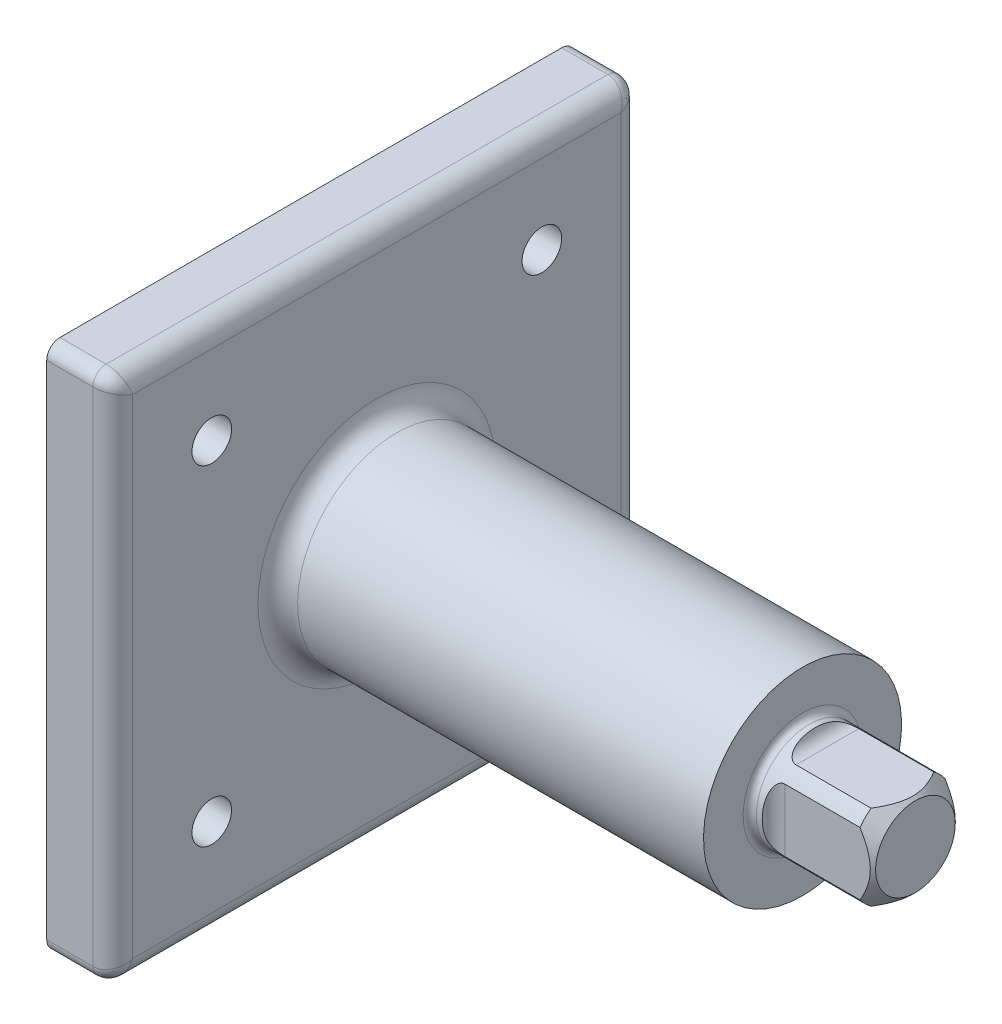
ISO-10303-21;
HEADER;
FILE_DESCRIPTION(('STEP AP214'),'2;1');
FILE_NAME('part.step','',(''),(''),'','','');
FILE_SCHEMA(('AUTOMOTIVE_DESIGN { 1 0 10303 214 1 1 1 1 }'));
ENDSEC;
DATA;
#1=APPLICATION_CONTEXT('core data for automotive mechanical design processes');
#2=APPLICATION_PROTOCOL_DEFINITION('international standard','automotive_design',2000,#1);
#3=PRODUCT_CONTEXT('',#1,'mechanical');
#4=PRODUCT('Part','Part','',(#3));
#5=PRODUCT_RELATED_PRODUCT_CATEGORY('part','',(#4));
#6=PRODUCT_DEFINITION_FORMATION('','',#4);
#7=PRODUCT_DEFINITION_CONTEXT('part definition',#1,'design');
#8=PRODUCT_DEFINITION('design','',#6,#7);
#9=PRODUCT_DEFINITION_SHAPE('','',#8);
#10=(LENGTH_UNIT() NAMED_UNIT(*) SI_UNIT(.MILLI.,.METRE.));
#11=(NAMED_UNIT(*) PLANE_ANGLE_UNIT() SI_UNIT($,.RADIAN.));
#12=(NAMED_UNIT(*) SI_UNIT($,.STERADIAN.) SOLID_ANGLE_UNIT());
#13=UNCERTAINTY_MEASURE_WITH_UNIT(LENGTH_MEASURE(1.E-05),#10,'distance_accuracy_value','');
#14=(GEOMETRIC_REPRESENTATION_CONTEXT(3) GLOBAL_UNCERTAINTY_ASSIGNED_CONTEXT((#13)) GLOBAL_UNIT_ASSIGNED_CONTEXT((#10,
#11,#12)) REPRESENTATION_CONTEXT('',''));
#15=CARTESIAN_POINT('',(0.,0.,0.));
#16=DIRECTION('',(0.,0.,1.));
#17=DIRECTION('',(1.,0.,0.));
#18=AXIS2_PLACEMENT_3D('',#15,#16,#17);
#19=CARTESIAN_POINT('',(-31.75,0.,0.));
#20=DIRECTION('',(-1.,0.,0.));
#21=DIRECTION('',(0.,-1.,0.));
#22=AXIS2_PLACEMENT_3D('',#19,#20,#21);
#23=CYLINDRICAL_SURFACE('',#22,8.);
#24=CARTESIAN_POINT('',(15.65,0.,0.));
#25=DIRECTION('',(-1.,0.,0.));
#26=DIRECTION('',(0.,-1.,0.));
#27=AXIS2_PLACEMENT_3D('',#24,#25,#26);
#28=CIRCLE('',#27,8.);
#29=CARTESIAN_POINT('',(15.65,-7.99999999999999,0.));
#30=VERTEX_POINT('',#29);
#31=EDGE_CURVE('E12',#30,#30,#28,.F.);
#32=ORIENTED_EDGE('',*,*,#31,.T.);
#33=EDGE_LOOP('',(#32));
#34=FACE_BOUND('',#33,.T.);
#35=CARTESIAN_POINT('',(29.7825,0.,0.));
#36=DIRECTION('',(-1.,0.,0.));
#37=DIRECTION('',(0.,0.,1.));
#38=AXIS2_PLACEMENT_3D('',#35,#36,#37);
#39=CIRCLE('',#38,8.);
#40=CARTESIAN_POINT('',(29.7825,-4.75297538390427,6.435));
#41=VERTEX_POINT('',#40);
#42=CARTESIAN_POINT('',(29.7825,-6.435,4.75297538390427));
#43=VERTEX_POINT('',#42);
#44=EDGE_CURVE('E202',#41,#43,#39,.F.);
#45=ORIENTED_EDGE('',*,*,#44,.F.);
#46=DIRECTION('',(-1.,0.,0.));
#47=VECTOR('',#46,1.);
#48=CARTESIAN_POINT('',(-31.75,-4.75297538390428,6.435));
#49=LINE('',#48,#47);
#50=CARTESIAN_POINT('',(18.415,-4.75297538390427,6.435));
#51=VERTEX_POINT('',#50);
#52=EDGE_CURVE('E929',#51,#41,#49,.F.);
#53=ORIENTED_EDGE('',*,*,#52,.F.);
#54=CARTESIAN_POINT('',(18.415,-4.75297538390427,6.435));
#55=CARTESIAN_POINT('',(18.3776572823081,-4.75298518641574,6.43498952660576));
#56=CARTESIAN_POINT('',(18.3403222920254,-4.75148917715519,6.43609766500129));
#57=CARTESIAN_POINT('',(18.2660444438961,-4.74556160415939,6.44047122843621));
#58=CARTESIAN_POINT('',(18.2291012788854,-4.7411325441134,6.44373481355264));
#59=CARTESIAN_POINT('',(18.1562672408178,-4.7294704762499,6.45229862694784));
#60=CARTESIAN_POINT('',(18.1203696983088,-4.72226456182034,6.457579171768));
#61=CARTESIAN_POINT('',(18.0495582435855,-4.70518528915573,6.47003427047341));
#62=CARTESIAN_POINT('',(18.0146444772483,-4.69531153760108,6.47720910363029));
#63=CARTESIAN_POINT('',(17.911977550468,-4.661991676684,6.50127552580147));
#64=CARTESIAN_POINT('',(17.8460002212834,-4.63479738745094,6.52074624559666));
#65=CARTESIAN_POINT('',(17.7201120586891,-4.57190380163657,6.56499611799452));
#66=CARTESIAN_POINT('',(17.660216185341,-4.53618422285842,6.58978791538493));
#67=CARTESIAN_POINT('',(17.524163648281,-4.44194098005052,6.65383749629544));
#68=CARTESIAN_POINT('',(17.4512053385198,-4.38003291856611,6.69489454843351));
#69=CARTESIAN_POINT('',(17.3178536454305,-4.24609409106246,6.78063634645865));
#70=CARTESIAN_POINT('',(17.257484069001,-4.17404456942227,6.82532774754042));
#71=CARTESIAN_POINT('',(17.159601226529,-4.03866990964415,6.90608366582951));
#72=CARTESIAN_POINT('',(17.1199566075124,-3.97674079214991,6.94196497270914));
#73=CARTESIAN_POINT('',(17.0467866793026,-3.84920126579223,7.01348668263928));
#74=CARTESIAN_POINT('',(17.0132650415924,-3.78358867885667,7.04912692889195));
#75=CARTESIAN_POINT('',(16.9515358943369,-3.64934761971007,7.11955183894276));
#76=CARTESIAN_POINT('',(16.9233365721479,-3.58071469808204,7.15433511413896));
#77=CARTESIAN_POINT('',(16.8715769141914,-3.4410548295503,7.22254746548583));
#78=CARTESIAN_POINT('',(16.8480183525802,-3.37002697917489,7.25597601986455));
#79=CARTESIAN_POINT('',(16.7876026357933,-3.16833106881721,7.347237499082));
#80=CARTESIAN_POINT('',(16.755206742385,-3.0354588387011,7.40317263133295));
#81=CARTESIAN_POINT('',(16.7000981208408,-2.76511577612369,7.50834420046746));
#82=CARTESIAN_POINT('',(16.6773931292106,-2.62764136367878,7.55757526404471));
#83=CARTESIAN_POINT('',(16.6391554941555,-2.34911535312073,7.64873568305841));
#84=CARTESIAN_POINT('',(16.6236333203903,-2.20805884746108,7.69065432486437));
#85=CARTESIAN_POINT('',(16.5978571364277,-1.92339220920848,7.76674235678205));
#86=CARTESIAN_POINT('',(16.5876043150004,-1.77978150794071,7.80090999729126));
#87=CARTESIAN_POINT('',(16.5681604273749,-1.44401851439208,7.87101959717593));
#88=CARTESIAN_POINT('',(16.5603796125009,-1.25115646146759,7.90397622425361));
#89=CARTESIAN_POINT('',(16.548983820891,-0.863387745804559,7.95568022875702));
#90=CARTESIAN_POINT('',(16.5453699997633,-0.668480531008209,7.97442366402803));
#91=CARTESIAN_POINT('',(16.5409889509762,-0.277531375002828,7.99758502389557));
#92=CARTESIAN_POINT('',(16.5402254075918,-0.0814882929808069,8.00198440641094));
#93=CARTESIAN_POINT('',(16.5412453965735,0.310351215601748,7.99637868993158));
#94=CARTESIAN_POINT('',(16.5430285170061,0.506147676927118,7.9863759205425));
#95=CARTESIAN_POINT('',(16.5499273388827,0.901326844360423,7.95159882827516));
#96=CARTESIAN_POINT('',(16.5551254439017,1.10067644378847,7.92646057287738));
#97=CARTESIAN_POINT('',(16.5708247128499,1.49682871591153,7.86128679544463));
#98=CARTESIAN_POINT('',(16.5813286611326,1.69362999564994,7.82124345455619));
#99=CARTESIAN_POINT('',(16.6106982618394,2.08225816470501,7.72683263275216));
#100=CARTESIAN_POINT('',(16.6295247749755,2.27410394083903,7.67253267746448));
#101=CARTESIAN_POINT('',(16.6674464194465,2.55714528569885,7.58095340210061));
#102=CARTESIAN_POINT('',(16.6816917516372,2.65066216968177,7.54875605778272));
#103=CARTESIAN_POINT('',(16.7141652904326,2.83582010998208,7.48116450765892));
#104=CARTESIAN_POINT('',(16.7323922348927,2.9274617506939,7.44577131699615));
#105=CARTESIAN_POINT('',(16.7663432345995,3.07622762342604,7.38517338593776));
#106=CARTESIAN_POINT('',(16.7806486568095,3.13402678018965,7.36082664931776));
#107=CARTESIAN_POINT('',(16.8115393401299,3.24851728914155,7.31102160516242));
#108=CARTESIAN_POINT('',(16.8281244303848,3.30520872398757,7.28556338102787));
#109=CARTESIAN_POINT('',(16.8817627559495,3.47346056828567,7.20765658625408));
#110=CARTESIAN_POINT('',(16.9226884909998,3.58314990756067,7.1536957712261));
#111=CARTESIAN_POINT('',(17.0179099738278,3.79638932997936,7.0428672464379));
#112=CARTESIAN_POINT('',(17.0723089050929,3.89988399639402,6.98597992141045));
#113=CARTESIAN_POINT('',(17.1974992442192,4.09669012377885,6.87240392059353));
#114=CARTESIAN_POINT('',(17.2682607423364,4.19001971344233,6.81571507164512));
#115=CARTESIAN_POINT('',(17.4015472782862,4.33239347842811,6.72568894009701));
#116=CARTESIAN_POINT('',(17.4586137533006,4.38566760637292,6.69099554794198));
#117=CARTESIAN_POINT('',(17.5815791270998,4.4838915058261,6.62557012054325));
#118=CARTESIAN_POINT('',(17.6474689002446,4.52884976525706,6.59483405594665));
#119=CARTESIAN_POINT('',(17.7769235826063,4.60205879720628,6.54390860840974));
#120=CARTESIAN_POINT('',(17.8392755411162,4.63181760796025,6.52282347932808));
#121=CARTESIAN_POINT('',(17.9691347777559,4.68228459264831,6.48669227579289));
#122=CARTESIAN_POINT('',(18.0366317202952,4.70301037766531,6.47163445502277));
#123=CARTESIAN_POINT('',(18.1560528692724,4.72989844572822,6.451997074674));
#124=CARTESIAN_POINT('',(18.2071517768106,4.73849879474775,6.44567440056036));
#125=CARTESIAN_POINT('',(18.3104804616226,4.75006175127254,6.4371520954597));
#126=CARTESIAN_POINT('',(18.3627132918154,4.75300653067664,6.4349655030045));
#127=CARTESIAN_POINT('',(18.415,4.75297538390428,6.435));
#128=B_SPLINE_CURVE_WITH_KNOTS('',3,(#54,#55,#56,#57,#58,#59,#60,#61,#62,#63,#64,#65,#66,#67,
#68,#69,#70,#71,#72,#73,#74,#75,#76,#77,#78,#79,#80,#81,#82,#83,#84,#85,#86,#87,#88,#89,#90,#91,
#92,#93,#94,#95,#96,#97,#98,#99,#100,#101,#102,#103,#104,#105,#106,#107,#108,#109,#110,#111,
#112,#113,#114,#115,#116,#117,#118,#119,#120,#121,#122,#123,#124,#125,#126,#127),.UNSPECIFIED.,
.F.,.F.,(4,2,2,2,2,2,2,2,2,2,2,2,2,2,2,2,2,2,2,2,2,2,2,2,2,2,2,2,2,2,2,2,2,2,2,2,4),(0.,
0.111969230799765,0.22384300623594,0.33465180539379,0.445476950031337,0.666225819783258,
0.887505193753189,1.19812458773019,1.50932617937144,1.75444768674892,1.99971569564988,
2.24535798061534,2.49109399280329,2.93364684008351,3.37655233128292,3.82010138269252,
4.26375045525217,4.85056175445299,5.43753575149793,6.02526821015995,6.6129056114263,
7.21527081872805,7.81795245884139,8.41782947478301,8.71748971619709,9.01705510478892,
9.20998518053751,9.40290080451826,9.7888921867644,10.1779363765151,10.5662749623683,
10.8218125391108,11.0770878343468,11.2929324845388,11.5083544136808,11.6645018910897,
11.8211407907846),.UNSPECIFIED.);
#129=CARTESIAN_POINT('',(18.415,4.75297538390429,6.435));
#130=VERTEX_POINT('',#129);
#131=EDGE_CURVE('E302',#51,#130,#128,.T.);
#132=ORIENTED_EDGE('',*,*,#131,.T.);
#133=DIRECTION('',(-1.,0.,0.));
#134=VECTOR('',#133,1.);
#135=CARTESIAN_POINT('',(-31.75,4.75297538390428,6.435));
#136=LINE('',#135,#134);
#137=CARTESIAN_POINT('',(29.7825,4.75297538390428,6.435));
#138=VERTEX_POINT('',#137);
#139=EDGE_CURVE('E926',#138,#130,#136,.T.);
#140=ORIENTED_EDGE('',*,*,#139,.F.);
#141=CARTESIAN_POINT('',(29.7825,6.435,4.75297538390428));
#142=VERTEX_POINT('',#141);
#143=EDGE_CURVE('E204',#142,#138,#39,.F.);
#144=ORIENTED_EDGE('',*,*,#143,.F.);
#145=DIRECTION('',(-1.,0.,0.));
#146=VECTOR('',#145,1.);
#147=CARTESIAN_POINT('',(-31.75,6.435,4.75297538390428));
#148=LINE('',#147,#146);
#149=CARTESIAN_POINT('',(18.415,6.435,4.75297538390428));
#150=VERTEX_POINT('',#149);
#151=EDGE_CURVE('E213',#150,#142,#148,.F.);
#152=ORIENTED_EDGE('',*,*,#151,.F.);
#153=CARTESIAN_POINT('',(18.415,6.435,4.75297538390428));
#154=CARTESIAN_POINT('',(18.3776572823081,6.43498952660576,4.75298518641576));
#155=CARTESIAN_POINT('',(18.3403222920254,6.43609766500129,4.75148917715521));
#156=CARTESIAN_POINT('',(18.2660444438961,6.44047122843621,4.74556160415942));
#157=CARTESIAN_POINT('',(18.2291012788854,6.44373481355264,4.74113254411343));
#158=CARTESIAN_POINT('',(18.1562672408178,6.45229862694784,4.72947047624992));
#159=CARTESIAN_POINT('',(18.1203696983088,6.457579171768,4.72226456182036));
#160=CARTESIAN_POINT('',(18.0495582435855,6.47003427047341,4.70518528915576));
#161=CARTESIAN_POINT('',(18.0146444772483,6.47720910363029,4.69531153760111));
#162=CARTESIAN_POINT('',(17.911977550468,6.50127552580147,4.66199167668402));
#163=CARTESIAN_POINT('',(17.8460002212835,6.52074624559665,4.63479738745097));
#164=CARTESIAN_POINT('',(17.7201120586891,6.56499611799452,4.5719038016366));
#165=CARTESIAN_POINT('',(17.660216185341,6.58978791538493,4.53618422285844));
#166=CARTESIAN_POINT('',(17.524163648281,6.65383749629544,4.44194098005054));
#167=CARTESIAN_POINT('',(17.4512053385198,6.69489454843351,4.38003291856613));
#168=CARTESIAN_POINT('',(17.3178536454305,6.78063634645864,4.24609409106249));
#169=CARTESIAN_POINT('',(17.257484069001,6.82532774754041,4.1740445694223));
#170=CARTESIAN_POINT('',(17.159601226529,6.90608366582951,4.03866990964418));
#171=CARTESIAN_POINT('',(17.1199566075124,6.94196497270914,3.97674079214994));
#172=CARTESIAN_POINT('',(17.0467866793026,7.01348668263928,3.84920126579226));
#173=CARTESIAN_POINT('',(17.0132650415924,7.04912692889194,3.7835886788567));
#174=CARTESIAN_POINT('',(16.9515358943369,7.11955183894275,3.64934761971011));
#175=CARTESIAN_POINT('',(16.9233365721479,7.15433511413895,3.58071469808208));
#176=CARTESIAN_POINT('',(16.8715769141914,7.22254746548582,3.44105482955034));
#177=CARTESIAN_POINT('',(16.8480183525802,7.25597601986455,3.37002697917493));
#178=CARTESIAN_POINT('',(16.7876026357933,7.347237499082,3.16833106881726));
#179=CARTESIAN_POINT('',(16.755206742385,7.40317263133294,3.03545883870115));
#180=CARTESIAN_POINT('',(16.7000981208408,7.50834420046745,2.76511577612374));
#181=CARTESIAN_POINT('',(16.6773931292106,7.55757526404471,2.62764136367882));
#182=CARTESIAN_POINT('',(16.6391554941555,7.64873568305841,2.34911535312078));
#183=CARTESIAN_POINT('',(16.6236333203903,7.69065432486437,2.20805884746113));
#184=CARTESIAN_POINT('',(16.5978571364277,7.76674235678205,1.92339220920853));
#185=CARTESIAN_POINT('',(16.5876043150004,7.80090999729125,1.77978150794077));
#186=CARTESIAN_POINT('',(16.5681604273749,7.87101959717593,1.44401851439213));
#187=CARTESIAN_POINT('',(16.5603796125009,7.90397622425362,1.25115646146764));
#188=CARTESIAN_POINT('',(16.548983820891,7.95568022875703,0.863387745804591));
#189=CARTESIAN_POINT('',(16.5453699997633,7.97442366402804,0.668480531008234));
#190=CARTESIAN_POINT('',(16.5409889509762,7.99758502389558,0.277531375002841));
#191=CARTESIAN_POINT('',(16.5402254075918,8.00198440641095,0.081488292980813));
#192=CARTESIAN_POINT('',(16.5412453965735,7.99637868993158,-0.310351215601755));
#193=CARTESIAN_POINT('',(16.5430285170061,7.98637592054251,-0.506147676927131));
#194=CARTESIAN_POINT('',(16.5499273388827,7.95159882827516,-0.901326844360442));
#195=CARTESIAN_POINT('',(16.5551254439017,7.92646057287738,-1.10067644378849));
#196=CARTESIAN_POINT('',(16.5708247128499,7.86128679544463,-1.49682871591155));
#197=CARTESIAN_POINT('',(16.5813286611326,7.82124345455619,-1.69362999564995));
#198=CARTESIAN_POINT('',(16.6106982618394,7.72683263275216,-2.08225816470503));
#199=CARTESIAN_POINT('',(16.6295247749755,7.67253267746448,-2.27410394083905));
#200=CARTESIAN_POINT('',(16.6674464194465,7.58095340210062,-2.55714528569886));
#201=CARTESIAN_POINT('',(16.6816917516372,7.54875605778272,-2.65066216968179));
#202=CARTESIAN_POINT('',(16.7141652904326,7.48116450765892,-2.83582010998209));
#203=CARTESIAN_POINT('',(16.7323922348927,7.44577131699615,-2.92746175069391));
#204=CARTESIAN_POINT('',(16.7663432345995,7.38517338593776,-3.07622762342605));
#205=CARTESIAN_POINT('',(16.7806486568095,7.36082664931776,-3.13402678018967));
#206=CARTESIAN_POINT('',(16.8115393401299,7.31102160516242,-3.24851728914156));
#207=CARTESIAN_POINT('',(16.8281244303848,7.28556338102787,-3.30520872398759));
#208=CARTESIAN_POINT('',(16.8817627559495,7.20765658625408,-3.47346056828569));
#209=CARTESIAN_POINT('',(16.9226884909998,7.1536957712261,-3.58314990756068));
#210=CARTESIAN_POINT('',(17.0179099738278,7.04286724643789,-3.79638932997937));
#211=CARTESIAN_POINT('',(17.0723089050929,6.98597992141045,-3.89988399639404));
#212=CARTESIAN_POINT('',(17.1974992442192,6.87240392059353,-4.09669012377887));
#213=CARTESIAN_POINT('',(17.2682607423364,6.81571507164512,-4.19001971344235));
#214=CARTESIAN_POINT('',(17.4015472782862,6.725688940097,-4.33239347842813));
#215=CARTESIAN_POINT('',(17.4586137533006,6.69099554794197,-4.38566760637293));
#216=CARTESIAN_POINT('',(17.5815791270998,6.62557012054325,-4.48389150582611));
#217=CARTESIAN_POINT('',(17.6474689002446,6.59483405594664,-4.52884976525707));
#218=CARTESIAN_POINT('',(17.7769235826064,6.54390860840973,-4.60205879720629));
#219=CARTESIAN_POINT('',(17.8392755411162,6.52282347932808,-4.63181760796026));
#220=CARTESIAN_POINT('',(17.9691347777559,6.48669227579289,-4.68228459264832));
#221=CARTESIAN_POINT('',(18.0366317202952,6.47163445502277,-4.70301037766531));
#222=CARTESIAN_POINT('',(18.1560528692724,6.451997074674,-4.72989844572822));
#223=CARTESIAN_POINT('',(18.2071517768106,6.44567440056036,-4.73849879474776));
#224=CARTESIAN_POINT('',(18.3104804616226,6.4371520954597,-4.75006175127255));
#225=CARTESIAN_POINT('',(18.3627132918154,6.4349655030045,-4.75300653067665));
#226=CARTESIAN_POINT('',(18.415,6.435,-4.75297538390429));
#227=B_SPLINE_CURVE_WITH_KNOTS('',3,(#153,#154,#155,#156,#157,#158,#159,#160,#161,#162,#163,
#164,#165,#166,#167,#168,#169,#170,#171,#172,#173,#174,#175,#176,#177,#178,#179,#180,#181,#182,
#183,#184,#185,#186,#187,#188,#189,#190,#191,#192,#193,#194,#195,#196,#197,#198,#199,#200,#201,
#202,#203,#204,#205,#206,#207,#208,#209,#210,#211,#212,#213,#214,#215,#216,#217,#218,#219,#220,
#221,#222,#223,#224,#225,#226),.UNSPECIFIED.,.F.,.F.,(4,2,2,2,2,2,2,2,2,2,2,2,2,2,2,2,2,2,2,2,2,
2,2,2,2,2,2,2,2,2,2,2,2,2,2,2,4),(0.,0.111969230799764,0.22384300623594,0.33465180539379,
0.445476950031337,0.66622581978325,0.887505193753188,1.19812458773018,1.50932617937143,
1.75444768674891,1.99971569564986,2.24535798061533,2.49109399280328,2.93364684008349,
3.3765523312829,3.82010138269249,4.26375045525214,4.85056175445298,5.43753575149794,
6.02526821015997,6.61290561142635,7.2152708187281,7.81795245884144,8.41782947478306,
8.71748971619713,9.01705510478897,9.20998518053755,9.4029008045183,9.78889218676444,
10.1779363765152,10.5662749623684,10.8218125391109,11.0770878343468,11.2929324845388,
11.5083544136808,11.6645018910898,11.8211407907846),.UNSPECIFIED.);
#228=CARTESIAN_POINT('',(18.415,6.43500000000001,-4.75297538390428));
#229=VERTEX_POINT('',#228);
#230=EDGE_CURVE('E308',#150,#229,#227,.T.);
#231=ORIENTED_EDGE('',*,*,#230,.T.);
#232=DIRECTION('',(-1.,0.,0.));
#233=VECTOR('',#232,1.);
#234=CARTESIAN_POINT('',(-31.75,6.435,-4.75297538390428));
#235=LINE('',#234,#233);
#236=CARTESIAN_POINT('',(29.7825,6.435,-4.75297538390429));
#237=VERTEX_POINT('',#236);
#238=EDGE_CURVE('E199',#237,#229,#235,.T.);
#239=ORIENTED_EDGE('',*,*,#238,.F.);
#240=CARTESIAN_POINT('',(29.7825,4.75297538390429,-6.435));
#241=VERTEX_POINT('',#240);
#242=EDGE_CURVE('E189',#241,#237,#39,.F.);
#243=ORIENTED_EDGE('',*,*,#242,.F.);
#244=DIRECTION('',(-1.,0.,0.));
#245=VECTOR('',#244,1.);
#246=CARTESIAN_POINT('',(-31.75,4.75297538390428,-6.435));
#247=LINE('',#246,#245);
#248=CARTESIAN_POINT('',(18.415,4.75297538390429,-6.435));
#249=VERTEX_POINT('',#248);
#250=EDGE_CURVE('E172',#249,#241,#247,.F.);
#251=ORIENTED_EDGE('',*,*,#250,.F.);
#252=CARTESIAN_POINT('',(18.415,4.75297538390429,-6.435));
#253=CARTESIAN_POINT('',(18.3776572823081,4.75298518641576,-6.43498952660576));
#254=CARTESIAN_POINT('',(18.3403222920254,4.75148917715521,-6.43609766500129));
#255=CARTESIAN_POINT('',(18.2660444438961,4.74556160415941,-6.44047122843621));
#256=CARTESIAN_POINT('',(18.2291012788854,4.74113254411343,-6.44373481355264));
#257=CARTESIAN_POINT('',(18.1562672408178,4.72947047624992,-6.45229862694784));
#258=CARTESIAN_POINT('',(18.1203696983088,4.72226456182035,-6.457579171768));
#259=CARTESIAN_POINT('',(18.0495582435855,4.70518528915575,-6.47003427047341));
#260=CARTESIAN_POINT('',(18.0146444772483,4.6953115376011,-6.47720910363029));
#261=CARTESIAN_POINT('',(17.911977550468,4.66199167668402,-6.50127552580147));
#262=CARTESIAN_POINT('',(17.8460002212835,4.63479738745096,-6.52074624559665));
#263=CARTESIAN_POINT('',(17.7201120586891,4.57190380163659,-6.56499611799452));
#264=CARTESIAN_POINT('',(17.660216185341,4.53618422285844,-6.58978791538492));
#265=CARTESIAN_POINT('',(17.524163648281,4.44194098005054,-6.65383749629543));
#266=CARTESIAN_POINT('',(17.4512053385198,4.38003291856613,-6.69489454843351));
#267=CARTESIAN_POINT('',(17.3178536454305,4.24609409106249,-6.78063634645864));
#268=CARTESIAN_POINT('',(17.257484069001,4.1740445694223,-6.82532774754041));
#269=CARTESIAN_POINT('',(17.159601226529,4.03866990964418,-6.9060836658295));
#270=CARTESIAN_POINT('',(17.1199566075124,3.97674079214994,-6.94196497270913));
#271=CARTESIAN_POINT('',(17.0467866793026,3.84920126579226,-7.01348668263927));
#272=CARTESIAN_POINT('',(17.0132650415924,3.78358867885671,-7.04912692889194));
#273=CARTESIAN_POINT('',(16.9515358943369,3.64934761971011,-7.11955183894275));
#274=CARTESIAN_POINT('',(16.9233365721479,3.58071469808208,-7.15433511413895));
#275=CARTESIAN_POINT('',(16.8715769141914,3.44105482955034,-7.22254746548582));
#276=CARTESIAN_POINT('',(16.8480183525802,3.37002697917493,-7.25597601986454));
#277=CARTESIAN_POINT('',(16.7876026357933,3.16833106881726,-7.34723749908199));
#278=CARTESIAN_POINT('',(16.755206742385,3.03545883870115,-7.40317263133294));
#279=CARTESIAN_POINT('',(16.7000981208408,2.76511577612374,-7.50834420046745));
#280=CARTESIAN_POINT('',(16.6773931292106,2.62764136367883,-7.5575752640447));
#281=CARTESIAN_POINT('',(16.6391554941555,2.34911535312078,-7.6487356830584));
#282=CARTESIAN_POINT('',(16.6236333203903,2.20805884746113,-7.69065432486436));
#283=CARTESIAN_POINT('',(16.5978571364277,1.92339220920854,-7.76674235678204));
#284=CARTESIAN_POINT('',(16.5876043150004,1.77978150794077,-7.80090999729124));
#285=CARTESIAN_POINT('',(16.5681604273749,1.44401851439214,-7.87101959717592));
#286=CARTESIAN_POINT('',(16.5603796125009,1.25115646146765,-7.90397622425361));
#287=CARTESIAN_POINT('',(16.548983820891,0.863387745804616,-7.95568022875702));
#288=CARTESIAN_POINT('',(16.5453699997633,0.668480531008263,-7.97442366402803));
#289=CARTESIAN_POINT('',(16.5409889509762,0.277531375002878,-7.99758502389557));
#290=CARTESIAN_POINT('',(16.5402254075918,0.0814882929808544,-8.00198440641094));
#291=CARTESIAN_POINT('',(16.5412453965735,-0.310351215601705,-7.99637868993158));
#292=CARTESIAN_POINT('',(16.5430285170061,-0.506147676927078,-7.98637592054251));
#293=CARTESIAN_POINT('',(16.5499273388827,-0.901326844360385,-7.95159882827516));
#294=CARTESIAN_POINT('',(16.5551254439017,-1.10067644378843,-7.92646057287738));
#295=CARTESIAN_POINT('',(16.5708247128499,-1.49682871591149,-7.86128679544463));
#296=CARTESIAN_POINT('',(16.5813286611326,-1.6936299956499,-7.82124345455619));
#297=CARTESIAN_POINT('',(16.6106982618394,-2.08225816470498,-7.72683263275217));
#298=CARTESIAN_POINT('',(16.6295247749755,-2.274103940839,-7.67253267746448));
#299=CARTESIAN_POINT('',(16.6674464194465,-2.55714528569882,-7.58095340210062));
#300=CARTESIAN_POINT('',(16.6816917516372,-2.65066216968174,-7.54875605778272));
#301=CARTESIAN_POINT('',(16.7141652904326,-2.83582010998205,-7.48116450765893));
#302=CARTESIAN_POINT('',(16.7323922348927,-2.92746175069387,-7.44577131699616));
#303=CARTESIAN_POINT('',(16.7663432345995,-3.07622762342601,-7.38517338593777));
#304=CARTESIAN_POINT('',(16.7806486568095,-3.13402678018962,-7.36082664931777));
#305=CARTESIAN_POINT('',(16.8115393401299,-3.24851728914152,-7.31102160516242));
#306=CARTESIAN_POINT('',(16.8281244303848,-3.30520872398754,-7.28556338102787));
#307=CARTESIAN_POINT('',(16.8817627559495,-3.47346056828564,-7.20765658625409));
#308=CARTESIAN_POINT('',(16.9226884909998,-3.58314990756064,-7.15369577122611));
#309=CARTESIAN_POINT('',(17.0179099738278,-3.79638932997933,-7.0428672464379));
#310=CARTESIAN_POINT('',(17.0723089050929,-3.899883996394,-6.98597992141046));
#311=CARTESIAN_POINT('',(17.1974992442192,-4.09669012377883,-6.87240392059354));
#312=CARTESIAN_POINT('',(17.2682607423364,-4.19001971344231,-6.81571507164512));
#313=CARTESIAN_POINT('',(17.4015472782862,-4.33239347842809,-6.72568894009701));
#314=CARTESIAN_POINT('',(17.4586137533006,-4.3856676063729,-6.69099554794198));
#315=CARTESIAN_POINT('',(17.5815791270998,-4.48389150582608,-6.62557012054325));
#316=CARTESIAN_POINT('',(17.6474689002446,-4.52884976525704,-6.59483405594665));
#317=CARTESIAN_POINT('',(17.7769235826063,-4.60205879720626,-6.54390860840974));
#318=CARTESIAN_POINT('',(17.8392755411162,-4.63181760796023,-6.52282347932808));
#319=CARTESIAN_POINT('',(17.9691347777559,-4.68228459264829,-6.48669227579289));
#320=CARTESIAN_POINT('',(18.0366317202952,-4.70301037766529,-6.47163445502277));
#321=CARTESIAN_POINT('',(18.1560528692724,-4.7298984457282,-6.451997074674));
#322=CARTESIAN_POINT('',(18.2071517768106,-4.73849879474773,-6.44567440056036));
#323=CARTESIAN_POINT('',(18.3104804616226,-4.75006175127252,-6.4371520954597));
#324=CARTESIAN_POINT('',(18.3627132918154,-4.75300653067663,-6.4349655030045));
#325=CARTESIAN_POINT('',(18.415,-4.75297538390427,-6.435));
#326=B_SPLINE_CURVE_WITH_KNOTS('',3,(#252,#253,#254,#255,#256,#257,#258,#259,#260,#261,#262,
#263,#264,#265,#266,#267,#268,#269,#270,#271,#272,#273,#274,#275,#276,#277,#278,#279,#280,#281,
#282,#283,#284,#285,#286,#287,#288,#289,#290,#291,#292,#293,#294,#295,#296,#297,#298,#299,#300,
#301,#302,#303,#304,#305,#306,#307,#308,#309,#310,#311,#312,#313,#314,#315,#316,#317,#318,#319,
#320,#321,#322,#323,#324,#325),.UNSPECIFIED.,.F.,.F.,(4,2,2,2,2,2,2,2,2,2,2,2,2,2,2,2,2,2,2,2,2,
2,2,2,2,2,2,2,2,2,2,2,2,2,2,2,4),(0.,0.111969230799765,0.22384300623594,0.334651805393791,
0.445476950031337,0.66622581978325,0.887505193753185,1.19812458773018,1.50932617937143,
1.75444768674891,1.99971569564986,2.24535798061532,2.49109399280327,2.93364684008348,
3.37655233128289,3.82010138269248,4.26375045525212,4.85056175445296,5.4375357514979,
6.02526821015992,6.61290561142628,7.21527081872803,7.81795245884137,8.417829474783,
8.71748971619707,9.01705510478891,9.2099851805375,9.40290080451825,9.78889218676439,
10.1779363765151,10.5662749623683,10.8218125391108,11.0770878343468,11.2929324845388,
11.5083544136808,11.6645018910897,11.8211407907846),.UNSPECIFIED.);
#327=CARTESIAN_POINT('',(18.415,-4.75297538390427,-6.435));
#328=VERTEX_POINT('',#327);
#329=EDGE_CURVE('E268',#249,#328,#326,.T.);
#330=ORIENTED_EDGE('',*,*,#329,.T.);
#331=DIRECTION('',(-1.,0.,0.));
#332=VECTOR('',#331,1.);
#333=CARTESIAN_POINT('',(-31.75,-4.75297538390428,-6.435));
#334=LINE('',#333,#332);
#335=CARTESIAN_POINT('',(29.7825,-4.75297538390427,-6.435));
#336=VERTEX_POINT('',#335);
#337=EDGE_CURVE('E182',#336,#328,#334,.T.);
#338=ORIENTED_EDGE('',*,*,#337,.F.);
#339=CARTESIAN_POINT('',(29.7825,-6.435,-4.75297538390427));
#340=VERTEX_POINT('',#339);
#341=EDGE_CURVE('E193',#340,#336,#39,.F.);
#342=ORIENTED_EDGE('',*,*,#341,.F.);
#343=DIRECTION('',(-1.,0.,0.));
#344=VECTOR('',#343,1.);
#345=CARTESIAN_POINT('',(-31.75,-6.435,-4.75297538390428));
#346=LINE('',#345,#344);
#347=CARTESIAN_POINT('',(18.415,-6.435,-4.75297538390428));
#348=VERTEX_POINT('',#347);
#349=EDGE_CURVE('E924',#348,#340,#346,.F.);
#350=ORIENTED_EDGE('',*,*,#349,.F.);
#351=CARTESIAN_POINT('',(18.415,-6.435,-4.75297538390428));
#352=CARTESIAN_POINT('',(18.3776572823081,-6.43498952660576,-4.75298518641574));
#353=CARTESIAN_POINT('',(18.3403222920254,-6.43609766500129,-4.75148917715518));
#354=CARTESIAN_POINT('',(18.2660444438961,-6.44047122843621,-4.74556160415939));
#355=CARTESIAN_POINT('',(18.2291012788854,-6.44373481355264,-4.7411325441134));
#356=CARTESIAN_POINT('',(18.1562672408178,-6.45229862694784,-4.7294704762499));
#357=CARTESIAN_POINT('',(18.1203696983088,-6.457579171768,-4.72226456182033));
#358=CARTESIAN_POINT('',(18.0495582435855,-6.47003427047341,-4.70518528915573));
#359=CARTESIAN_POINT('',(18.0146444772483,-6.47720910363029,-4.69531153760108));
#360=CARTESIAN_POINT('',(17.911977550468,-6.50127552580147,-4.66199167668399));
#361=CARTESIAN_POINT('',(17.8460002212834,-6.52074624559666,-4.63479738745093));
#362=CARTESIAN_POINT('',(17.7201120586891,-6.56499611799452,-4.57190380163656));
#363=CARTESIAN_POINT('',(17.660216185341,-6.58978791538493,-4.53618422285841));
#364=CARTESIAN_POINT('',(17.524163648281,-6.65383749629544,-4.44194098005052));
#365=CARTESIAN_POINT('',(17.4512053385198,-6.69489454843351,-4.38003291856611));
#366=CARTESIAN_POINT('',(17.3178536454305,-6.78063634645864,-4.24609409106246));
#367=CARTESIAN_POINT('',(17.257484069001,-6.82532774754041,-4.17404456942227));
#368=CARTESIAN_POINT('',(17.159601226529,-6.90608366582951,-4.03866990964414));
#369=CARTESIAN_POINT('',(17.1199566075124,-6.94196497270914,-3.97674079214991));
#370=CARTESIAN_POINT('',(17.0467866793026,-7.01348668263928,-3.84920126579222));
#371=CARTESIAN_POINT('',(17.0132650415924,-7.04912692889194,-3.78358867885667));
#372=CARTESIAN_POINT('',(16.9515358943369,-7.11955183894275,-3.64934761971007));
#373=CARTESIAN_POINT('',(16.9233365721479,-7.15433511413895,-3.58071469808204));
#374=CARTESIAN_POINT('',(16.8715769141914,-7.22254746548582,-3.4410548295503));
#375=CARTESIAN_POINT('',(16.8480183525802,-7.25597601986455,-3.3700269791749));
#376=CARTESIAN_POINT('',(16.7876026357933,-7.347237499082,-3.16833106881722));
#377=CARTESIAN_POINT('',(16.755206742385,-7.40317263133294,-3.03545883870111));
#378=CARTESIAN_POINT('',(16.7000981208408,-7.50834420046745,-2.7651157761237));
#379=CARTESIAN_POINT('',(16.6773931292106,-7.55757526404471,-2.62764136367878));
#380=CARTESIAN_POINT('',(16.6391554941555,-7.6487356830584,-2.34911535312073));
#381=CARTESIAN_POINT('',(16.6236333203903,-7.69065432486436,-2.20805884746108));
#382=CARTESIAN_POINT('',(16.5978571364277,-7.76674235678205,-1.92339220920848));
#383=CARTESIAN_POINT('',(16.5876043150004,-7.80090999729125,-1.77978150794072));
#384=CARTESIAN_POINT('',(16.5681604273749,-7.87101959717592,-1.44401851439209));
#385=CARTESIAN_POINT('',(16.5603796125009,-7.9039762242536,-1.25115646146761));
#386=CARTESIAN_POINT('',(16.548983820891,-7.95568022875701,-0.863387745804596));
#387=CARTESIAN_POINT('',(16.5453699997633,-7.97442366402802,-0.668480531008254));
#388=CARTESIAN_POINT('',(16.5409889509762,-7.99758502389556,-0.277531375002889));
#389=CARTESIAN_POINT('',(16.5402254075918,-8.00198440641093,-0.0814882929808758));
#390=CARTESIAN_POINT('',(16.5412453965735,-7.99637868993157,0.310351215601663));
#391=CARTESIAN_POINT('',(16.5430285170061,-7.9863759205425,0.506147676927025));
#392=CARTESIAN_POINT('',(16.5499273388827,-7.95159882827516,0.901326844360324));
#393=CARTESIAN_POINT('',(16.5551254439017,-7.92646057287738,1.10067644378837));
#394=CARTESIAN_POINT('',(16.5708247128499,-7.86128679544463,1.49682871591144));
#395=CARTESIAN_POINT('',(16.5813286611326,-7.8212434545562,1.69362999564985));
#396=CARTESIAN_POINT('',(16.6106982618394,-7.72683263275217,2.08225816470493));
#397=CARTESIAN_POINT('',(16.6295247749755,-7.67253267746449,2.27410394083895));
#398=CARTESIAN_POINT('',(16.6674464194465,-7.58095340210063,2.55714528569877));
#399=CARTESIAN_POINT('',(16.6816917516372,-7.54875605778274,2.6506621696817));
#400=CARTESIAN_POINT('',(16.7141652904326,-7.48116450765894,2.83582010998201));
#401=CARTESIAN_POINT('',(16.7323922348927,-7.44577131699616,2.92746175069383));
#402=CARTESIAN_POINT('',(16.7663432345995,-7.38517338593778,3.07622762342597));
#403=CARTESIAN_POINT('',(16.7806486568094,-7.36082664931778,3.13402678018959));
#404=CARTESIAN_POINT('',(16.8115393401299,-7.31102160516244,3.24851728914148));
#405=CARTESIAN_POINT('',(16.8281244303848,-7.28556338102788,3.30520872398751));
#406=CARTESIAN_POINT('',(16.8817627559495,-7.2076565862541,3.47346056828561));
#407=CARTESIAN_POINT('',(16.9226884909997,-7.15369577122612,3.58314990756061));
#408=CARTESIAN_POINT('',(17.0179099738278,-7.04286724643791,3.7963893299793));
#409=CARTESIAN_POINT('',(17.0723089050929,-6.98597992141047,3.89988399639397));
#410=CARTESIAN_POINT('',(17.1974992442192,-6.87240392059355,4.09669012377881));
#411=CARTESIAN_POINT('',(17.2682607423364,-6.81571507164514,4.19001971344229));
#412=CARTESIAN_POINT('',(17.4015472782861,-6.72568894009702,4.33239347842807));
#413=CARTESIAN_POINT('',(17.4586137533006,-6.69099554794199,4.38566760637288));
#414=CARTESIAN_POINT('',(17.5815791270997,-6.62557012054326,4.48389150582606));
#415=CARTESIAN_POINT('',(17.6474689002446,-6.59483405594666,4.52884976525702));
#416=CARTESIAN_POINT('',(17.7769235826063,-6.54390860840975,4.60205879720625));
#417=CARTESIAN_POINT('',(17.8392755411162,-6.52282347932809,4.63181760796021));
#418=CARTESIAN_POINT('',(17.9691347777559,-6.48669227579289,4.68228459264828));
#419=CARTESIAN_POINT('',(18.0366317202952,-6.47163445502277,4.70301037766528));
#420=CARTESIAN_POINT('',(18.1560528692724,-6.451997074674,4.72989844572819));
#421=CARTESIAN_POINT('',(18.2071517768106,-6.44567440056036,4.73849879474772));
#422=CARTESIAN_POINT('',(18.3104804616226,-6.4371520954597,4.75006175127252));
#423=CARTESIAN_POINT('',(18.3627132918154,-6.4349655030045,4.75300653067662));
#424=CARTESIAN_POINT('',(18.415,-6.435,4.75297538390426));
#425=B_SPLINE_CURVE_WITH_KNOTS('',3,(#351,#352,#353,#354,#355,#356,#357,#358,#359,#360,#361,
#362,#363,#364,#365,#366,#367,#368,#369,#370,#371,#372,#373,#374,#375,#376,#377,#378,#379,#380,
#381,#382,#383,#384,#385,#386,#387,#388,#389,#390,#391,#392,#393,#394,#395,#396,#397,#398,#399,
#400,#401,#402,#403,#404,#405,#406,#407,#408,#409,#410,#411,#412,#413,#414,#415,#416,#417,#418,
#419,#420,#421,#422,#423,#424),.UNSPECIFIED.,.F.,.F.,(4,2,2,2,2,2,2,2,2,2,2,2,2,2,2,2,2,2,2,2,2,
2,2,2,2,2,2,2,2,2,2,2,2,2,2,2,4),(0.,0.111969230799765,0.223843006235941,0.334651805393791,
0.445476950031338,0.666225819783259,0.887505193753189,1.19812458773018,1.50932617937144,
1.75444768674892,1.99971569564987,2.24535798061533,2.49109399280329,2.9336468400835,
3.37655233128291,3.8201013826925,4.26375045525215,4.85056175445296,5.43753575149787,
6.02526821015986,6.61290561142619,7.21527081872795,7.81795245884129,8.41782947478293,
8.717489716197,9.01705510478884,9.20998518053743,9.40290080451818,9.78889218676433,
10.177936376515,10.5662749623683,10.8218125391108,11.0770878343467,11.2929324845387,
11.5083544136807,11.6645018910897,11.8211407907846),.UNSPECIFIED.);
#426=CARTESIAN_POINT('',(18.415,-6.43499999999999,4.75297538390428));
#427=VERTEX_POINT('',#426);
#428=EDGE_CURVE('E275',#348,#427,#425,.T.);
#429=ORIENTED_EDGE('',*,*,#428,.T.);
#430=DIRECTION('',(-1.,0.,0.));
#431=VECTOR('',#430,1.);
#432=CARTESIAN_POINT('',(-31.75,-6.435,4.75297538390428));
#433=LINE('',#432,#431);
#434=EDGE_CURVE('E183',#43,#427,#433,.T.);
#435=ORIENTED_EDGE('',*,*,#434,.F.);
#436=EDGE_LOOP('',(#45,#53,#132,#140,#144,#152,#231,#239,#243,#251,#330,#338,#342,#350,#429,#435));
#437=FACE_BOUND('',#436,.T.);
#438=ADVANCED_FACE('F44',(#34,#437),#23,.T.);
#439=CARTESIAN_POINT('',(16.51,6.435,6.435));
#440=DIRECTION('',(0.,1.,0.));
#441=DIRECTION('',(0.,0.,1.));
#442=AXIS2_PLACEMENT_3D('',#439,#440,#441);
#443=PLANE('',#442);
#444=ORIENTED_EDGE('',*,*,#238,.T.);
#445=DIRECTION('',(0.,0.,1.));
#446=VECTOR('',#445,1.);
#447=CARTESIAN_POINT('',(18.415,6.435,4.75297538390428));
#448=LINE('',#447,#446);
#449=EDGE_CURVE('E265',#229,#150,#448,.T.);
#450=ORIENTED_EDGE('',*,*,#449,.T.);
#451=ORIENTED_EDGE('',*,*,#151,.T.);
#452=CARTESIAN_POINT('',(24.6750725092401,6.435,-11.4190818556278));
#453=CARTESIAN_POINT('',(24.9131073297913,6.435,-11.1458006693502));
#454=CARTESIAN_POINT('',(25.1500263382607,6.435,-10.8715360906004));
#455=CARTESIAN_POINT('',(25.6210280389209,6.435,-10.3205105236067));
#456=CARTESIAN_POINT('',(25.8551102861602,6.435,-10.0437491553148));
#457=CARTESIAN_POINT('',(26.3213003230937,6.435,-9.48543961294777));
#458=CARTESIAN_POINT('',(26.5533847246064,6.435,-9.20387186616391));
#459=CARTESIAN_POINT('',(27.0130417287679,6.435,-8.63710170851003));
#460=CARTESIAN_POINT('',(27.2406146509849,6.435,-8.35189955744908));
#461=CARTESIAN_POINT('',(27.7081990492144,6.435,-7.75370365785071));
#462=CARTESIAN_POINT('',(27.9477254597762,6.435,-7.44032961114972));
#463=CARTESIAN_POINT('',(28.4178620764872,6.435,-6.80679427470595));
#464=CARTESIAN_POINT('',(28.6484702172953,6.435,-6.48663143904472));
#465=CARTESIAN_POINT('',(28.9847534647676,6.435,-6.00038982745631));
#466=CARTESIAN_POINT('',(29.09509731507,6.435,-5.83753869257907));
#467=CARTESIAN_POINT('',(29.3121038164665,6.435,-5.50940635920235));
#468=CARTESIAN_POINT('',(29.4187666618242,6.435,-5.34412528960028));
#469=CARTESIAN_POINT('',(29.6276660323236,6.435,-5.01088151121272));
#470=CARTESIAN_POINT('',(29.7299044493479,6.435,-4.84291999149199));
#471=CARTESIAN_POINT('',(29.9291155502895,6.435,-4.50391368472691));
#472=CARTESIAN_POINT('',(30.0260888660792,6.435,-4.33286927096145));
#473=CARTESIAN_POINT('',(30.182317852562,6.435,-4.04510314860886));
#474=CARTESIAN_POINT('',(30.2433424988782,6.435,-3.9293425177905));
#475=CARTESIAN_POINT('',(30.3621897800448,6.435,-3.69619185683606));
#476=CARTESIAN_POINT('',(30.4200124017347,6.435,-3.5788018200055));
#477=CARTESIAN_POINT('',(30.5880765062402,6.435,-3.22396724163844));
#478=CARTESIAN_POINT('',(30.6928927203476,6.435,-2.98389726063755));
#479=CARTESIAN_POINT('',(30.8826546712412,6.435,-2.49952262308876));
#480=CARTESIAN_POINT('',(30.9678399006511,6.435,-2.2553129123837));
#481=CARTESIAN_POINT('',(31.1153205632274,6.435,-1.76004478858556));
#482=CARTESIAN_POINT('',(31.1776286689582,6.435,-1.50899025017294));
#483=CARTESIAN_POINT('',(31.2624741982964,6.435,-1.06588456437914));
#484=CARTESIAN_POINT('',(31.2910879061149,6.435,-0.874996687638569));
#485=CARTESIAN_POINT('',(31.3315750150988,6.435,-0.491454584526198));
#486=CARTESIAN_POINT('',(31.3434517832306,6.435,-0.298800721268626));
#487=CARTESIAN_POINT('',(31.3498001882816,6.435,0.0866749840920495));
#488=CARTESIAN_POINT('',(31.3442829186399,6.435,0.279496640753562));
#489=CARTESIAN_POINT('',(31.316186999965,6.435,0.66389968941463));
#490=CARTESIAN_POINT('',(31.2936051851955,6.435,0.855480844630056));
#491=CARTESIAN_POINT('',(31.2244876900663,6.435,1.28632369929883));
#492=CARTESIAN_POINT('',(31.1732026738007,6.435,1.52482338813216));
#493=CARTESIAN_POINT('',(31.0488800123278,6.435,1.99604902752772));
#494=CARTESIAN_POINT('',(30.9758328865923,6.435,2.22877241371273));
#495=CARTESIAN_POINT('',(30.8108472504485,6.435,2.69110652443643));
#496=CARTESIAN_POINT('',(30.7186533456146,6.435,2.92062504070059));
#497=CARTESIAN_POINT('',(30.569549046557,6.435,3.260022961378));
#498=CARTESIAN_POINT('',(30.5180498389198,6.435,3.3723336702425));
#499=CARTESIAN_POINT('',(30.4118363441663,6.435,3.59542468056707));
#500=CARTESIAN_POINT('',(30.3571221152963,6.435,3.70620500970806));
#501=CARTESIAN_POINT('',(30.2019315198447,6.435,4.0104516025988));
#502=CARTESIAN_POINT('',(30.0984480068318,6.435,4.20238521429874));
#503=CARTESIAN_POINT('',(29.8843085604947,6.435,4.58222692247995));
#504=CARTESIAN_POINT('',(29.7736511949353,6.435,4.77013420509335));
#505=CARTESIAN_POINT('',(29.5464208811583,6.435,5.14252352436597));
#506=CARTESIAN_POINT('',(29.4298434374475,6.435,5.32700280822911));
#507=CARTESIAN_POINT('',(29.1919118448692,6.435,5.69282666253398));
#508=CARTESIAN_POINT('',(29.0705580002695,6.435,5.87417143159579));
#509=CARTESIAN_POINT('',(28.8233783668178,6.435,6.23489914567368));
#510=CARTESIAN_POINT('',(28.6975359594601,6.435,6.4142706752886));
#511=CARTESIAN_POINT('',(28.4425193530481,6.435,6.77063306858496));
#512=CARTESIAN_POINT('',(28.313345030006,6.435,6.94762384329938));
#513=CARTESIAN_POINT('',(27.9217611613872,6.435,7.47534391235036));
#514=CARTESIAN_POINT('',(27.6551807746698,6.435,7.82297934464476));
#515=CARTESIAN_POINT('',(27.1387109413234,6.435,8.48046978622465));
#516=CARTESIAN_POINT('',(26.8895190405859,6.435,8.79087693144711));
#517=CARTESIAN_POINT('',(26.3860182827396,6.435,9.40756383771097));
#518=CARTESIAN_POINT('',(26.1317088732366,6.435,9.7138431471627));
#519=CARTESIAN_POINT('',(25.6215261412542,6.435,10.3202091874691));
#520=CARTESIAN_POINT('',(25.3656897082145,6.435,10.6203270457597));
#521=CARTESIAN_POINT('',(24.8509266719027,6.435,11.217796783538));
#522=CARTESIAN_POINT('',(24.5920007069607,6.435,11.5151492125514));
#523=CARTESIAN_POINT('',(24.3318766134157,6.435,11.8114370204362));
#524=B_SPLINE_CURVE_WITH_KNOTS('',3,(#452,#453,#454,#455,#456,#457,#458,#459,#460,#461,#462,
#463,#464,#465,#466,#467,#468,#469,#470,#471,#472,#473,#474,#475,#476,#477,#478,#479,#480,#481,
#482,#483,#484,#485,#486,#487,#488,#489,#490,#491,#492,#493,#494,#495,#496,#497,#498,#499,#500,
#501,#502,#503,#504,#505,#506,#507,#508,#509,#510,#511,#512,#513,#514,#515,#516,#517,#518,#519,
#520,#521,#522,#523),.UNSPECIFIED.,.F.,.F.,(4,2,2,2,2,2,2,2,2,2,2,2,2,2,2,2,2,2,2,2,2,2,2,2,2,2,
2,2,2,2,2,2,2,2,2,4),(0.,1.08724891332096,2.17466621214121,3.26929480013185,4.36384557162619,
5.5470317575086,6.73049033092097,7.32059237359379,7.91066322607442,8.50047921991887,
9.09022427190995,9.48276025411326,9.875297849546,10.6605065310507,11.4355582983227,
12.2101800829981,12.7885794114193,13.3668623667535,13.9447765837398,14.5227980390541,
15.2533872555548,15.9842952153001,16.7256632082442,17.0962890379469,17.4669081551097,
18.1208628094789,18.7749484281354,19.4295383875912,20.0840867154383,20.7413797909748,
21.3986973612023,22.7127543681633,23.9068668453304,25.1011089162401,26.2841783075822,
27.4670073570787),.UNSPECIFIED.);
#525=EDGE_CURVE('E215',#142,#237,#524,.F.);
#526=ORIENTED_EDGE('',*,*,#525,.T.);
#527=EDGE_LOOP('',(#444,#450,#451,#526));
#528=FACE_BOUND('',#527,.T.);
#529=ADVANCED_FACE('F238',(#528),#443,.T.);
#530=CARTESIAN_POINT('',(16.51,-6.435,6.435));
#531=DIRECTION('',(0.,0.,1.));
#532=DIRECTION('',(1.,0.,0.));
#533=AXIS2_PLACEMENT_3D('',#530,#531,#532);
#534=PLANE('',#533);
#535=ORIENTED_EDGE('',*,*,#139,.T.);
#536=DIRECTION('',(0.,-1.,0.));
#537=VECTOR('',#536,1.);
#538=CARTESIAN_POINT('',(18.415,-4.75297538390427,6.435));
#539=LINE('',#538,#537);
#540=EDGE_CURVE('E262',#130,#51,#539,.T.);
#541=ORIENTED_EDGE('',*,*,#540,.T.);
#542=ORIENTED_EDGE('',*,*,#52,.T.);
#543=CARTESIAN_POINT('',(24.6750725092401,-11.4190818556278,6.435));
#544=CARTESIAN_POINT('',(24.9131073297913,-11.1458006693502,6.435));
#545=CARTESIAN_POINT('',(25.1500263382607,-10.8715360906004,6.435));
#546=CARTESIAN_POINT('',(25.6210280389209,-10.3205105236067,6.435));
#547=CARTESIAN_POINT('',(25.8551102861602,-10.0437491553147,6.435));
#548=CARTESIAN_POINT('',(26.3213003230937,-9.48543961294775,6.435));
#549=CARTESIAN_POINT('',(26.5533847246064,-9.20387186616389,6.435));
#550=CARTESIAN_POINT('',(27.0130417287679,-8.63710170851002,6.435));
#551=CARTESIAN_POINT('',(27.2406146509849,-8.35189955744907,6.435));
#552=CARTESIAN_POINT('',(27.7081990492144,-7.7537036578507,6.435));
#553=CARTESIAN_POINT('',(27.9477254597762,-7.4403296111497,6.435));
#554=CARTESIAN_POINT('',(28.4178620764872,-6.80679427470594,6.435));
#555=CARTESIAN_POINT('',(28.6484702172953,-6.4866314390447,6.435));
#556=CARTESIAN_POINT('',(28.9847534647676,-6.00038982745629,6.435));
#557=CARTESIAN_POINT('',(29.09509731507,-5.83753869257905,6.435));
#558=CARTESIAN_POINT('',(29.3121038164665,-5.50940635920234,6.435));
#559=CARTESIAN_POINT('',(29.4187666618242,-5.34412528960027,6.435));
#560=CARTESIAN_POINT('',(29.6276660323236,-5.0108815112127,6.435));
#561=CARTESIAN_POINT('',(29.7299044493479,-4.84291999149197,6.435));
#562=CARTESIAN_POINT('',(29.9291155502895,-4.50391368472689,6.435));
#563=CARTESIAN_POINT('',(30.0260888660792,-4.33286927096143,6.435));
#564=CARTESIAN_POINT('',(30.182317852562,-4.04510314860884,6.435));
#565=CARTESIAN_POINT('',(30.2433424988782,-3.92934251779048,6.435));
#566=CARTESIAN_POINT('',(30.3621897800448,-3.69619185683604,6.435));
#567=CARTESIAN_POINT('',(30.4200124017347,-3.57880182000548,6.435));
#568=CARTESIAN_POINT('',(30.5880765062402,-3.22396724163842,6.435));
#569=CARTESIAN_POINT('',(30.6928927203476,-2.98389726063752,6.435));
#570=CARTESIAN_POINT('',(30.8826546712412,-2.49952262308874,6.435));
#571=CARTESIAN_POINT('',(30.9678399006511,-2.25531291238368,6.435));
#572=CARTESIAN_POINT('',(31.1153205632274,-1.76004478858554,6.435));
#573=CARTESIAN_POINT('',(31.1776286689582,-1.50899025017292,6.435));
#574=CARTESIAN_POINT('',(31.2624741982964,-1.06588456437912,6.435));
#575=CARTESIAN_POINT('',(31.2910879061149,-0.87499668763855,6.435));
#576=CARTESIAN_POINT('',(31.3315750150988,-0.491454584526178,6.435));
#577=CARTESIAN_POINT('',(31.3434517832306,-0.298800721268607,6.435));
#578=CARTESIAN_POINT('',(31.3498001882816,0.0866749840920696,6.435));
#579=CARTESIAN_POINT('',(31.3442829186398,0.279496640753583,6.435));
#580=CARTESIAN_POINT('',(31.3161869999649,0.663899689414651,6.435));
#581=CARTESIAN_POINT('',(31.2936051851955,0.855480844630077,6.435));
#582=CARTESIAN_POINT('',(31.2244876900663,1.28632369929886,6.435));
#583=CARTESIAN_POINT('',(31.1732026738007,1.52482338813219,6.435));
#584=CARTESIAN_POINT('',(31.0488800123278,1.99604902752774,6.435));
#585=CARTESIAN_POINT('',(30.9758328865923,2.22877241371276,6.435));
#586=CARTESIAN_POINT('',(30.8108472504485,2.69110652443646,6.435));
#587=CARTESIAN_POINT('',(30.7186533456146,2.92062504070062,6.435));
#588=CARTESIAN_POINT('',(30.569549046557,3.26002296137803,6.435));
#589=CARTESIAN_POINT('',(30.5180498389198,3.37233367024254,6.435));
#590=CARTESIAN_POINT('',(30.4118363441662,3.5954246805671,6.435));
#591=CARTESIAN_POINT('',(30.3571221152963,3.70620500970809,6.435));
#592=CARTESIAN_POINT('',(30.2019315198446,4.01045160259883,6.435));
#593=CARTESIAN_POINT('',(30.0984480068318,4.20238521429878,6.435));
#594=CARTESIAN_POINT('',(29.8843085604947,4.58222692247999,6.435));
#595=CARTESIAN_POINT('',(29.7736511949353,4.77013420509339,6.435));
#596=CARTESIAN_POINT('',(29.5464208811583,5.14252352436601,6.435));
#597=CARTESIAN_POINT('',(29.4298434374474,5.32700280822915,6.435));
#598=CARTESIAN_POINT('',(29.1919118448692,5.69282666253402,6.435));
#599=CARTESIAN_POINT('',(29.0705580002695,5.87417143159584,6.435));
#600=CARTESIAN_POINT('',(28.8233783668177,6.23489914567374,6.435));
#601=CARTESIAN_POINT('',(28.69753595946,6.41427067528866,6.435));
#602=CARTESIAN_POINT('',(28.442519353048,6.77063306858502,6.435));
#603=CARTESIAN_POINT('',(28.3133450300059,6.94762384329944,6.435));
#604=CARTESIAN_POINT('',(27.9217611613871,7.47534391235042,6.435));
#605=CARTESIAN_POINT('',(27.6551807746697,7.82297934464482,6.435));
#606=CARTESIAN_POINT('',(27.1387109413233,8.48046978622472,6.435));
#607=CARTESIAN_POINT('',(26.8895190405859,8.79087693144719,6.435));
#608=CARTESIAN_POINT('',(26.3860182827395,9.40756383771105,6.435));
#609=CARTESIAN_POINT('',(26.1317088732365,9.71384314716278,6.435));
#610=CARTESIAN_POINT('',(25.6215261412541,10.3202091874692,6.435));
#611=CARTESIAN_POINT('',(25.3656897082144,10.6203270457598,6.435));
#612=CARTESIAN_POINT('',(24.8509266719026,11.2177967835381,6.435));
#613=CARTESIAN_POINT('',(24.5920007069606,11.5151492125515,6.435));
#614=CARTESIAN_POINT('',(24.3318766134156,11.8114370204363,6.435));
#615=B_SPLINE_CURVE_WITH_KNOTS('',3,(#543,#544,#545,#546,#547,#548,#549,#550,#551,#552,#553,
#554,#555,#556,#557,#558,#559,#560,#561,#562,#563,#564,#565,#566,#567,#568,#569,#570,#571,#572,
#573,#574,#575,#576,#577,#578,#579,#580,#581,#582,#583,#584,#585,#586,#587,#588,#589,#590,#591,
#592,#593,#594,#595,#596,#597,#598,#599,#600,#601,#602,#603,#604,#605,#606,#607,#608,#609,#610,
#611,#612,#613,#614),.UNSPECIFIED.,.F.,.F.,(4,2,2,2,2,2,2,2,2,2,2,2,2,2,2,2,2,2,2,2,2,2,2,2,2,2,
2,2,2,2,2,2,2,2,2,4),(0.,1.08724891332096,2.17466621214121,3.26929480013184,4.36384557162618,
5.54703175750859,6.73049033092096,7.32059237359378,7.91066322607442,8.50047921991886,
9.09022427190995,9.48276025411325,9.87529784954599,10.6605065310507,11.4355582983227,
12.2101800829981,12.7885794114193,13.3668623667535,13.9447765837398,14.5227980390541,
15.2533872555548,15.9842952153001,16.7256632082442,17.0962890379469,17.4669081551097,
18.1208628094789,18.7749484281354,19.4295383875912,20.0840867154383,20.7413797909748,
21.3986973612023,22.7127543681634,23.9068668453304,25.1011089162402,26.2841783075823,
27.4670073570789),.UNSPECIFIED.);
#616=EDGE_CURVE('E209',#41,#138,#615,.T.);
#617=ORIENTED_EDGE('',*,*,#616,.T.);
#618=EDGE_LOOP('',(#535,#541,#542,#617));
#619=FACE_BOUND('',#618,.T.);
#620=ADVANCED_FACE('F242',(#619),#534,.T.);
#621=CARTESIAN_POINT('',(16.51,-6.435,6.435));
#622=DIRECTION('',(0.,-1.,0.));
#623=DIRECTION('',(0.,0.,-1.));
#624=AXIS2_PLACEMENT_3D('',#621,#622,#623);
#625=PLANE('',#624);
#626=ORIENTED_EDGE('',*,*,#434,.T.);
#627=DIRECTION('',(0.,0.,-1.));
#628=VECTOR('',#627,1.);
#629=CARTESIAN_POINT('',(18.415,-6.435,-4.75297538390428));
#630=LINE('',#629,#628);
#631=EDGE_CURVE('E259',#427,#348,#630,.T.);
#632=ORIENTED_EDGE('',*,*,#631,.T.);
#633=ORIENTED_EDGE('',*,*,#349,.T.);
#634=CARTESIAN_POINT('',(24.6750725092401,-6.435,-11.4190818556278));
#635=CARTESIAN_POINT('',(24.9131073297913,-6.435,-11.1458006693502));
#636=CARTESIAN_POINT('',(25.1500263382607,-6.435,-10.8715360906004));
#637=CARTESIAN_POINT('',(25.6210280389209,-6.435,-10.3205105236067));
#638=CARTESIAN_POINT('',(25.8551102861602,-6.435,-10.0437491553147));
#639=CARTESIAN_POINT('',(26.3213003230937,-6.435,-9.48543961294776));
#640=CARTESIAN_POINT('',(26.5533847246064,-6.435,-9.2038718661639));
#641=CARTESIAN_POINT('',(27.0130417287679,-6.435,-8.63710170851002));
#642=CARTESIAN_POINT('',(27.2406146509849,-6.435,-8.35189955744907));
#643=CARTESIAN_POINT('',(27.7081990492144,-6.435,-7.75370365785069));
#644=CARTESIAN_POINT('',(27.9477254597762,-6.435,-7.4403296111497));
#645=CARTESIAN_POINT('',(28.4178620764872,-6.435,-6.80679427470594));
#646=CARTESIAN_POINT('',(28.6484702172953,-6.435,-6.4866314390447));
#647=CARTESIAN_POINT('',(28.9847534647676,-6.435,-6.00038982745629));
#648=CARTESIAN_POINT('',(29.09509731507,-6.435,-5.83753869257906));
#649=CARTESIAN_POINT('',(29.3121038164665,-6.435,-5.50940635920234));
#650=CARTESIAN_POINT('',(29.4187666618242,-6.435,-5.34412528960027));
#651=CARTESIAN_POINT('',(29.6276660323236,-6.435,-5.0108815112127));
#652=CARTESIAN_POINT('',(29.7299044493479,-6.435,-4.84291999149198));
#653=CARTESIAN_POINT('',(29.9291155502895,-6.435,-4.50391368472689));
#654=CARTESIAN_POINT('',(30.0260888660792,-6.435,-4.33286927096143));
#655=CARTESIAN_POINT('',(30.182317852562,-6.435,-4.04510314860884));
#656=CARTESIAN_POINT('',(30.2433424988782,-6.435,-3.92934251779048));
#657=CARTESIAN_POINT('',(30.3621897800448,-6.435,-3.69619185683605));
#658=CARTESIAN_POINT('',(30.4200124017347,-6.435,-3.57880182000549));
#659=CARTESIAN_POINT('',(30.5880765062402,-6.435,-3.22396724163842));
#660=CARTESIAN_POINT('',(30.6928927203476,-6.435,-2.98389726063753));
#661=CARTESIAN_POINT('',(30.8826546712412,-6.435,-2.49952262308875));
#662=CARTESIAN_POINT('',(30.9678399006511,-6.435,-2.25531291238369));
#663=CARTESIAN_POINT('',(31.1153205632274,-6.435,-1.76004478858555));
#664=CARTESIAN_POINT('',(31.1776286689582,-6.435,-1.50899025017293));
#665=CARTESIAN_POINT('',(31.2624741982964,-6.435,-1.06588456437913));
#666=CARTESIAN_POINT('',(31.2910879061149,-6.435,-0.874996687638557));
#667=CARTESIAN_POINT('',(31.3315750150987,-6.435,-0.491454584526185));
#668=CARTESIAN_POINT('',(31.3434517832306,-6.435,-0.298800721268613));
#669=CARTESIAN_POINT('',(31.3498001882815,-6.435,0.0866749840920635));
#670=CARTESIAN_POINT('',(31.3442829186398,-6.435,0.279496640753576));
#671=CARTESIAN_POINT('',(31.3161869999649,-6.435,0.663899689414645));
#672=CARTESIAN_POINT('',(31.2936051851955,-6.435,0.855480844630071));
#673=CARTESIAN_POINT('',(31.2244876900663,-6.435,1.28632369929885));
#674=CARTESIAN_POINT('',(31.1732026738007,-6.435,1.52482338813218));
#675=CARTESIAN_POINT('',(31.0488800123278,-6.435,1.99604902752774));
#676=CARTESIAN_POINT('',(30.9758328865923,-6.435,2.22877241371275));
#677=CARTESIAN_POINT('',(30.8108472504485,-6.435,2.69110652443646));
#678=CARTESIAN_POINT('',(30.7186533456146,-6.435,2.92062504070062));
#679=CARTESIAN_POINT('',(30.569549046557,-6.435,3.26002296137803));
#680=CARTESIAN_POINT('',(30.5180498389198,-6.435,3.37233367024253));
#681=CARTESIAN_POINT('',(30.4118363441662,-6.435,3.5954246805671));
#682=CARTESIAN_POINT('',(30.3571221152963,-6.435,3.70620500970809));
#683=CARTESIAN_POINT('',(30.2019315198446,-6.435,4.01045160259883));
#684=CARTESIAN_POINT('',(30.0984480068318,-6.435,4.20238521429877));
#685=CARTESIAN_POINT('',(29.8843085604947,-6.435,4.58222692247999));
#686=CARTESIAN_POINT('',(29.7736511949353,-6.435,4.77013420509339));
#687=CARTESIAN_POINT('',(29.5464208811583,-6.435,5.14252352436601));
#688=CARTESIAN_POINT('',(29.4298434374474,-6.435,5.32700280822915));
#689=CARTESIAN_POINT('',(29.1919118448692,-6.435,5.69282666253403));
#690=CARTESIAN_POINT('',(29.0705580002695,-6.435,5.87417143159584));
#691=CARTESIAN_POINT('',(28.8233783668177,-6.435,6.23489914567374));
#692=CARTESIAN_POINT('',(28.69753595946,-6.435,6.41427067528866));
#693=CARTESIAN_POINT('',(28.442519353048,-6.435,6.77063306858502));
#694=CARTESIAN_POINT('',(28.3133450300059,-6.435,6.94762384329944));
#695=CARTESIAN_POINT('',(27.9217611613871,-6.435,7.47534391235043));
#696=CARTESIAN_POINT('',(27.6551807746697,-6.435,7.82297934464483));
#697=CARTESIAN_POINT('',(27.1387109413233,-6.435,8.48046978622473));
#698=CARTESIAN_POINT('',(26.8895190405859,-6.435,8.7908769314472));
#699=CARTESIAN_POINT('',(26.3860182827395,-6.435,9.40756383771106));
#700=CARTESIAN_POINT('',(26.1317088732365,-6.435,9.71384314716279));
#701=CARTESIAN_POINT('',(25.6215261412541,-6.435,10.3202091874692));
#702=CARTESIAN_POINT('',(25.3656897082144,-6.435,10.6203270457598));
#703=CARTESIAN_POINT('',(24.8509266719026,-6.435,11.2177967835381));
#704=CARTESIAN_POINT('',(24.5920007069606,-6.435,11.5151492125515));
#705=CARTESIAN_POINT('',(24.3318766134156,-6.435,11.8114370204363));
#706=B_SPLINE_CURVE_WITH_KNOTS('',3,(#634,#635,#636,#637,#638,#639,#640,#641,#642,#643,#644,
#645,#646,#647,#648,#649,#650,#651,#652,#653,#654,#655,#656,#657,#658,#659,#660,#661,#662,#663,
#664,#665,#666,#667,#668,#669,#670,#671,#672,#673,#674,#675,#676,#677,#678,#679,#680,#681,#682,
#683,#684,#685,#686,#687,#688,#689,#690,#691,#692,#693,#694,#695,#696,#697,#698,#699,#700,#701,
#702,#703,#704,#705),.UNSPECIFIED.,.F.,.F.,(4,2,2,2,2,2,2,2,2,2,2,2,2,2,2,2,2,2,2,2,2,2,2,2,2,2,
2,2,2,2,2,2,2,2,2,4),(0.,1.08724891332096,2.17466621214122,3.26929480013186,4.3638455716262,
5.54703175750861,6.73049033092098,7.3205923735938,7.91066322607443,8.50047921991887,
9.09022427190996,9.48276025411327,9.87529784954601,10.6605065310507,11.4355582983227,
12.2101800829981,12.7885794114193,13.3668623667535,13.9447765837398,14.5227980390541,
15.2533872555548,15.9842952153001,16.7256632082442,17.0962890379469,17.4669081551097,
18.1208628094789,18.7749484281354,19.4295383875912,20.0840867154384,20.7413797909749,
21.3986973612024,22.7127543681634,23.9068668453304,25.1011089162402,26.2841783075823,
27.4670073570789),.UNSPECIFIED.);
#707=EDGE_CURVE('E203',#340,#43,#706,.T.);
#708=ORIENTED_EDGE('',*,*,#707,.T.);
#709=EDGE_LOOP('',(#626,#632,#633,#708));
#710=FACE_BOUND('',#709,.T.);
#711=ADVANCED_FACE('F248',(#710),#625,.T.);
#712=CARTESIAN_POINT('',(16.51,-6.435,-6.435));
#713=DIRECTION('',(0.,0.,-1.));
#714=DIRECTION('',(-1.,0.,0.));
#715=AXIS2_PLACEMENT_3D('',#712,#713,#714);
#716=PLANE('',#715);
#717=ORIENTED_EDGE('',*,*,#337,.T.);
#718=DIRECTION('',(0.,1.,0.));
#719=VECTOR('',#718,1.);
#720=CARTESIAN_POINT('',(18.415,4.75297538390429,-6.435));
#721=LINE('',#720,#719);
#722=EDGE_CURVE('E179',#328,#249,#721,.T.);
#723=ORIENTED_EDGE('',*,*,#722,.T.);
#724=ORIENTED_EDGE('',*,*,#250,.T.);
#725=CARTESIAN_POINT('',(24.6750725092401,-11.4190818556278,-6.435));
#726=CARTESIAN_POINT('',(24.9131073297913,-11.1458006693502,-6.435));
#727=CARTESIAN_POINT('',(25.1500263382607,-10.8715360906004,-6.435));
#728=CARTESIAN_POINT('',(25.6210280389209,-10.3205105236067,-6.435));
#729=CARTESIAN_POINT('',(25.8551102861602,-10.0437491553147,-6.435));
#730=CARTESIAN_POINT('',(26.3213003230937,-9.48543961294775,-6.435));
#731=CARTESIAN_POINT('',(26.5533847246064,-9.20387186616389,-6.435));
#732=CARTESIAN_POINT('',(27.0130417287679,-8.63710170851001,-6.435));
#733=CARTESIAN_POINT('',(27.2406146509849,-8.35189955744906,-6.435));
#734=CARTESIAN_POINT('',(27.7081990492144,-7.75370365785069,-6.435));
#735=CARTESIAN_POINT('',(27.9477254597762,-7.4403296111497,-6.435));
#736=CARTESIAN_POINT('',(28.4178620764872,-6.80679427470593,-6.435));
#737=CARTESIAN_POINT('',(28.6484702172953,-6.48663143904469,-6.435));
#738=CARTESIAN_POINT('',(28.9847534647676,-6.00038982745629,-6.435));
#739=CARTESIAN_POINT('',(29.09509731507,-5.83753869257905,-6.435));
#740=CARTESIAN_POINT('',(29.3121038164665,-5.50940635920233,-6.435));
#741=CARTESIAN_POINT('',(29.4187666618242,-5.34412528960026,-6.435));
#742=CARTESIAN_POINT('',(29.6276660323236,-5.0108815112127,-6.435));
#743=CARTESIAN_POINT('',(29.729904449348,-4.84291999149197,-6.435));
#744=CARTESIAN_POINT('',(29.9291155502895,-4.50391368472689,-6.435));
#745=CARTESIAN_POINT('',(30.0260888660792,-4.33286927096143,-6.435));
#746=CARTESIAN_POINT('',(30.182317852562,-4.04510314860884,-6.435));
#747=CARTESIAN_POINT('',(30.2433424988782,-3.92934251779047,-6.435));
#748=CARTESIAN_POINT('',(30.3621897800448,-3.69619185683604,-6.435));
#749=CARTESIAN_POINT('',(30.4200124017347,-3.57880182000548,-6.435));
#750=CARTESIAN_POINT('',(30.5880765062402,-3.22396724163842,-6.435));
#751=CARTESIAN_POINT('',(30.6928927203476,-2.98389726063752,-6.435));
#752=CARTESIAN_POINT('',(30.8826546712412,-2.49952262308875,-6.435));
#753=CARTESIAN_POINT('',(30.9678399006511,-2.25531291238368,-6.435));
#754=CARTESIAN_POINT('',(31.1153205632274,-1.76004478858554,-6.435));
#755=CARTESIAN_POINT('',(31.1776286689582,-1.50899025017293,-6.435));
#756=CARTESIAN_POINT('',(31.2624741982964,-1.06588456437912,-6.435));
#757=CARTESIAN_POINT('',(31.2910879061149,-0.874996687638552,-6.435));
#758=CARTESIAN_POINT('',(31.3315750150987,-0.491454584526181,-6.435));
#759=CARTESIAN_POINT('',(31.3434517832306,-0.29880072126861,-6.435));
#760=CARTESIAN_POINT('',(31.3498001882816,0.0866749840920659,-6.435));
#761=CARTESIAN_POINT('',(31.3442829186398,0.279496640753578,-6.435));
#762=CARTESIAN_POINT('',(31.316186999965,0.663899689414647,-6.435));
#763=CARTESIAN_POINT('',(31.2936051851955,0.855480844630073,-6.435));
#764=CARTESIAN_POINT('',(31.2244876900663,1.28632369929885,-6.435));
#765=CARTESIAN_POINT('',(31.1732026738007,1.52482338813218,-6.435));
#766=CARTESIAN_POINT('',(31.0488800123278,1.99604902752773,-6.435));
#767=CARTESIAN_POINT('',(30.9758328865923,2.22877241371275,-6.435));
#768=CARTESIAN_POINT('',(30.8108472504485,2.69110652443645,-6.435));
#769=CARTESIAN_POINT('',(30.7186533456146,2.92062504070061,-6.435));
#770=CARTESIAN_POINT('',(30.569549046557,3.26002296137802,-6.435));
#771=CARTESIAN_POINT('',(30.5180498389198,3.37233367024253,-6.435));
#772=CARTESIAN_POINT('',(30.4118363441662,3.59542468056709,-6.435));
#773=CARTESIAN_POINT('',(30.3571221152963,3.70620500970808,-6.435));
#774=CARTESIAN_POINT('',(30.2019315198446,4.01045160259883,-6.435));
#775=CARTESIAN_POINT('',(30.0984480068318,4.20238521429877,-6.435));
#776=CARTESIAN_POINT('',(29.8843085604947,4.58222692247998,-6.435));
#777=CARTESIAN_POINT('',(29.7736511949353,4.77013420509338,-6.435));
#778=CARTESIAN_POINT('',(29.5464208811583,5.142523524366,-6.435));
#779=CARTESIAN_POINT('',(29.4298434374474,5.32700280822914,-6.435));
#780=CARTESIAN_POINT('',(29.1919118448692,5.69282666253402,-6.435));
#781=CARTESIAN_POINT('',(29.0705580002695,5.87417143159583,-6.435));
#782=CARTESIAN_POINT('',(28.8233783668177,6.23489914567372,-6.435));
#783=CARTESIAN_POINT('',(28.69753595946,6.41427067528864,-6.435));
#784=CARTESIAN_POINT('',(28.442519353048,6.77063306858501,-6.435));
#785=CARTESIAN_POINT('',(28.3133450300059,6.94762384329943,-6.435));
#786=CARTESIAN_POINT('',(27.9217611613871,7.47534391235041,-6.435));
#787=CARTESIAN_POINT('',(27.6551807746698,7.82297934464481,-6.435));
#788=CARTESIAN_POINT('',(27.1387109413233,8.48046978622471,-6.435));
#789=CARTESIAN_POINT('',(26.8895190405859,8.79087693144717,-6.435));
#790=CARTESIAN_POINT('',(26.3860182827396,9.40756383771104,-6.435));
#791=CARTESIAN_POINT('',(26.1317088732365,9.71384314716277,-6.435));
#792=CARTESIAN_POINT('',(25.6215261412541,10.3202091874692,-6.435));
#793=CARTESIAN_POINT('',(25.3656897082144,10.6203270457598,-6.435));
#794=CARTESIAN_POINT('',(24.8509266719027,11.2177967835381,-6.435));
#795=CARTESIAN_POINT('',(24.5920007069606,11.5151492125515,-6.435));
#796=CARTESIAN_POINT('',(24.3318766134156,11.8114370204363,-6.435));
#797=B_SPLINE_CURVE_WITH_KNOTS('',3,(#725,#726,#727,#728,#729,#730,#731,#732,#733,#734,#735,
#736,#737,#738,#739,#740,#741,#742,#743,#744,#745,#746,#747,#748,#749,#750,#751,#752,#753,#754,
#755,#756,#757,#758,#759,#760,#761,#762,#763,#764,#765,#766,#767,#768,#769,#770,#771,#772,#773,
#774,#775,#776,#777,#778,#779,#780,#781,#782,#783,#784,#785,#786,#787,#788,#789,#790,#791,#792,
#793,#794,#795,#796),.UNSPECIFIED.,.F.,.F.,(4,2,2,2,2,2,2,2,2,2,2,2,2,2,2,2,2,2,2,2,2,2,2,2,2,2,
2,2,2,2,2,2,2,2,2,4),(0.,1.08724891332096,2.17466621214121,3.26929480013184,4.36384557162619,
5.5470317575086,6.73049033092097,7.32059237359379,7.91066322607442,8.50047921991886,
9.09022427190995,9.48276025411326,9.875297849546,10.6605065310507,11.4355582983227,
12.2101800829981,12.7885794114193,13.3668623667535,13.9447765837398,14.5227980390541,
15.2533872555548,15.9842952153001,16.7256632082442,17.0962890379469,17.4669081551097,
18.1208628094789,18.7749484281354,19.4295383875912,20.0840867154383,20.7413797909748,
21.3986973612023,22.7127543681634,23.9068668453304,25.1011089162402,26.2841783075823,
27.4670073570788),.UNSPECIFIED.);
#798=EDGE_CURVE('E176',#241,#336,#797,.F.);
#799=ORIENTED_EDGE('',*,*,#798,.T.);
#800=EDGE_LOOP('',(#717,#723,#724,#799));
#801=FACE_BOUND('',#800,.T.);
#802=ADVANCED_FACE('F175',(#801),#716,.T.);
#803=CARTESIAN_POINT('',(-31.75,0.,0.));
#804=DIRECTION('',(-1.,0.,0.));
#805=DIRECTION('',(0.,-1.,0.));
#806=AXIS2_PLACEMENT_3D('',#803,#804,#805);
#807=CYLINDRICAL_SURFACE('',#806,15.);
#808=CARTESIAN_POINT('',(-46.8414008,0.,0.));
#809=DIRECTION('',(-1.,0.,0.));
#810=DIRECTION('',(0.,-1.,0.));
#811=AXIS2_PLACEMENT_3D('',#808,#809,#810);
#812=CIRCLE('',#811,15.);
#813=CARTESIAN_POINT('',(-46.8414008,-15.,0.));
#814=VERTEX_POINT('',#813);
#815=EDGE_CURVE('E348',#814,#814,#812,.F.);
#816=ORIENTED_EDGE('',*,*,#815,.T.);
#817=EDGE_LOOP('',(#816));
#818=FACE_BOUND('',#817,.T.);
#819=CARTESIAN_POINT('',(14.65,0.,0.));
#820=DIRECTION('',(-1.,0.,0.));
#821=DIRECTION('',(0.,-1.,0.));
#822=AXIS2_PLACEMENT_3D('',#819,#820,#821);
#823=CIRCLE('',#822,15.);
#824=CARTESIAN_POINT('',(14.65,-15.,0.));
#825=VERTEX_POINT('',#824);
#826=EDGE_CURVE('E194',#825,#825,#823,.T.);
#827=ORIENTED_EDGE('',*,*,#826,.T.);
#828=EDGE_LOOP('',(#827));
#829=FACE_BOUND('',#828,.T.);
#830=ADVANCED_FACE('F247',(#818,#829),#807,.T.);
#831=CARTESIAN_POINT('',(14.65,15.,0.));
#832=DIRECTION('',(-1.,0.,0.));
#833=DIRECTION('',(0.,-1.,0.));
#834=AXIS2_PLACEMENT_3D('',#831,#832,#833);
#835=PLANE('',#834);
#836=CARTESIAN_POINT('',(14.65,0.,0.));
#837=DIRECTION('',(-1.,0.,0.));
#838=DIRECTION('',(0.,-1.,0.));
#839=AXIS2_PLACEMENT_3D('',#836,#837,#838);
#840=CIRCLE('',#839,9.);
#841=CARTESIAN_POINT('',(14.65,-8.99999999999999,0.));
#842=VERTEX_POINT('',#841);
#843=EDGE_CURVE('E52',#842,#842,#840,.T.);
#844=ORIENTED_EDGE('',*,*,#843,.T.);
#845=EDGE_LOOP('',(#844));
#846=FACE_BOUND('',#845,.T.);
#847=ORIENTED_EDGE('',*,*,#826,.F.);
#848=EDGE_LOOP('',(#847));
#849=FACE_BOUND('',#848,.T.);
#850=ADVANCED_FACE('F449',(#846,#849),#835,.F.);
#851=CARTESIAN_POINT('',(31.75,0.,0.));
#852=DIRECTION('',(-1.,0.,0.));
#853=DIRECTION('',(0.,0.,-1.));
#854=AXIS2_PLACEMENT_3D('',#851,#852,#853);
#855=CONICAL_SURFACE('',#854,6.0325,0.78539816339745);
#856=ORIENTED_EDGE('',*,*,#44,.T.);
#857=ORIENTED_EDGE('',*,*,#707,.F.);
#858=ORIENTED_EDGE('',*,*,#341,.T.);
#859=ORIENTED_EDGE('',*,*,#798,.F.);
#860=ORIENTED_EDGE('',*,*,#242,.T.);
#861=ORIENTED_EDGE('',*,*,#525,.F.);
#862=ORIENTED_EDGE('',*,*,#143,.T.);
#863=ORIENTED_EDGE('',*,*,#616,.F.);
#864=EDGE_LOOP('',(#856,#857,#858,#859,#860,#861,#862,#863));
#865=FACE_BOUND('',#864,.T.);
#866=CARTESIAN_POINT('',(31.75,0.,0.));
#867=DIRECTION('',(1.,0.,0.));
#868=DIRECTION('',(0.,0.,-1.));
#869=AXIS2_PLACEMENT_3D('',#866,#867,#868);
#870=CIRCLE('',#869,6.0325);
#871=CARTESIAN_POINT('',(31.75,0.,-6.0325));
#872=VERTEX_POINT('',#871);
#873=EDGE_CURVE('E200',#872,#872,#870,.T.);
#874=ORIENTED_EDGE('',*,*,#873,.F.);
#875=EDGE_LOOP('',(#874));
#876=FACE_BOUND('',#875,.T.);
#877=ADVANCED_FACE('F186',(#865,#876),#855,.T.);
#878=CARTESIAN_POINT('',(31.75,8.00000000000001,0.));
#879=DIRECTION('',(-1.,0.,0.));
#880=DIRECTION('',(0.,-1.,0.));
#881=AXIS2_PLACEMENT_3D('',#878,#879,#880);
#882=PLANE('',#881);
#883=ORIENTED_EDGE('',*,*,#873,.T.);
#884=EDGE_LOOP('',(#883));
#885=FACE_BOUND('',#884,.T.);
#886=ADVANCED_FACE('F249',(#885),#882,.F.);
#887=CARTESIAN_POINT('',(18.415,-6.435,-8.34));
#888=DIRECTION('',(0.,-1.,0.));
#889=DIRECTION('',(0.,0.,-1.));
#890=AXIS2_PLACEMENT_3D('',#887,#888,#889);
#891=CYLINDRICAL_SURFACE('',#890,1.905);
#892=ORIENTED_EDGE('',*,*,#722,.F.);
#893=ORIENTED_EDGE('',*,*,#329,.F.);
#894=EDGE_LOOP('',(#892,#893));
#895=FACE_BOUND('',#894,.T.);
#896=ADVANCED_FACE('F284',(#895),#891,.F.);
#897=CARTESIAN_POINT('',(18.415,-8.34,6.435));
#898=DIRECTION('',(0.,0.,1.));
#899=DIRECTION('',(1.,0.,0.));
#900=AXIS2_PLACEMENT_3D('',#897,#898,#899);
#901=CYLINDRICAL_SURFACE('',#900,1.905);
#902=ORIENTED_EDGE('',*,*,#631,.F.);
#903=ORIENTED_EDGE('',*,*,#428,.F.);
#904=EDGE_LOOP('',(#902,#903));
#905=FACE_BOUND('',#904,.T.);
#906=ADVANCED_FACE('F288',(#905),#901,.F.);
#907=CARTESIAN_POINT('',(18.415,-6.435,8.34));
#908=DIRECTION('',(0.,1.,0.));
#909=DIRECTION('',(0.,0.,1.));
#910=AXIS2_PLACEMENT_3D('',#907,#908,#909);
#911=CYLINDRICAL_SURFACE('',#910,1.905);
#912=ORIENTED_EDGE('',*,*,#540,.F.);
#913=ORIENTED_EDGE('',*,*,#131,.F.);
#914=EDGE_LOOP('',(#912,#913));
#915=FACE_BOUND('',#914,.T.);
#916=ADVANCED_FACE('F293',(#915),#911,.F.);
#917=CARTESIAN_POINT('',(18.415,8.34,6.435));
#918=DIRECTION('',(0.,0.,-1.));
#919=DIRECTION('',(-1.,0.,0.));
#920=AXIS2_PLACEMENT_3D('',#917,#918,#919);
#921=CYLINDRICAL_SURFACE('',#920,1.905);
#922=ORIENTED_EDGE('',*,*,#449,.F.);
#923=ORIENTED_EDGE('',*,*,#230,.F.);
#924=EDGE_LOOP('',(#922,#923));
#925=FACE_BOUND('',#924,.T.);
#926=ADVANCED_FACE('F298',(#925),#921,.F.);
#927=CARTESIAN_POINT('',(-59.8414008,40.,40.));
#928=DIRECTION('',(0.,0.,-1.));
#929=DIRECTION('',(0.,1.,0.));
#930=AXIS2_PLACEMENT_3D('',#927,#928,#929);
#931=PLANE('',#930);
#932=DIRECTION('',(0.,1.,0.));
#933=VECTOR('',#932,1.);
#934=CARTESIAN_POINT('',(-52.8414008,40.,40.));
#935=LINE('',#934,#933);
#936=CARTESIAN_POINT('',(-52.8414008,-38.,40.));
#937=VERTEX_POINT('',#936);
#938=CARTESIAN_POINT('',(-52.8414008,38.,40.));
#939=VERTEX_POINT('',#938);
#940=EDGE_CURVE('E345',#937,#939,#935,.T.);
#941=ORIENTED_EDGE('',*,*,#940,.T.);
#942=DIRECTION('',(1.,0.,0.));
#943=VECTOR('',#942,1.);
#944=CARTESIAN_POINT('',(-59.8414008,38.,40.));
#945=LINE('',#944,#943);
#946=CARTESIAN_POINT('',(-59.8414008,38.,40.));
#947=VERTEX_POINT('',#946);
#948=EDGE_CURVE('E383',#939,#947,#945,.F.);
#949=ORIENTED_EDGE('',*,*,#948,.T.);
#950=DIRECTION('',(0.,1.,0.));
#951=VECTOR('',#950,1.);
#952=CARTESIAN_POINT('',(-59.8414008,40.,40.));
#953=LINE('',#952,#951);
#954=CARTESIAN_POINT('',(-59.8414008,-38.,40.));
#955=VERTEX_POINT('',#954);
#956=EDGE_CURVE('E328',#955,#947,#953,.T.);
#957=ORIENTED_EDGE('',*,*,#956,.F.);
#958=DIRECTION('',(1.,0.,0.));
#959=VECTOR('',#958,1.);
#960=CARTESIAN_POINT('',(-59.8414008,-38.,40.));
#961=LINE('',#960,#959);
#962=EDGE_CURVE('E381',#955,#937,#961,.T.);
#963=ORIENTED_EDGE('',*,*,#962,.T.);
#964=EDGE_LOOP('',(#941,#949,#957,#963));
#965=FACE_BOUND('',#964,.T.);
#966=ADVANCED_FACE('F524',(#965),#931,.F.);
#967=CARTESIAN_POINT('',(-59.8414008,40.,-40.));
#968=DIRECTION('',(0.,-1.,0.));
#969=DIRECTION('',(1.,0.,0.));
#970=AXIS2_PLACEMENT_3D('',#967,#968,#969);
#971=PLANE('',#970);
#972=DIRECTION('',(0.,0.,-1.));
#973=VECTOR('',#972,1.);
#974=CARTESIAN_POINT('',(-59.8414008,40.,-40.));
#975=LINE('',#974,#973);
#976=CARTESIAN_POINT('',(-59.8414008,40.,38.));
#977=VERTEX_POINT('',#976);
#978=CARTESIAN_POINT('',(-59.8414008,40.,-38.));
#979=VERTEX_POINT('',#978);
#980=EDGE_CURVE('E844',#977,#979,#975,.T.);
#981=ORIENTED_EDGE('',*,*,#980,.F.);
#982=DIRECTION('',(1.,0.,0.));
#983=VECTOR('',#982,1.);
#984=CARTESIAN_POINT('',(-59.8414008,40.,38.));
#985=LINE('',#984,#983);
#986=CARTESIAN_POINT('',(-52.8414008,40.,38.));
#987=VERTEX_POINT('',#986);
#988=EDGE_CURVE('E379',#977,#987,#985,.T.);
#989=ORIENTED_EDGE('',*,*,#988,.T.);
#990=DIRECTION('',(0.,0.,-1.));
#991=VECTOR('',#990,1.);
#992=CARTESIAN_POINT('',(-52.8414008,40.,-40.));
#993=LINE('',#992,#991);
#994=CARTESIAN_POINT('',(-52.8414008,40.,-38.));
#995=VERTEX_POINT('',#994);
#996=EDGE_CURVE('E351',#987,#995,#993,.T.);
#997=ORIENTED_EDGE('',*,*,#996,.T.);
#998=DIRECTION('',(1.,0.,0.));
#999=VECTOR('',#998,1.);
#1000=CARTESIAN_POINT('',(-59.8414008,40.,-38.));
#1001=LINE('',#1000,#999);
#1002=EDGE_CURVE('E377',#995,#979,#1001,.F.);
#1003=ORIENTED_EDGE('',*,*,#1002,.T.);
#1004=EDGE_LOOP('',(#981,#989,#997,#1003));
#1005=FACE_BOUND('',#1004,.T.);
#1006=ADVANCED_FACE('F532',(#1005),#971,.F.);
#1007=CARTESIAN_POINT('',(-59.8414008,40.,-40.));
#1008=DIRECTION('',(0.,0.,1.));
#1009=DIRECTION('',(0.,-1.,0.));
#1010=AXIS2_PLACEMENT_3D('',#1007,#1008,#1009);
#1011=PLANE('',#1010);
#1012=DIRECTION('',(0.,-1.,0.));
#1013=VECTOR('',#1012,1.);
#1014=CARTESIAN_POINT('',(-52.8414008,40.,-40.));
#1015=LINE('',#1014,#1013);
#1016=CARTESIAN_POINT('',(-52.8414008,38.,-40.));
#1017=VERTEX_POINT('',#1016);
#1018=CARTESIAN_POINT('',(-52.8414008,-38.,-40.));
#1019=VERTEX_POINT('',#1018);
#1020=EDGE_CURVE('E354',#1017,#1019,#1015,.T.);
#1021=ORIENTED_EDGE('',*,*,#1020,.T.);
#1022=DIRECTION('',(1.,0.,0.));
#1023=VECTOR('',#1022,1.);
#1024=CARTESIAN_POINT('',(-59.8414008,-38.,-40.));
#1025=LINE('',#1024,#1023);
#1026=CARTESIAN_POINT('',(-59.8414008,-38.,-40.));
#1027=VERTEX_POINT('',#1026);
#1028=EDGE_CURVE('E397',#1019,#1027,#1025,.F.);
#1029=ORIENTED_EDGE('',*,*,#1028,.T.);
#1030=DIRECTION('',(0.,-1.,0.));
#1031=VECTOR('',#1030,1.);
#1032=CARTESIAN_POINT('',(-59.8414008,40.,-40.));
#1033=LINE('',#1032,#1031);
#1034=CARTESIAN_POINT('',(-59.8414008,38.,-40.));
#1035=VERTEX_POINT('',#1034);
#1036=EDGE_CURVE('E842',#1035,#1027,#1033,.T.);
#1037=ORIENTED_EDGE('',*,*,#1036,.F.);
#1038=DIRECTION('',(1.,0.,0.));
#1039=VECTOR('',#1038,1.);
#1040=CARTESIAN_POINT('',(-59.8414008,38.,-40.));
#1041=LINE('',#1040,#1039);
#1042=EDGE_CURVE('E395',#1035,#1017,#1041,.T.);
#1043=ORIENTED_EDGE('',*,*,#1042,.T.);
#1044=EDGE_LOOP('',(#1021,#1029,#1037,#1043));
#1045=FACE_BOUND('',#1044,.T.);
#1046=ADVANCED_FACE('F539',(#1045),#1011,.F.);
#1047=CARTESIAN_POINT('',(-59.8414008,-40.,-40.));
#1048=DIRECTION('',(0.,1.,0.));
#1049=DIRECTION('',(-1.,0.,0.));
#1050=AXIS2_PLACEMENT_3D('',#1047,#1048,#1049);
#1051=PLANE('',#1050);
#1052=DIRECTION('',(0.,0.,1.));
#1053=VECTOR('',#1052,1.);
#1054=CARTESIAN_POINT('',(-52.8414008,-40.,-40.));
#1055=LINE('',#1054,#1053);
#1056=CARTESIAN_POINT('',(-52.8414008,-40.,-38.));
#1057=VERTEX_POINT('',#1056);
#1058=CARTESIAN_POINT('',(-52.8414008,-40.,38.));
#1059=VERTEX_POINT('',#1058);
#1060=EDGE_CURVE('E314',#1057,#1059,#1055,.T.);
#1061=ORIENTED_EDGE('',*,*,#1060,.T.);
#1062=DIRECTION('',(1.,0.,0.));
#1063=VECTOR('',#1062,1.);
#1064=CARTESIAN_POINT('',(-59.8414008,-40.,38.));
#1065=LINE('',#1064,#1063);
#1066=CARTESIAN_POINT('',(-59.8414008,-40.,38.));
#1067=VERTEX_POINT('',#1066);
#1068=EDGE_CURVE('E59',#1059,#1067,#1065,.F.);
#1069=ORIENTED_EDGE('',*,*,#1068,.T.);
#1070=DIRECTION('',(0.,0.,1.));
#1071=VECTOR('',#1070,1.);
#1072=CARTESIAN_POINT('',(-59.8414008,-40.,-40.));
#1073=LINE('',#1072,#1071);
#1074=CARTESIAN_POINT('',(-59.8414008,-40.,-38.));
#1075=VERTEX_POINT('',#1074);
#1076=EDGE_CURVE('E206',#1075,#1067,#1073,.T.);
#1077=ORIENTED_EDGE('',*,*,#1076,.F.);
#1078=DIRECTION('',(1.,0.,0.));
#1079=VECTOR('',#1078,1.);
#1080=CARTESIAN_POINT('',(-59.8414008,-40.,-38.));
#1081=LINE('',#1080,#1079);
#1082=EDGE_CURVE('E392',#1075,#1057,#1081,.T.);
#1083=ORIENTED_EDGE('',*,*,#1082,.T.);
#1084=EDGE_LOOP('',(#1061,#1069,#1077,#1083));
#1085=FACE_BOUND('',#1084,.T.);
#1086=ADVANCED_FACE('F547',(#1085),#1051,.F.);
#1087=CARTESIAN_POINT('',(-59.8414008,0.,0.));
#1088=DIRECTION('',(-1.,0.,0.));
#1089=DIRECTION('',(0.,-1.,0.));
#1090=AXIS2_PLACEMENT_3D('',#1087,#1088,#1089);
#1091=PLANE('',#1090);
#1092=CARTESIAN_POINT('',(-59.8414008,-25.,25.));
#1093=DIRECTION('',(1.,0.,0.));
#1094=DIRECTION('',(0.,-1.,0.));
#1095=AXIS2_PLACEMENT_3D('',#1092,#1093,#1094);
#1096=CIRCLE('',#1095,3.);
#1097=CARTESIAN_POINT('',(-59.8414008,-28.,25.));
#1098=VERTEX_POINT('',#1097);
#1099=EDGE_CURVE('E401',#1098,#1098,#1096,.T.);
#1100=ORIENTED_EDGE('',*,*,#1099,.T.);
#1101=EDGE_LOOP('',(#1100));
#1102=FACE_BOUND('',#1101,.T.);
#1103=CARTESIAN_POINT('',(-59.8414008,-25.,-25.));
#1104=DIRECTION('',(1.,0.,0.));
#1105=DIRECTION('',(0.,1.,0.));
#1106=AXIS2_PLACEMENT_3D('',#1103,#1104,#1105);
#1107=CIRCLE('',#1106,3.);
#1108=CARTESIAN_POINT('',(-59.8414008,-22.,-25.));
#1109=VERTEX_POINT('',#1108);
#1110=EDGE_CURVE('E857',#1109,#1109,#1107,.T.);
#1111=ORIENTED_EDGE('',*,*,#1110,.T.);
#1112=EDGE_LOOP('',(#1111));
#1113=FACE_BOUND('',#1112,.T.);
#1114=CARTESIAN_POINT('',(-59.8414008,25.,-25.));
#1115=DIRECTION('',(1.,0.,0.));
#1116=DIRECTION('',(0.,-1.,0.));
#1117=AXIS2_PLACEMENT_3D('',#1114,#1115,#1116);
#1118=CIRCLE('',#1117,3.);
#1119=CARTESIAN_POINT('',(-59.8414008,22.,-25.));
#1120=VERTEX_POINT('',#1119);
#1121=EDGE_CURVE('E854',#1120,#1120,#1118,.T.);
#1122=ORIENTED_EDGE('',*,*,#1121,.T.);
#1123=EDGE_LOOP('',(#1122));
#1124=FACE_BOUND('',#1123,.T.);
#1125=CARTESIAN_POINT('',(-59.8414008,25.,25.));
#1126=DIRECTION('',(1.,0.,0.));
#1127=DIRECTION('',(0.,1.,0.));
#1128=AXIS2_PLACEMENT_3D('',#1125,#1126,#1127);
#1129=CIRCLE('',#1128,3.);
#1130=CARTESIAN_POINT('',(-59.8414008,28.,25.));
#1131=VERTEX_POINT('',#1130);
#1132=EDGE_CURVE('E319',#1131,#1131,#1129,.T.);
#1133=ORIENTED_EDGE('',*,*,#1132,.T.);
#1134=EDGE_LOOP('',(#1133));
#1135=FACE_BOUND('',#1134,.T.);
#1136=ORIENTED_EDGE('',*,*,#956,.T.);
#1137=CARTESIAN_POINT('',(-59.8414008,38.,38.));
#1138=DIRECTION('',(-1.,0.,0.));
#1139=DIRECTION('',(0.,-1.,0.));
#1140=AXIS2_PLACEMENT_3D('',#1137,#1138,#1139);
#1141=CIRCLE('',#1140,2.);
#1142=EDGE_CURVE('E390',#947,#977,#1141,.T.);
#1143=ORIENTED_EDGE('',*,*,#1142,.T.);
#1144=ORIENTED_EDGE('',*,*,#980,.T.);
#1145=CARTESIAN_POINT('',(-59.8414008,38.,-38.));
#1146=DIRECTION('',(-1.,0.,0.));
#1147=DIRECTION('',(0.,-1.,0.));
#1148=AXIS2_PLACEMENT_3D('',#1145,#1146,#1147);
#1149=CIRCLE('',#1148,2.);
#1150=EDGE_CURVE('E385',#979,#1035,#1149,.T.);
#1151=ORIENTED_EDGE('',*,*,#1150,.T.);
#1152=ORIENTED_EDGE('',*,*,#1036,.T.);
#1153=CARTESIAN_POINT('',(-59.8414008,-38.,-38.));
#1154=DIRECTION('',(-1.,0.,0.));
#1155=DIRECTION('',(0.,-1.,0.));
#1156=AXIS2_PLACEMENT_3D('',#1153,#1154,#1155);
#1157=CIRCLE('',#1156,2.);
#1158=EDGE_CURVE('E66',#1027,#1075,#1157,.T.);
#1159=ORIENTED_EDGE('',*,*,#1158,.T.);
#1160=ORIENTED_EDGE('',*,*,#1076,.T.);
#1161=CARTESIAN_POINT('',(-59.8414008,-38.,38.));
#1162=DIRECTION('',(-1.,0.,0.));
#1163=DIRECTION('',(0.,-1.,0.));
#1164=AXIS2_PLACEMENT_3D('',#1161,#1162,#1163);
#1165=CIRCLE('',#1164,2.);
#1166=EDGE_CURVE('E388',#1067,#955,#1165,.T.);
#1167=ORIENTED_EDGE('',*,*,#1166,.T.);
#1168=EDGE_LOOP('',(#1136,#1143,#1144,#1151,#1152,#1159,#1160,#1167));
#1169=FACE_BOUND('',#1168,.T.);
#1170=ADVANCED_FACE('F555',(#1102,#1113,#1124,#1135,#1169),#1091,.T.);
#1171=CARTESIAN_POINT('',(-49.8414008,0.,0.));
#1172=DIRECTION('',(-1.,0.,0.));
#1173=DIRECTION('',(0.,-1.,0.));
#1174=AXIS2_PLACEMENT_3D('',#1171,#1172,#1173);
#1175=PLANE('',#1174);
#1176=CARTESIAN_POINT('',(-49.8414008,0.,0.));
#1177=DIRECTION('',(-1.,0.,0.));
#1178=DIRECTION('',(0.,-1.,0.));
#1179=AXIS2_PLACEMENT_3D('',#1176,#1177,#1178);
#1180=CIRCLE('',#1179,18.);
#1181=CARTESIAN_POINT('',(-49.8414008,-18.,0.));
#1182=VERTEX_POINT('',#1181);
#1183=EDGE_CURVE('E342',#1182,#1182,#1180,.T.);
#1184=ORIENTED_EDGE('',*,*,#1183,.T.);
#1185=EDGE_LOOP('',(#1184));
#1186=FACE_BOUND('',#1185,.T.);
#1187=DIRECTION('',(0.,1.,0.));
#1188=VECTOR('',#1187,1.);
#1189=CARTESIAN_POINT('',(-49.8414008,0.,37.));
#1190=LINE('',#1189,#1188);
#1191=CARTESIAN_POINT('',(-49.8414008,37.,37.));
#1192=VERTEX_POINT('',#1191);
#1193=CARTESIAN_POINT('',(-49.8414008,-37.,37.));
#1194=VERTEX_POINT('',#1193);
#1195=EDGE_CURVE('E336',#1192,#1194,#1190,.F.);
#1196=ORIENTED_EDGE('',*,*,#1195,.T.);
#1197=DIRECTION('',(0.,0.,1.));
#1198=VECTOR('',#1197,1.);
#1199=CARTESIAN_POINT('',(-49.8414008,-37.,0.));
#1200=LINE('',#1199,#1198);
#1201=CARTESIAN_POINT('',(-49.8414008,-37.,-37.));
#1202=VERTEX_POINT('',#1201);
#1203=EDGE_CURVE('E339',#1194,#1202,#1200,.F.);
#1204=ORIENTED_EDGE('',*,*,#1203,.T.);
#1205=DIRECTION('',(0.,-1.,0.));
#1206=VECTOR('',#1205,1.);
#1207=CARTESIAN_POINT('',(-49.8414008,0.,-37.));
#1208=LINE('',#1207,#1206);
#1209=CARTESIAN_POINT('',(-49.8414008,37.,-37.));
#1210=VERTEX_POINT('',#1209);
#1211=EDGE_CURVE('E330',#1202,#1210,#1208,.F.);
#1212=ORIENTED_EDGE('',*,*,#1211,.T.);
#1213=DIRECTION('',(0.,0.,-1.));
#1214=VECTOR('',#1213,1.);
#1215=CARTESIAN_POINT('',(-49.8414008,37.,0.));
#1216=LINE('',#1215,#1214);
#1217=EDGE_CURVE('E333',#1210,#1192,#1216,.F.);
#1218=ORIENTED_EDGE('',*,*,#1217,.T.);
#1219=EDGE_LOOP('',(#1196,#1204,#1212,#1218));
#1220=FACE_BOUND('',#1219,.T.);
#1221=CARTESIAN_POINT('',(-49.8414008,-25.,25.));
#1222=DIRECTION('',(-1.,0.,0.));
#1223=DIRECTION('',(0.,-1.,0.));
#1224=AXIS2_PLACEMENT_3D('',#1221,#1222,#1223);
#1225=CIRCLE('',#1224,3.);
#1226=CARTESIAN_POINT('',(-49.8414008,-28.,25.));
#1227=VERTEX_POINT('',#1226);
#1228=EDGE_CURVE('E325',#1227,#1227,#1225,.T.);
#1229=ORIENTED_EDGE('',*,*,#1228,.T.);
#1230=EDGE_LOOP('',(#1229));
#1231=FACE_BOUND('',#1230,.T.);
#1232=CARTESIAN_POINT('',(-49.8414008,-25.,-25.));
#1233=DIRECTION('',(-1.,0.,0.));
#1234=DIRECTION('',(0.,-1.,0.));
#1235=AXIS2_PLACEMENT_3D('',#1232,#1233,#1234);
#1236=CIRCLE('',#1235,3.);
#1237=CARTESIAN_POINT('',(-49.8414008,-28.,-25.));
#1238=VERTEX_POINT('',#1237);
#1239=EDGE_CURVE('E322',#1238,#1238,#1236,.T.);
#1240=ORIENTED_EDGE('',*,*,#1239,.T.);
#1241=EDGE_LOOP('',(#1240));
#1242=FACE_BOUND('',#1241,.T.);
#1243=CARTESIAN_POINT('',(-49.8414008,25.,-25.));
#1244=DIRECTION('',(-1.,0.,0.));
#1245=DIRECTION('',(0.,-1.,0.));
#1246=AXIS2_PLACEMENT_3D('',#1243,#1244,#1245);
#1247=CIRCLE('',#1246,3.);
#1248=CARTESIAN_POINT('',(-49.8414008,22.,-25.));
#1249=VERTEX_POINT('',#1248);
#1250=EDGE_CURVE('E318',#1249,#1249,#1247,.T.);
#1251=ORIENTED_EDGE('',*,*,#1250,.T.);
#1252=EDGE_LOOP('',(#1251));
#1253=FACE_BOUND('',#1252,.T.);
#1254=CARTESIAN_POINT('',(-49.8414008,25.,25.));
#1255=DIRECTION('',(-1.,0.,0.));
#1256=DIRECTION('',(0.,-1.,0.));
#1257=AXIS2_PLACEMENT_3D('',#1254,#1255,#1256);
#1258=CIRCLE('',#1257,3.);
#1259=CARTESIAN_POINT('',(-49.8414008,22.,25.));
#1260=VERTEX_POINT('',#1259);
#1261=EDGE_CURVE('E315',#1260,#1260,#1258,.T.);
#1262=ORIENTED_EDGE('',*,*,#1261,.T.);
#1263=EDGE_LOOP('',(#1262));
#1264=FACE_BOUND('',#1263,.T.);
#1265=ADVANCED_FACE('F562',(#1186,#1220,#1231,#1242,#1253,#1264),#1175,.F.);
#1266=CARTESIAN_POINT('',(-59.8414008,25.,25.));
#1267=DIRECTION('',(1.,0.,0.));
#1268=DIRECTION('',(0.,1.,0.));
#1269=AXIS2_PLACEMENT_3D('',#1266,#1267,#1268);
#1270=CYLINDRICAL_SURFACE('',#1269,3.);
#1271=ORIENTED_EDGE('',*,*,#1132,.F.);
#1272=EDGE_LOOP('',(#1271));
#1273=FACE_BOUND('',#1272,.T.);
#1274=ORIENTED_EDGE('',*,*,#1261,.F.);
#1275=EDGE_LOOP('',(#1274));
#1276=FACE_BOUND('',#1275,.T.);
#1277=ADVANCED_FACE('F570',(#1273,#1276),#1270,.F.);
#1278=CARTESIAN_POINT('',(-59.8414008,25.,-25.));
#1279=DIRECTION('',(1.,0.,0.));
#1280=DIRECTION('',(0.,1.,0.));
#1281=AXIS2_PLACEMENT_3D('',#1278,#1279,#1280);
#1282=CYLINDRICAL_SURFACE('',#1281,3.);
#1283=ORIENTED_EDGE('',*,*,#1121,.F.);
#1284=EDGE_LOOP('',(#1283));
#1285=FACE_BOUND('',#1284,.T.);
#1286=ORIENTED_EDGE('',*,*,#1250,.F.);
#1287=EDGE_LOOP('',(#1286));
#1288=FACE_BOUND('',#1287,.T.);
#1289=ADVANCED_FACE('F578',(#1285,#1288),#1282,.F.);
#1290=CARTESIAN_POINT('',(-59.8414008,-25.,-25.));
#1291=DIRECTION('',(1.,0.,0.));
#1292=DIRECTION('',(0.,1.,0.));
#1293=AXIS2_PLACEMENT_3D('',#1290,#1291,#1292);
#1294=CYLINDRICAL_SURFACE('',#1293,3.);
#1295=ORIENTED_EDGE('',*,*,#1110,.F.);
#1296=EDGE_LOOP('',(#1295));
#1297=FACE_BOUND('',#1296,.T.);
#1298=ORIENTED_EDGE('',*,*,#1239,.F.);
#1299=EDGE_LOOP('',(#1298));
#1300=FACE_BOUND('',#1299,.T.);
#1301=ADVANCED_FACE('F586',(#1297,#1300),#1294,.F.);
#1302=CARTESIAN_POINT('',(-59.8414008,-25.,25.));
#1303=DIRECTION('',(1.,0.,0.));
#1304=DIRECTION('',(0.,1.,0.));
#1305=AXIS2_PLACEMENT_3D('',#1302,#1303,#1304);
#1306=CYLINDRICAL_SURFACE('',#1305,3.);
#1307=ORIENTED_EDGE('',*,*,#1099,.F.);
#1308=EDGE_LOOP('',(#1307));
#1309=FACE_BOUND('',#1308,.T.);
#1310=ORIENTED_EDGE('',*,*,#1228,.F.);
#1311=EDGE_LOOP('',(#1310));
#1312=FACE_BOUND('',#1311,.T.);
#1313=ADVANCED_FACE('F427',(#1309,#1312),#1306,.F.);
#1314=CARTESIAN_POINT('',(-52.8414008,37.,-40.));
#1315=DIRECTION('',(0.,0.,-1.));
#1316=DIRECTION('',(-1.,0.,0.));
#1317=AXIS2_PLACEMENT_3D('',#1314,#1315,#1316);
#1318=CYLINDRICAL_SURFACE('',#1317,3.);
#1319=ORIENTED_EDGE('',*,*,#996,.F.);
#1320=CARTESIAN_POINT('',(-52.8414008,37.,37.));
#1321=DIRECTION('',(0.,-0.316227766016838,0.948683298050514));
#1322=DIRECTION('',(0.,0.948683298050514,0.316227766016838));
#1323=AXIS2_PLACEMENT_3D('',#1320,#1321,#1322);
#1324=ELLIPSE('',#1323,3.16227766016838,3.);
#1325=EDGE_CURVE('E364',#987,#1192,#1324,.F.);
#1326=ORIENTED_EDGE('',*,*,#1325,.T.);
#1327=ORIENTED_EDGE('',*,*,#1217,.F.);
#1328=CARTESIAN_POINT('',(-52.8414008,37.,-37.));
#1329=DIRECTION('',(0.,0.316227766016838,0.948683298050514));
#1330=DIRECTION('',(0.,-0.948683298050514,0.316227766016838));
#1331=AXIS2_PLACEMENT_3D('',#1328,#1329,#1330);
#1332=ELLIPSE('',#1331,3.16227766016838,3.);
#1333=EDGE_CURVE('E362',#1210,#995,#1332,.T.);
#1334=ORIENTED_EDGE('',*,*,#1333,.T.);
#1335=EDGE_LOOP('',(#1319,#1326,#1327,#1334));
#1336=FACE_BOUND('',#1335,.T.);
#1337=ADVANCED_FACE('F423',(#1336),#1318,.T.);
#1338=CARTESIAN_POINT('',(-52.8414008,40.,-37.));
#1339=DIRECTION('',(0.,-1.,0.));
#1340=DIRECTION('',(1.,0.,0.));
#1341=AXIS2_PLACEMENT_3D('',#1338,#1339,#1340);
#1342=CYLINDRICAL_SURFACE('',#1341,3.);
#1343=ORIENTED_EDGE('',*,*,#1211,.F.);
#1344=CARTESIAN_POINT('',(-52.8414008,-37.,-37.));
#1345=DIRECTION('',(0.,0.948683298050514,-0.316227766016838));
#1346=DIRECTION('',(0.,0.316227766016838,0.948683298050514));
#1347=AXIS2_PLACEMENT_3D('',#1344,#1345,#1346);
#1348=ELLIPSE('',#1347,3.16227766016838,3.);
#1349=EDGE_CURVE('E375',#1202,#1019,#1348,.T.);
#1350=ORIENTED_EDGE('',*,*,#1349,.T.);
#1351=ORIENTED_EDGE('',*,*,#1020,.F.);
#1352=CARTESIAN_POINT('',(-52.8414008,37.,-37.));
#1353=DIRECTION('',(0.,0.948683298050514,0.316227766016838));
#1354=DIRECTION('',(0.,-0.316227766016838,0.948683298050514));
#1355=AXIS2_PLACEMENT_3D('',#1352,#1353,#1354);
#1356=ELLIPSE('',#1355,3.16227766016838,3.);
#1357=EDGE_CURVE('E372',#1017,#1210,#1356,.F.);
#1358=ORIENTED_EDGE('',*,*,#1357,.T.);
#1359=EDGE_LOOP('',(#1343,#1350,#1351,#1358));
#1360=FACE_BOUND('',#1359,.T.);
#1361=ADVANCED_FACE('F426',(#1360),#1342,.T.);
#1362=CARTESIAN_POINT('',(-52.8414008,40.,37.));
#1363=DIRECTION('',(0.,1.,0.));
#1364=DIRECTION('',(0.,0.,1.));
#1365=AXIS2_PLACEMENT_3D('',#1362,#1363,#1364);
#1366=CYLINDRICAL_SURFACE('',#1365,3.);
#1367=ORIENTED_EDGE('',*,*,#1195,.F.);
#1368=CARTESIAN_POINT('',(-52.8414008,37.,37.));
#1369=DIRECTION('',(0.,-0.948683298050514,0.316227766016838));
#1370=DIRECTION('',(0.,0.316227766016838,0.948683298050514));
#1371=AXIS2_PLACEMENT_3D('',#1368,#1369,#1370);
#1372=ELLIPSE('',#1371,3.16227766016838,3.);
#1373=EDGE_CURVE('E359',#1192,#939,#1372,.T.);
#1374=ORIENTED_EDGE('',*,*,#1373,.T.);
#1375=ORIENTED_EDGE('',*,*,#940,.F.);
#1376=CARTESIAN_POINT('',(-52.8414008,-37.,37.));
#1377=DIRECTION('',(0.,-0.948683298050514,-0.316227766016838));
#1378=DIRECTION('',(0.,-0.316227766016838,0.948683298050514));
#1379=AXIS2_PLACEMENT_3D('',#1376,#1377,#1378);
#1380=ELLIPSE('',#1379,3.16227766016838,3.);
#1381=EDGE_CURVE('E357',#937,#1194,#1380,.F.);
#1382=ORIENTED_EDGE('',*,*,#1381,.T.);
#1383=EDGE_LOOP('',(#1367,#1374,#1375,#1382));
#1384=FACE_BOUND('',#1383,.T.);
#1385=ADVANCED_FACE('F420',(#1384),#1366,.T.);
#1386=CARTESIAN_POINT('',(-52.8414008,-37.,-40.));
#1387=DIRECTION('',(0.,0.,1.));
#1388=DIRECTION('',(1.,0.,0.));
#1389=AXIS2_PLACEMENT_3D('',#1386,#1387,#1388);
#1390=CYLINDRICAL_SURFACE('',#1389,3.);
#1391=ORIENTED_EDGE('',*,*,#1203,.F.);
#1392=CARTESIAN_POINT('',(-52.8414008,-37.,37.));
#1393=DIRECTION('',(0.,-0.316227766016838,-0.948683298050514));
#1394=DIRECTION('',(0.,-0.948683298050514,0.316227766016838));
#1395=AXIS2_PLACEMENT_3D('',#1392,#1393,#1394);
#1396=ELLIPSE('',#1395,3.16227766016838,3.);
#1397=EDGE_CURVE('E369',#1194,#1059,#1396,.T.);
#1398=ORIENTED_EDGE('',*,*,#1397,.T.);
#1399=ORIENTED_EDGE('',*,*,#1060,.F.);
#1400=CARTESIAN_POINT('',(-52.8414008,-37.,-37.));
#1401=DIRECTION('',(0.,0.316227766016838,-0.948683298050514));
#1402=DIRECTION('',(0.,0.948683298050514,0.316227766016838));
#1403=AXIS2_PLACEMENT_3D('',#1400,#1401,#1402);
#1404=ELLIPSE('',#1403,3.16227766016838,3.);
#1405=EDGE_CURVE('E366',#1057,#1202,#1404,.F.);
#1406=ORIENTED_EDGE('',*,*,#1405,.T.);
#1407=EDGE_LOOP('',(#1391,#1398,#1399,#1406));
#1408=FACE_BOUND('',#1407,.T.);
#1409=ADVANCED_FACE('F616',(#1408),#1390,.T.);
#1410=CARTESIAN_POINT('',(-46.8414008,0.,0.));
#1411=DIRECTION('',(-1.,0.,0.));
#1412=DIRECTION('',(0.,-1.,0.));
#1413=AXIS2_PLACEMENT_3D('',#1410,#1411,#1412);
#1414=TOROIDAL_SURFACE('',#1413,18.,3.);
#1415=ORIENTED_EDGE('',*,*,#815,.F.);
#1416=EDGE_LOOP('',(#1415));
#1417=FACE_BOUND('',#1416,.T.);
#1418=ORIENTED_EDGE('',*,*,#1183,.F.);
#1419=EDGE_LOOP('',(#1418));
#1420=FACE_BOUND('',#1419,.T.);
#1421=ADVANCED_FACE('F418',(#1417,#1420),#1414,.F.);
#1422=CARTESIAN_POINT('',(-59.8414008,38.,38.));
#1423=DIRECTION('',(1.,0.,0.));
#1424=DIRECTION('',(0.,1.,0.));
#1425=AXIS2_PLACEMENT_3D('',#1422,#1423,#1424);
#1426=CYLINDRICAL_SURFACE('',#1425,2.);
#1427=ORIENTED_EDGE('',*,*,#1142,.F.);
#1428=ORIENTED_EDGE('',*,*,#948,.F.);
#1429=CARTESIAN_POINT('',(-52.8414008,38.,38.));
#1430=DIRECTION('',(1.,0.,0.));
#1431=DIRECTION('',(0.,0.,-1.));
#1432=AXIS2_PLACEMENT_3D('',#1429,#1430,#1431);
#1433=CIRCLE('',#1432,2.);
#1434=EDGE_CURVE('E399',#987,#939,#1433,.T.);
#1435=ORIENTED_EDGE('',*,*,#1434,.F.);
#1436=ORIENTED_EDGE('',*,*,#988,.F.);
#1437=EDGE_LOOP('',(#1427,#1428,#1435,#1436));
#1438=FACE_BOUND('',#1437,.T.);
#1439=ADVANCED_FACE('F416',(#1438),#1426,.T.);
#1440=CARTESIAN_POINT('',(-55.8414008,37.,37.));
#1441=CARTESIAN_POINT('',(-55.8414008,37.,37.));
#1442=CARTESIAN_POINT('',(-55.8414008,37.,37.));
#1443=CARTESIAN_POINT('',(-55.841348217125,37.0435647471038,37.1306942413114));
#1444=CARTESIAN_POINT('',(-55.8413204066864,37.087145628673,37.087145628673));
#1445=CARTESIAN_POINT('',(-55.841348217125,37.1306942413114,37.0435647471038));
#1446=CARTESIAN_POINT('',(-55.8328560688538,37.0871406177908,37.2614218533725));
#1447=CARTESIAN_POINT('',(-55.8385437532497,37.1745331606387,37.1745331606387));
#1448=CARTESIAN_POINT('',(-55.8328560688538,37.2614218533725,37.0871406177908));
#1449=CARTESIAN_POINT('',(-55.7987602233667,37.1735429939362,37.5206289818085));
#1450=CARTESIAN_POINT('',(-55.8270163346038,37.3495654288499,37.3495654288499));
#1451=CARTESIAN_POINT('',(-55.7987602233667,37.5206289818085,37.1735429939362));
#1452=CARTESIAN_POINT('',(-55.7733025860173,37.2163727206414,37.6491181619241));
#1453=CARTESIAN_POINT('',(-55.8182499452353,37.4377044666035,37.4377044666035));
#1454=CARTESIAN_POINT('',(-55.7733025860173,37.6491181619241,37.2163727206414));
#1455=CARTESIAN_POINT('',(-55.7056263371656,37.3005534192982,37.9016602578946));
#1456=CARTESIAN_POINT('',(-55.794068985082,37.6150097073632,37.6150097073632));
#1457=CARTESIAN_POINT('',(-55.7056263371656,37.9016602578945,37.3005534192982));
#1458=CARTESIAN_POINT('',(-55.6636960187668,37.3419171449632,38.0257514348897));
#1459=CARTESIAN_POINT('',(-55.7786244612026,37.7046637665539,37.7046637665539));
#1460=CARTESIAN_POINT('',(-55.6636960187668,38.0257514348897,37.3419171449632));
#1461=CARTESIAN_POINT('',(-55.5636306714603,37.4224454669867,38.26733640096));
#1462=CARTESIAN_POINT('',(-55.739594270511,37.8857872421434,37.8857872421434));
#1463=CARTESIAN_POINT('',(-55.5636306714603,38.26733640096,37.4224454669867));
#1464=CARTESIAN_POINT('',(-55.5059202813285,37.4616391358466,38.38491740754));
#1465=CARTESIAN_POINT('',(-55.7159712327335,37.9777271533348,37.9777271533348));
#1466=CARTESIAN_POINT('',(-55.5059202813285,38.38491740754,37.4616391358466));
#1467=CARTESIAN_POINT('',(-55.3751486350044,37.5371398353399,38.6114195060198));
#1468=CARTESIAN_POINT('',(-55.6581659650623,38.1641254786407,38.1641254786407));
#1469=CARTESIAN_POINT('',(-55.3751486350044,38.6114195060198,37.5371398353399));
#1470=CARTESIAN_POINT('',(-55.3026344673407,37.5734990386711,38.7204971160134));
#1471=CARTESIAN_POINT('',(-55.6239524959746,38.2590212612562,38.2590212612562));
#1472=CARTESIAN_POINT('',(-55.3026344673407,38.7204971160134,37.5734990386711));
#1473=CARTESIAN_POINT('',(-55.1433712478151,37.6426840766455,38.9280522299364));
#1474=CARTESIAN_POINT('',(-55.5412585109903,38.4516942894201,38.4516942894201));
#1475=CARTESIAN_POINT('',(-55.1433712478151,38.9280522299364,37.6426840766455));
#1476=CARTESIAN_POINT('',(-55.0572677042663,37.6755916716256,39.0267750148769));
#1477=CARTESIAN_POINT('',(-55.4927815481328,38.5498500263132,38.5498500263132));
#1478=CARTESIAN_POINT('',(-55.0572677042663,39.0267750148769,37.6755916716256));
#1479=CARTESIAN_POINT('',(-54.8722024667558,37.7372792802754,39.2118378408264));
#1480=CARTESIAN_POINT('',(-55.376311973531,38.7485448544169,38.7485448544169));
#1481=CARTESIAN_POINT('',(-54.8722024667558,39.2118378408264,37.7372792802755));
#1482=CARTESIAN_POINT('',(-54.7739448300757,37.766175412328,39.298526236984));
#1483=CARTESIAN_POINT('',(-55.3084118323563,38.8493671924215,38.8493671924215));
#1484=CARTESIAN_POINT('',(-54.7739448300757,39.2985262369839,37.766175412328));
#1485=CARTESIAN_POINT('',(-54.5662015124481,37.8193096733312,39.4579290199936));
#1486=CARTESIAN_POINT('',(-55.1464267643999,39.0511639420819,39.0511639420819));
#1487=CARTESIAN_POINT('',(-54.5662015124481,39.4579290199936,37.8193096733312));
#1488=CARTESIAN_POINT('',(-54.4574190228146,37.8436987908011,39.5310963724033));
#1489=CARTESIAN_POINT('',(-55.0526171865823,39.1522829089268,39.1522829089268));
#1490=CARTESIAN_POINT('',(-54.4574190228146,39.5310963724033,37.8436987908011));
#1491=CARTESIAN_POINT('',(-54.2305064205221,37.887365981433,39.6620979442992));
#1492=CARTESIAN_POINT('',(-54.8318318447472,39.3495770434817,39.3495770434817));
#1493=CARTESIAN_POINT('',(-54.2305064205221,39.6620979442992,37.8873659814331));
#1494=CARTESIAN_POINT('',(-54.1130013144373,37.9068222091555,39.7204666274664));
#1495=CARTESIAN_POINT('',(-54.7054579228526,39.4457227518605,39.4457227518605));
#1496=CARTESIAN_POINT('',(-54.1130013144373,39.7204666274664,37.9068222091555));
#1497=CARTESIAN_POINT('',(-53.8707653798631,37.9402652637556,39.8207957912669));
#1498=CARTESIAN_POINT('',(-54.4150280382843,39.6243095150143,39.6243095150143));
#1499=CARTESIAN_POINT('',(-53.8707653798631,39.8207957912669,37.9402652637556));
#1500=CARTESIAN_POINT('',(-53.7465012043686,37.9544372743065,39.8633118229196));
#1501=CARTESIAN_POINT('',(-54.2520767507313,39.7065521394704,39.7065521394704));
#1502=CARTESIAN_POINT('',(-53.7465012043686,39.8633118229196,37.9544372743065));
#1503=CARTESIAN_POINT('',(-53.4930773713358,37.9770694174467,39.9312082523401));
#1504=CARTESIAN_POINT('',(-53.8907300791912,39.8457366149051,39.8457366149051));
#1505=CARTESIAN_POINT('',(-53.4930773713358,39.9312082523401,37.9770694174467));
#1506=CARTESIAN_POINT('',(-53.3641767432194,37.9856882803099,39.9570648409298));
#1507=CARTESIAN_POINT('',(-53.6940715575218,39.9023945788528,39.9023945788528));
#1508=CARTESIAN_POINT('',(-53.3641767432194,39.9570648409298,37.9856882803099));
#1509=CARTESIAN_POINT('',(-53.1039345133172,37.9971069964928,39.9913209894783));
#1510=CARTESIAN_POINT('',(-53.2776273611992,39.9796319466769,39.9796319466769));
#1511=CARTESIAN_POINT('',(-53.1039345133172,39.9913209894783,37.9971069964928));
#1512=CARTESIAN_POINT('',(-52.9726676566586,38.,40.));
#1513=CARTESIAN_POINT('',(-53.0601505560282,40.,40.));
#1514=CARTESIAN_POINT('',(-52.9726676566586,40.,38.));
#1515=CARTESIAN_POINT('',(-52.7101339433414,38.,40.));
#1516=CARTESIAN_POINT('',(-52.6226510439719,40.,40.));
#1517=CARTESIAN_POINT('',(-52.7101339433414,40.,38.));
#1518=CARTESIAN_POINT('',(-52.5788670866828,37.9971069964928,39.9913209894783));
#1519=CARTESIAN_POINT('',(-52.4051742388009,39.9796319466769,39.9796319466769));
#1520=CARTESIAN_POINT('',(-52.5788670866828,39.9913209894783,37.9971069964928));
#1521=CARTESIAN_POINT('',(-52.3186248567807,37.9856882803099,39.9570648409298));
#1522=CARTESIAN_POINT('',(-51.9887300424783,39.9023945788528,39.9023945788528));
#1523=CARTESIAN_POINT('',(-52.3186248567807,39.9570648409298,37.9856882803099));
#1524=CARTESIAN_POINT('',(-52.1897242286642,37.9770694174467,39.9312082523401));
#1525=CARTESIAN_POINT('',(-51.7920715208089,39.8457366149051,39.8457366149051));
#1526=CARTESIAN_POINT('',(-52.1897242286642,39.9312082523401,37.9770694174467));
#1527=CARTESIAN_POINT('',(-51.9363003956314,37.9544372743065,39.8633118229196));
#1528=CARTESIAN_POINT('',(-51.4307248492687,39.7065521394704,39.7065521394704));
#1529=CARTESIAN_POINT('',(-51.9363003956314,39.8633118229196,37.9544372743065));
#1530=CARTESIAN_POINT('',(-51.8120362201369,37.9402652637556,39.8207957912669));
#1531=CARTESIAN_POINT('',(-51.2677735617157,39.6243095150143,39.6243095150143));
#1532=CARTESIAN_POINT('',(-51.8120362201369,39.8207957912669,37.9402652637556));
#1533=CARTESIAN_POINT('',(-51.5698002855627,37.9068222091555,39.7204666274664));
#1534=CARTESIAN_POINT('',(-50.9773436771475,39.4457227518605,39.4457227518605));
#1535=CARTESIAN_POINT('',(-51.5698002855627,39.7204666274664,37.9068222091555));
#1536=CARTESIAN_POINT('',(-51.452295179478,37.887365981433,39.6620979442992));
#1537=CARTESIAN_POINT('',(-50.8509697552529,39.3495770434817,39.3495770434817));
#1538=CARTESIAN_POINT('',(-51.452295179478,39.6620979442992,37.8873659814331));
#1539=CARTESIAN_POINT('',(-51.2253825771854,37.8436987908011,39.5310963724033));
#1540=CARTESIAN_POINT('',(-50.6301844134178,39.1522829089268,39.1522829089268));
#1541=CARTESIAN_POINT('',(-51.2253825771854,39.5310963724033,37.8436987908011));
#1542=CARTESIAN_POINT('',(-51.116600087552,37.8193096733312,39.4579290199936));
#1543=CARTESIAN_POINT('',(-50.5363748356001,39.0511639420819,39.0511639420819));
#1544=CARTESIAN_POINT('',(-51.116600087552,39.4579290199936,37.8193096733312));
#1545=CARTESIAN_POINT('',(-50.9088567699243,37.766175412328,39.298526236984));
#1546=CARTESIAN_POINT('',(-50.3743897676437,38.8493671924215,38.8493671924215));
#1547=CARTESIAN_POINT('',(-50.9088567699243,39.2985262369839,37.766175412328));
#1548=CARTESIAN_POINT('',(-50.8105991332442,37.7372792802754,39.2118378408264));
#1549=CARTESIAN_POINT('',(-50.3064896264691,38.7485448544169,38.7485448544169));
#1550=CARTESIAN_POINT('',(-50.8105991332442,39.2118378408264,37.7372792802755));
#1551=CARTESIAN_POINT('',(-50.6255338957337,37.6755916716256,39.0267750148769));
#1552=CARTESIAN_POINT('',(-50.1900200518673,38.5498500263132,38.5498500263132));
#1553=CARTESIAN_POINT('',(-50.6255338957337,39.0267750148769,37.6755916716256));
#1554=CARTESIAN_POINT('',(-50.539430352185,37.6426840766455,38.9280522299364));
#1555=CARTESIAN_POINT('',(-50.1415430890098,38.4516942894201,38.4516942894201));
#1556=CARTESIAN_POINT('',(-50.539430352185,38.9280522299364,37.6426840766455));
#1557=CARTESIAN_POINT('',(-50.3801671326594,37.5734990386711,38.7204971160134));
#1558=CARTESIAN_POINT('',(-50.0588491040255,38.2590212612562,38.2590212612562));
#1559=CARTESIAN_POINT('',(-50.3801671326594,38.7204971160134,37.5734990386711));
#1560=CARTESIAN_POINT('',(-50.3076529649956,37.5371398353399,38.6114195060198));
#1561=CARTESIAN_POINT('',(-50.0246356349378,38.1641254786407,38.1641254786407));
#1562=CARTESIAN_POINT('',(-50.3076529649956,38.6114195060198,37.5371398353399));
#1563=CARTESIAN_POINT('',(-50.1768813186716,37.4616391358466,38.38491740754));
#1564=CARTESIAN_POINT('',(-49.9668303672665,37.9777271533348,37.9777271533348));
#1565=CARTESIAN_POINT('',(-50.1768813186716,38.38491740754,37.4616391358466));
#1566=CARTESIAN_POINT('',(-50.1191709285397,37.4224454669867,38.26733640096));
#1567=CARTESIAN_POINT('',(-49.9432073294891,37.8857872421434,37.8857872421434));
#1568=CARTESIAN_POINT('',(-50.1191709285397,38.26733640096,37.4224454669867));
#1569=CARTESIAN_POINT('',(-50.0191055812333,37.3419171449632,38.0257514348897));
#1570=CARTESIAN_POINT('',(-49.9041771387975,37.7046637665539,37.7046637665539));
#1571=CARTESIAN_POINT('',(-50.0191055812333,38.0257514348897,37.3419171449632));
#1572=CARTESIAN_POINT('',(-49.9771752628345,37.3005534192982,37.9016602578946));
#1573=CARTESIAN_POINT('',(-49.8887326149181,37.6150097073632,37.6150097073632));
#1574=CARTESIAN_POINT('',(-49.9771752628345,37.9016602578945,37.3005534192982));
#1575=CARTESIAN_POINT('',(-49.9094990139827,37.2163727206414,37.6491181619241));
#1576=CARTESIAN_POINT('',(-49.8645516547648,37.4377044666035,37.4377044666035));
#1577=CARTESIAN_POINT('',(-49.9094990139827,37.6491181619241,37.2163727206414));
#1578=CARTESIAN_POINT('',(-49.8840413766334,37.1735429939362,37.5206289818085));
#1579=CARTESIAN_POINT('',(-49.8557852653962,37.3495654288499,37.3495654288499));
#1580=CARTESIAN_POINT('',(-49.8840413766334,37.5206289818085,37.1735429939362));
#1581=CARTESIAN_POINT('',(-49.8499455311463,37.0871406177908,37.2614218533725));
#1582=CARTESIAN_POINT('',(-49.8442578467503,37.1745331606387,37.1745331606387));
#1583=CARTESIAN_POINT('',(-49.8499455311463,37.2614218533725,37.0871406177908));
#1584=CARTESIAN_POINT('',(-49.841453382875,37.0435647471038,37.1306942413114));
#1585=CARTESIAN_POINT('',(-49.8414811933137,37.087145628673,37.087145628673));
#1586=CARTESIAN_POINT('',(-49.841453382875,37.1306942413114,37.0435647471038));
#1587=CARTESIAN_POINT('',(-49.8414008,37.,37.));
#1588=CARTESIAN_POINT('',(-49.8414008,37.,37.));
#1589=CARTESIAN_POINT('',(-49.8414008,37.,37.));
#1590=(BOUNDED_SURFACE() B_SPLINE_SURFACE(3,2,((#1440,#1441,#1442),(#1443,#1444,#1445),(#1446,
#1447,#1448),(#1449,#1450,#1451),(#1452,#1453,#1454),(#1455,#1456,#1457),(#1458,#1459,#1460),
(#1461,#1462,#1463),(#1464,#1465,#1466),(#1467,#1468,#1469),(#1470,#1471,#1472),(#1473,#1474,
#1475),(#1476,#1477,#1478),(#1479,#1480,#1481),(#1482,#1483,#1484),(#1485,#1486,#1487),(#1488,
#1489,#1490),(#1491,#1492,#1493),(#1494,#1495,#1496),(#1497,#1498,#1499),(#1500,#1501,#1502),
(#1503,#1504,#1505),(#1506,#1507,#1508),(#1509,#1510,#1511),(#1512,#1513,#1514),(#1515,#1516,
#1517),(#1518,#1519,#1520),(#1521,#1522,#1523),(#1524,#1525,#1526),(#1527,#1528,#1529),(#1530,
#1531,#1532),(#1533,#1534,#1535),(#1536,#1537,#1538),(#1539,#1540,#1541),(#1542,#1543,#1544),
(#1545,#1546,#1547),(#1548,#1549,#1550),(#1551,#1552,#1553),(#1554,#1555,#1556),(#1557,#1558,
#1559),(#1560,#1561,#1562),(#1563,#1564,#1565),(#1566,#1567,#1568),(#1569,#1570,#1571),(#1572,
#1573,#1574),(#1575,#1576,#1577),(#1578,#1579,#1580),(#1581,#1582,#1583),(#1584,#1585,#1586),
(#1587,#1588,#1589)),.UNSPECIFIED.,.F.,.F.,.F.) B_SPLINE_SURFACE_WITH_KNOTS((4,2,2,2,2,2,2,2,2,
2,2,2,2,2,2,2,2,2,2,2,2,2,2,2,4),(3,3),(0.,0.184790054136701,0.36800941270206,0.548155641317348,
0.723864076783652,0.893979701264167,1.05763203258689,1.21431242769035,1.36395034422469,
1.50697963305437,1.64437747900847,1.77764975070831,1.90873547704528,2.03982120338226,
2.1730934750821,2.3104913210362,2.45352060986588,2.60315852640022,2.75983892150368,
2.92349125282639,3.09360687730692,3.26931531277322,3.44946154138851,3.63268089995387,
3.81747095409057),(0.,1.),
.UNSPECIFIED.) GEOMETRIC_REPRESENTATION_ITEM() RATIONAL_B_SPLINE_SURFACE(((1.,1.,1.),(1.,
1.00000566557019,1.),(1.,0.998576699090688,1.),(1.,0.992910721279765,1.),(1.,0.988697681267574,
1.),(1.,0.97761712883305,1.),(1.,0.970795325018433,1.),(1.,0.954789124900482,1.),(1.,
0.945667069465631,1.),(1.,0.92548796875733,1.),(1.,0.914501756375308,1.),(1.,0.891169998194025,
1.),(1.,0.878891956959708,1.),(1.,0.853706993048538,1.),(1.,0.840849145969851,1.),(1.,
0.815387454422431,1.),(1.,0.802798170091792,1.),(1.,0.778880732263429,1.),(1.,0.767521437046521,
1.),(1.,0.747118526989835,1.),(1.,0.738001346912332,1.),(1.,0.723039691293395,1.),(1.,
0.717105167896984,1.),(1.,0.709170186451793,1.),(1.,0.707106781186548,1.),(1.,0.707106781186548,
1.),(1.,0.709170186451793,1.),(1.,0.717105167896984,1.),(1.,0.723039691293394,1.),(1.,
0.738001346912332,1.),(1.,0.747118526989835,1.),(1.,0.767521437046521,1.),(1.,0.778880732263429,
1.),(1.,0.802798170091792,1.),(1.,0.815387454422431,1.),(1.,0.840849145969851,1.),(1.,
0.853706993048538,1.),(1.,0.878891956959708,1.),(1.,0.891169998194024,1.),(1.,0.914501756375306,
1.),(1.,0.92548796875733,1.),(1.,0.945667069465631,1.),(1.,0.954789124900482,1.),(1.,
0.970795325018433,1.),(1.,0.97761712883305,1.),(1.,0.988697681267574,1.),(1.,0.992910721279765,
1.),(1.,0.998576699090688,1.),(1.,1.00000566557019,1.),(1.,1.,1.))) REPRESENTATION_ITEM('') SURFACE());
#1591=ORIENTED_EDGE('',*,*,#1373,.F.);
#1592=ORIENTED_EDGE('',*,*,#1325,.F.);
#1593=ORIENTED_EDGE('',*,*,#1434,.T.);
#1594=EDGE_LOOP('',(#1591,#1592,#1593));
#1595=FACE_BOUND('',#1594,.T.);
#1596=ADVANCED_FACE('F407',(#1595),#1590,.T.);
#1597=CARTESIAN_POINT('',(-59.8414008,-38.,38.));
#1598=DIRECTION('',(1.,0.,0.));
#1599=DIRECTION('',(0.,1.,0.));
#1600=AXIS2_PLACEMENT_3D('',#1597,#1598,#1599);
#1601=CYLINDRICAL_SURFACE('',#1600,2.);
#1602=ORIENTED_EDGE('',*,*,#1166,.F.);
#1603=ORIENTED_EDGE('',*,*,#1068,.F.);
#1604=CARTESIAN_POINT('',(-52.8414008,-38.,38.));
#1605=DIRECTION('',(1.,0.,0.));
#1606=DIRECTION('',(0.,0.,-1.));
#1607=AXIS2_PLACEMENT_3D('',#1604,#1605,#1606);
#1608=CIRCLE('',#1607,2.);
#1609=EDGE_CURVE('E402',#937,#1059,#1608,.T.);
#1610=ORIENTED_EDGE('',*,*,#1609,.F.);
#1611=ORIENTED_EDGE('',*,*,#962,.F.);
#1612=EDGE_LOOP('',(#1602,#1603,#1610,#1611));
#1613=FACE_BOUND('',#1612,.T.);
#1614=ADVANCED_FACE('F415',(#1613),#1601,.T.);
#1615=CARTESIAN_POINT('',(-55.8414008,-37.,37.));
#1616=CARTESIAN_POINT('',(-55.8414008,-37.,37.));
#1617=CARTESIAN_POINT('',(-55.8414008,-37.,37.));
#1618=CARTESIAN_POINT('',(-55.841348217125,-37.1306942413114,37.0435647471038));
#1619=CARTESIAN_POINT('',(-55.8413204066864,-37.0871456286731,37.087145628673));
#1620=CARTESIAN_POINT('',(-55.841348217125,-37.0435647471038,37.1306942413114));
#1621=CARTESIAN_POINT('',(-55.8328560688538,-37.2614218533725,37.0871406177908));
#1622=CARTESIAN_POINT('',(-55.8385437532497,-37.1745331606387,37.1745331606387));
#1623=CARTESIAN_POINT('',(-55.8328560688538,-37.0871406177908,37.2614218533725));
#1624=CARTESIAN_POINT('',(-55.7987602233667,-37.5206289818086,37.1735429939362));
#1625=CARTESIAN_POINT('',(-55.8270163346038,-37.3495654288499,37.3495654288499));
#1626=CARTESIAN_POINT('',(-55.7987602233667,-37.1735429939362,37.5206289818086));
#1627=CARTESIAN_POINT('',(-55.7733025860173,-37.6491181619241,37.2163727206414));
#1628=CARTESIAN_POINT('',(-55.8182499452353,-37.4377044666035,37.4377044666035));
#1629=CARTESIAN_POINT('',(-55.7733025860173,-37.2163727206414,37.6491181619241));
#1630=CARTESIAN_POINT('',(-55.7056263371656,-37.9016602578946,37.3005534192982));
#1631=CARTESIAN_POINT('',(-55.794068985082,-37.6150097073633,37.6150097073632));
#1632=CARTESIAN_POINT('',(-55.7056263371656,-37.3005534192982,37.9016602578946));
#1633=CARTESIAN_POINT('',(-55.6636960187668,-38.0257514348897,37.3419171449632));
#1634=CARTESIAN_POINT('',(-55.7786244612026,-37.7046637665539,37.7046637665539));
#1635=CARTESIAN_POINT('',(-55.6636960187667,-37.3419171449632,38.0257514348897));
#1636=CARTESIAN_POINT('',(-55.5636306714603,-38.2673364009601,37.4224454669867));
#1637=CARTESIAN_POINT('',(-55.739594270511,-37.8857872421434,37.8857872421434));
#1638=CARTESIAN_POINT('',(-55.5636306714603,-37.4224454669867,38.2673364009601));
#1639=CARTESIAN_POINT('',(-55.5059202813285,-38.38491740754,37.4616391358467));
#1640=CARTESIAN_POINT('',(-55.7159712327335,-37.9777271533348,37.9777271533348));
#1641=CARTESIAN_POINT('',(-55.5059202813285,-37.4616391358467,38.38491740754));
#1642=CARTESIAN_POINT('',(-55.3751486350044,-38.6114195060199,37.53713983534));
#1643=CARTESIAN_POINT('',(-55.6581659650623,-38.1641254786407,38.1641254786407));
#1644=CARTESIAN_POINT('',(-55.3751486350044,-37.53713983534,38.6114195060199));
#1645=CARTESIAN_POINT('',(-55.3026344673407,-38.7204971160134,37.5734990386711));
#1646=CARTESIAN_POINT('',(-55.6239524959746,-38.2590212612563,38.2590212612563));
#1647=CARTESIAN_POINT('',(-55.3026344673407,-37.5734990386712,38.7204971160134));
#1648=CARTESIAN_POINT('',(-55.1433712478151,-38.9280522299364,37.6426840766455));
#1649=CARTESIAN_POINT('',(-55.5412585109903,-38.4516942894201,38.4516942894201));
#1650=CARTESIAN_POINT('',(-55.1433712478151,-37.6426840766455,38.9280522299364));
#1651=CARTESIAN_POINT('',(-55.0572677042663,-39.0267750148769,37.6755916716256));
#1652=CARTESIAN_POINT('',(-55.4927815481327,-38.5498500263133,38.5498500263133));
#1653=CARTESIAN_POINT('',(-55.0572677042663,-37.6755916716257,39.0267750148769));
#1654=CARTESIAN_POINT('',(-54.8722024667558,-39.2118378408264,37.7372792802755));
#1655=CARTESIAN_POINT('',(-55.376311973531,-38.7485448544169,38.7485448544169));
#1656=CARTESIAN_POINT('',(-54.8722024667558,-37.7372792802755,39.2118378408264));
#1657=CARTESIAN_POINT('',(-54.7739448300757,-39.298526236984,37.766175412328));
#1658=CARTESIAN_POINT('',(-55.3084118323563,-38.8493671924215,38.8493671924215));
#1659=CARTESIAN_POINT('',(-54.7739448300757,-37.766175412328,39.298526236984));
#1660=CARTESIAN_POINT('',(-54.5662015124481,-39.4579290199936,37.8193096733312));
#1661=CARTESIAN_POINT('',(-55.1464267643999,-39.0511639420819,39.0511639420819));
#1662=CARTESIAN_POINT('',(-54.5662015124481,-37.8193096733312,39.4579290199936));
#1663=CARTESIAN_POINT('',(-54.4574190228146,-39.5310963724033,37.8436987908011));
#1664=CARTESIAN_POINT('',(-55.0526171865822,-39.1522829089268,39.1522829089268));
#1665=CARTESIAN_POINT('',(-54.4574190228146,-37.8436987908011,39.5310963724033));
#1666=CARTESIAN_POINT('',(-54.2305064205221,-39.6620979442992,37.8873659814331));
#1667=CARTESIAN_POINT('',(-54.8318318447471,-39.3495770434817,39.3495770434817));
#1668=CARTESIAN_POINT('',(-54.2305064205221,-37.8873659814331,39.6620979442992));
#1669=CARTESIAN_POINT('',(-54.1130013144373,-39.7204666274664,37.9068222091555));
#1670=CARTESIAN_POINT('',(-54.7054579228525,-39.4457227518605,39.4457227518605));
#1671=CARTESIAN_POINT('',(-54.1130013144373,-37.9068222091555,39.7204666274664));
#1672=CARTESIAN_POINT('',(-53.8707653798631,-39.8207957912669,37.9402652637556));
#1673=CARTESIAN_POINT('',(-54.4150280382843,-39.6243095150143,39.6243095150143));
#1674=CARTESIAN_POINT('',(-53.8707653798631,-37.9402652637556,39.8207957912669));
#1675=CARTESIAN_POINT('',(-53.7465012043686,-39.8633118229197,37.9544372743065));
#1676=CARTESIAN_POINT('',(-54.2520767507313,-39.7065521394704,39.7065521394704));
#1677=CARTESIAN_POINT('',(-53.7465012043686,-37.9544372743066,39.8633118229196));
#1678=CARTESIAN_POINT('',(-53.4930773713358,-39.9312082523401,37.9770694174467));
#1679=CARTESIAN_POINT('',(-53.8907300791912,-39.8457366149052,39.8457366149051));
#1680=CARTESIAN_POINT('',(-53.4930773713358,-37.9770694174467,39.9312082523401));
#1681=CARTESIAN_POINT('',(-53.3641767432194,-39.9570648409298,37.9856882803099));
#1682=CARTESIAN_POINT('',(-53.6940715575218,-39.9023945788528,39.9023945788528));
#1683=CARTESIAN_POINT('',(-53.3641767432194,-37.98568828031,39.9570648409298));
#1684=CARTESIAN_POINT('',(-53.1039345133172,-39.9913209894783,37.9971069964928));
#1685=CARTESIAN_POINT('',(-53.2776273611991,-39.979631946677,39.9796319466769));
#1686=CARTESIAN_POINT('',(-53.1039345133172,-37.9971069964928,39.9913209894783));
#1687=CARTESIAN_POINT('',(-52.9726676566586,-40.,38.));
#1688=CARTESIAN_POINT('',(-53.0601505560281,-40.,40.));
#1689=CARTESIAN_POINT('',(-52.9726676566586,-38.,40.));
#1690=CARTESIAN_POINT('',(-52.7101339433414,-40.,38.));
#1691=CARTESIAN_POINT('',(-52.6226510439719,-40.,40.));
#1692=CARTESIAN_POINT('',(-52.7101339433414,-38.,40.));
#1693=CARTESIAN_POINT('',(-52.5788670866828,-39.9913209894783,37.9971069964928));
#1694=CARTESIAN_POINT('',(-52.4051742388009,-39.979631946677,39.9796319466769));
#1695=CARTESIAN_POINT('',(-52.5788670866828,-37.9971069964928,39.9913209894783));
#1696=CARTESIAN_POINT('',(-52.3186248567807,-39.9570648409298,37.9856882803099));
#1697=CARTESIAN_POINT('',(-51.9887300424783,-39.9023945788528,39.9023945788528));
#1698=CARTESIAN_POINT('',(-52.3186248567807,-37.98568828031,39.9570648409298));
#1699=CARTESIAN_POINT('',(-52.1897242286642,-39.9312082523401,37.9770694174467));
#1700=CARTESIAN_POINT('',(-51.7920715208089,-39.8457366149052,39.8457366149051));
#1701=CARTESIAN_POINT('',(-52.1897242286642,-37.9770694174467,39.9312082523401));
#1702=CARTESIAN_POINT('',(-51.9363003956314,-39.8633118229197,37.9544372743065));
#1703=CARTESIAN_POINT('',(-51.4307248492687,-39.7065521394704,39.7065521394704));
#1704=CARTESIAN_POINT('',(-51.9363003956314,-37.9544372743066,39.8633118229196));
#1705=CARTESIAN_POINT('',(-51.8120362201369,-39.8207957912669,37.9402652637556));
#1706=CARTESIAN_POINT('',(-51.2677735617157,-39.6243095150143,39.6243095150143));
#1707=CARTESIAN_POINT('',(-51.8120362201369,-37.9402652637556,39.8207957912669));
#1708=CARTESIAN_POINT('',(-51.5698002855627,-39.7204666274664,37.9068222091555));
#1709=CARTESIAN_POINT('',(-50.9773436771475,-39.4457227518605,39.4457227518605));
#1710=CARTESIAN_POINT('',(-51.5698002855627,-37.9068222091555,39.7204666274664));
#1711=CARTESIAN_POINT('',(-51.452295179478,-39.6620979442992,37.8873659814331));
#1712=CARTESIAN_POINT('',(-50.8509697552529,-39.3495770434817,39.3495770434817));
#1713=CARTESIAN_POINT('',(-51.452295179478,-37.8873659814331,39.6620979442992));
#1714=CARTESIAN_POINT('',(-51.2253825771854,-39.5310963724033,37.8436987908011));
#1715=CARTESIAN_POINT('',(-50.6301844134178,-39.1522829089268,39.1522829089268));
#1716=CARTESIAN_POINT('',(-51.2253825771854,-37.8436987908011,39.5310963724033));
#1717=CARTESIAN_POINT('',(-51.1166000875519,-39.4579290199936,37.8193096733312));
#1718=CARTESIAN_POINT('',(-50.5363748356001,-39.0511639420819,39.0511639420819));
#1719=CARTESIAN_POINT('',(-51.1166000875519,-37.8193096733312,39.4579290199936));
#1720=CARTESIAN_POINT('',(-50.9088567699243,-39.298526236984,37.766175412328));
#1721=CARTESIAN_POINT('',(-50.3743897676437,-38.8493671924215,38.8493671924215));
#1722=CARTESIAN_POINT('',(-50.9088567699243,-37.766175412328,39.298526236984));
#1723=CARTESIAN_POINT('',(-50.8105991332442,-39.2118378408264,37.7372792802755));
#1724=CARTESIAN_POINT('',(-50.3064896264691,-38.7485448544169,38.7485448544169));
#1725=CARTESIAN_POINT('',(-50.8105991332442,-37.7372792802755,39.2118378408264));
#1726=CARTESIAN_POINT('',(-50.6255338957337,-39.0267750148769,37.6755916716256));
#1727=CARTESIAN_POINT('',(-50.1900200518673,-38.5498500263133,38.5498500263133));
#1728=CARTESIAN_POINT('',(-50.6255338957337,-37.6755916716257,39.0267750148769));
#1729=CARTESIAN_POINT('',(-50.5394303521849,-38.9280522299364,37.6426840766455));
#1730=CARTESIAN_POINT('',(-50.1415430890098,-38.4516942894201,38.4516942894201));
#1731=CARTESIAN_POINT('',(-50.5394303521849,-37.6426840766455,38.9280522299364));
#1732=CARTESIAN_POINT('',(-50.3801671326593,-38.7204971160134,37.5734990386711));
#1733=CARTESIAN_POINT('',(-50.0588491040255,-38.2590212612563,38.2590212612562));
#1734=CARTESIAN_POINT('',(-50.3801671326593,-37.5734990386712,38.7204971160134));
#1735=CARTESIAN_POINT('',(-50.3076529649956,-38.6114195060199,37.53713983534));
#1736=CARTESIAN_POINT('',(-50.0246356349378,-38.1641254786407,38.1641254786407));
#1737=CARTESIAN_POINT('',(-50.3076529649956,-37.53713983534,38.6114195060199));
#1738=CARTESIAN_POINT('',(-50.1768813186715,-38.38491740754,37.4616391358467));
#1739=CARTESIAN_POINT('',(-49.9668303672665,-37.9777271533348,37.9777271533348));
#1740=CARTESIAN_POINT('',(-50.1768813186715,-37.4616391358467,38.38491740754));
#1741=CARTESIAN_POINT('',(-50.1191709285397,-38.2673364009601,37.4224454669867));
#1742=CARTESIAN_POINT('',(-49.9432073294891,-37.8857872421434,37.8857872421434));
#1743=CARTESIAN_POINT('',(-50.1191709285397,-37.4224454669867,38.2673364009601));
#1744=CARTESIAN_POINT('',(-50.0191055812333,-38.0257514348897,37.3419171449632));
#1745=CARTESIAN_POINT('',(-49.9041771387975,-37.7046637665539,37.7046637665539));
#1746=CARTESIAN_POINT('',(-50.0191055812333,-37.3419171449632,38.0257514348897));
#1747=CARTESIAN_POINT('',(-49.9771752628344,-37.9016602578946,37.3005534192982));
#1748=CARTESIAN_POINT('',(-49.8887326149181,-37.6150097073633,37.6150097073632));
#1749=CARTESIAN_POINT('',(-49.9771752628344,-37.3005534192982,37.9016602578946));
#1750=CARTESIAN_POINT('',(-49.9094990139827,-37.6491181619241,37.2163727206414));
#1751=CARTESIAN_POINT('',(-49.8645516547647,-37.4377044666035,37.4377044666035));
#1752=CARTESIAN_POINT('',(-49.9094990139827,-37.2163727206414,37.6491181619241));
#1753=CARTESIAN_POINT('',(-49.8840413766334,-37.5206289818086,37.1735429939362));
#1754=CARTESIAN_POINT('',(-49.8557852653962,-37.3495654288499,37.3495654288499));
#1755=CARTESIAN_POINT('',(-49.8840413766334,-37.1735429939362,37.5206289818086));
#1756=CARTESIAN_POINT('',(-49.8499455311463,-37.2614218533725,37.0871406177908));
#1757=CARTESIAN_POINT('',(-49.8442578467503,-37.1745331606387,37.1745331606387));
#1758=CARTESIAN_POINT('',(-49.8499455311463,-37.0871406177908,37.2614218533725));
#1759=CARTESIAN_POINT('',(-49.841453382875,-37.1306942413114,37.0435647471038));
#1760=CARTESIAN_POINT('',(-49.8414811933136,-37.0871456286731,37.087145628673));
#1761=CARTESIAN_POINT('',(-49.841453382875,-37.0435647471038,37.1306942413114));
#1762=CARTESIAN_POINT('',(-49.8414008,-37.,37.));
#1763=CARTESIAN_POINT('',(-49.8414008,-37.,37.));
#1764=CARTESIAN_POINT('',(-49.8414008,-37.,37.));
#1765=(BOUNDED_SURFACE() B_SPLINE_SURFACE(3,2,((#1615,#1616,#1617),(#1618,#1619,#1620),(#1621,
#1622,#1623),(#1624,#1625,#1626),(#1627,#1628,#1629),(#1630,#1631,#1632),(#1633,#1634,#1635),
(#1636,#1637,#1638),(#1639,#1640,#1641),(#1642,#1643,#1644),(#1645,#1646,#1647),(#1648,#1649,
#1650),(#1651,#1652,#1653),(#1654,#1655,#1656),(#1657,#1658,#1659),(#1660,#1661,#1662),(#1663,
#1664,#1665),(#1666,#1667,#1668),(#1669,#1670,#1671),(#1672,#1673,#1674),(#1675,#1676,#1677),
(#1678,#1679,#1680),(#1681,#1682,#1683),(#1684,#1685,#1686),(#1687,#1688,#1689),(#1690,#1691,
#1692),(#1693,#1694,#1695),(#1696,#1697,#1698),(#1699,#1700,#1701),(#1702,#1703,#1704),(#1705,
#1706,#1707),(#1708,#1709,#1710),(#1711,#1712,#1713),(#1714,#1715,#1716),(#1717,#1718,#1719),
(#1720,#1721,#1722),(#1723,#1724,#1725),(#1726,#1727,#1728),(#1729,#1730,#1731),(#1732,#1733,
#1734),(#1735,#1736,#1737),(#1738,#1739,#1740),(#1741,#1742,#1743),(#1744,#1745,#1746),(#1747,
#1748,#1749),(#1750,#1751,#1752),(#1753,#1754,#1755),(#1756,#1757,#1758),(#1759,#1760,#1761),
(#1762,#1763,#1764)),.UNSPECIFIED.,.F.,.F.,.F.) B_SPLINE_SURFACE_WITH_KNOTS((4,2,2,2,2,2,2,2,2,
2,2,2,2,2,2,2,2,2,2,2,2,2,2,2,4),(3,3),(0.,0.184790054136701,0.36800941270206,0.548155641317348,
0.723864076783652,0.893979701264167,1.05763203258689,1.21431242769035,1.36395034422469,
1.50697963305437,1.64437747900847,1.77764975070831,1.90873547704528,2.03982120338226,
2.1730934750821,2.3104913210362,2.45352060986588,2.60315852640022,2.75983892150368,
2.92349125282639,3.09360687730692,3.26931531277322,3.44946154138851,3.63268089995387,
3.81747095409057),(0.,1.),
.UNSPECIFIED.) GEOMETRIC_REPRESENTATION_ITEM() RATIONAL_B_SPLINE_SURFACE(((1.,1.,1.),(1.,
1.00000566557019,1.),(1.,0.998576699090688,1.),(1.,0.992910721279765,1.),(1.,0.988697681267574,
1.),(1.,0.97761712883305,1.),(1.,0.970795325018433,1.),(1.,0.954789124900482,1.),(1.,
0.945667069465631,1.),(1.,0.925487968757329,1.),(1.,0.914501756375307,1.),(1.,0.891169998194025,
1.),(1.,0.878891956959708,1.),(1.,0.853706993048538,1.),(1.,0.840849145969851,1.),(1.,
0.815387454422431,1.),(1.,0.802798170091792,1.),(1.,0.778880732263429,1.),(1.,0.767521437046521,
1.),(1.,0.747118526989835,1.),(1.,0.738001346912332,1.),(1.,0.723039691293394,1.),(1.,
0.717105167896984,1.),(1.,0.709170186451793,1.),(1.,0.707106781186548,1.),(1.,0.707106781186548,
1.),(1.,0.709170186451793,1.),(1.,0.717105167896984,1.),(1.,0.723039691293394,1.),(1.,
0.738001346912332,1.),(1.,0.747118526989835,1.),(1.,0.767521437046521,1.),(1.,0.778880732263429,
1.),(1.,0.802798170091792,1.),(1.,0.815387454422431,1.),(1.,0.840849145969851,1.),(1.,
0.853706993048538,1.),(1.,0.878891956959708,1.),(1.,0.891169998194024,1.),(1.,0.914501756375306,
1.),(1.,0.92548796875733,1.),(1.,0.945667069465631,1.),(1.,0.954789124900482,1.),(1.,
0.970795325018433,1.),(1.,0.97761712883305,1.),(1.,0.988697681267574,1.),(1.,0.992910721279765,
1.),(1.,0.998576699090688,1.),(1.,1.00000566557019,1.),(1.,1.,1.))) REPRESENTATION_ITEM('') SURFACE());
#1766=ORIENTED_EDGE('',*,*,#1397,.F.);
#1767=ORIENTED_EDGE('',*,*,#1381,.F.);
#1768=ORIENTED_EDGE('',*,*,#1609,.T.);
#1769=EDGE_LOOP('',(#1766,#1767,#1768));
#1770=FACE_BOUND('',#1769,.T.);
#1771=ADVANCED_FACE('F644',(#1770),#1765,.T.);
#1772=CARTESIAN_POINT('',(-59.8414008,-38.,-38.));
#1773=DIRECTION('',(1.,0.,0.));
#1774=DIRECTION('',(0.,1.,0.));
#1775=AXIS2_PLACEMENT_3D('',#1772,#1773,#1774);
#1776=CYLINDRICAL_SURFACE('',#1775,2.);
#1777=ORIENTED_EDGE('',*,*,#1158,.F.);
#1778=ORIENTED_EDGE('',*,*,#1028,.F.);
#1779=CARTESIAN_POINT('',(-52.8414008,-38.,-38.));
#1780=DIRECTION('',(1.,0.,0.));
#1781=DIRECTION('',(0.,0.,-1.));
#1782=AXIS2_PLACEMENT_3D('',#1779,#1780,#1781);
#1783=CIRCLE('',#1782,2.);
#1784=EDGE_CURVE('E896',#1057,#1019,#1783,.T.);
#1785=ORIENTED_EDGE('',*,*,#1784,.F.);
#1786=ORIENTED_EDGE('',*,*,#1082,.F.);
#1787=EDGE_LOOP('',(#1777,#1778,#1785,#1786));
#1788=FACE_BOUND('',#1787,.T.);
#1789=ADVANCED_FACE('F440',(#1788),#1776,.T.);
#1790=CARTESIAN_POINT('',(-55.8414008,-37.,-37.));
#1791=CARTESIAN_POINT('',(-55.8414008,-37.,-37.));
#1792=CARTESIAN_POINT('',(-55.8414008,-37.,-37.));
#1793=CARTESIAN_POINT('',(-55.841348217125,-37.0435647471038,-37.1306942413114));
#1794=CARTESIAN_POINT('',(-55.8413204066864,-37.0871456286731,-37.087145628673));
#1795=CARTESIAN_POINT('',(-55.841348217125,-37.1306942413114,-37.0435647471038));
#1796=CARTESIAN_POINT('',(-55.8328560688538,-37.0871406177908,-37.2614218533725));
#1797=CARTESIAN_POINT('',(-55.8385437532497,-37.1745331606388,-37.1745331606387));
#1798=CARTESIAN_POINT('',(-55.8328560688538,-37.2614218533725,-37.0871406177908));
#1799=CARTESIAN_POINT('',(-55.7987602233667,-37.1735429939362,-37.5206289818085));
#1800=CARTESIAN_POINT('',(-55.8270163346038,-37.3495654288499,-37.3495654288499));
#1801=CARTESIAN_POINT('',(-55.7987602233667,-37.5206289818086,-37.1735429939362));
#1802=CARTESIAN_POINT('',(-55.7733025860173,-37.2163727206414,-37.6491181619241));
#1803=CARTESIAN_POINT('',(-55.8182499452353,-37.4377044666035,-37.4377044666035));
#1804=CARTESIAN_POINT('',(-55.7733025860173,-37.6491181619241,-37.2163727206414));
#1805=CARTESIAN_POINT('',(-55.7056263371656,-37.3005534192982,-37.9016602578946));
#1806=CARTESIAN_POINT('',(-55.794068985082,-37.6150097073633,-37.6150097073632));
#1807=CARTESIAN_POINT('',(-55.7056263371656,-37.9016602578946,-37.3005534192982));
#1808=CARTESIAN_POINT('',(-55.6636960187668,-37.3419171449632,-38.0257514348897));
#1809=CARTESIAN_POINT('',(-55.7786244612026,-37.7046637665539,-37.7046637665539));
#1810=CARTESIAN_POINT('',(-55.6636960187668,-38.0257514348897,-37.3419171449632));
#1811=CARTESIAN_POINT('',(-55.5636306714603,-37.4224454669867,-38.2673364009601));
#1812=CARTESIAN_POINT('',(-55.739594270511,-37.8857872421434,-37.8857872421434));
#1813=CARTESIAN_POINT('',(-55.5636306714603,-38.2673364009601,-37.4224454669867));
#1814=CARTESIAN_POINT('',(-55.5059202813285,-37.4616391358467,-38.38491740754));
#1815=CARTESIAN_POINT('',(-55.7159712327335,-37.9777271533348,-37.9777271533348));
#1816=CARTESIAN_POINT('',(-55.5059202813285,-38.38491740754,-37.4616391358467));
#1817=CARTESIAN_POINT('',(-55.3751486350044,-37.53713983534,-38.6114195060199));
#1818=CARTESIAN_POINT('',(-55.6581659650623,-38.1641254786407,-38.1641254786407));
#1819=CARTESIAN_POINT('',(-55.3751486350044,-38.6114195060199,-37.5371398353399));
#1820=CARTESIAN_POINT('',(-55.3026344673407,-37.5734990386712,-38.7204971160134));
#1821=CARTESIAN_POINT('',(-55.6239524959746,-38.2590212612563,-38.2590212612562));
#1822=CARTESIAN_POINT('',(-55.3026344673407,-38.7204971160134,-37.5734990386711));
#1823=CARTESIAN_POINT('',(-55.1433712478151,-37.6426840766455,-38.9280522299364));
#1824=CARTESIAN_POINT('',(-55.5412585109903,-38.4516942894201,-38.4516942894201));
#1825=CARTESIAN_POINT('',(-55.1433712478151,-38.9280522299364,-37.6426840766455));
#1826=CARTESIAN_POINT('',(-55.0572677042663,-37.6755916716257,-39.0267750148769));
#1827=CARTESIAN_POINT('',(-55.4927815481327,-38.5498500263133,-38.5498500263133));
#1828=CARTESIAN_POINT('',(-55.0572677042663,-39.0267750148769,-37.6755916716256));
#1829=CARTESIAN_POINT('',(-54.8722024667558,-37.7372792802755,-39.2118378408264));
#1830=CARTESIAN_POINT('',(-55.376311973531,-38.7485448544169,-38.7485448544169));
#1831=CARTESIAN_POINT('',(-54.8722024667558,-39.2118378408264,-37.7372792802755));
#1832=CARTESIAN_POINT('',(-54.7739448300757,-37.766175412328,-39.298526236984));
#1833=CARTESIAN_POINT('',(-55.3084118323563,-38.8493671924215,-38.8493671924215));
#1834=CARTESIAN_POINT('',(-54.7739448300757,-39.298526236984,-37.766175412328));
#1835=CARTESIAN_POINT('',(-54.5662015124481,-37.8193096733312,-39.4579290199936));
#1836=CARTESIAN_POINT('',(-55.1464267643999,-39.0511639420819,-39.0511639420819));
#1837=CARTESIAN_POINT('',(-54.5662015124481,-39.4579290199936,-37.8193096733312));
#1838=CARTESIAN_POINT('',(-54.4574190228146,-37.8436987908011,-39.5310963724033));
#1839=CARTESIAN_POINT('',(-55.0526171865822,-39.1522829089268,-39.1522829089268));
#1840=CARTESIAN_POINT('',(-54.4574190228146,-39.5310963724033,-37.8436987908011));
#1841=CARTESIAN_POINT('',(-54.2305064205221,-37.8873659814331,-39.6620979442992));
#1842=CARTESIAN_POINT('',(-54.8318318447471,-39.3495770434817,-39.3495770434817));
#1843=CARTESIAN_POINT('',(-54.2305064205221,-39.6620979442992,-37.8873659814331));
#1844=CARTESIAN_POINT('',(-54.1130013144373,-37.9068222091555,-39.7204666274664));
#1845=CARTESIAN_POINT('',(-54.7054579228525,-39.4457227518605,-39.4457227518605));
#1846=CARTESIAN_POINT('',(-54.1130013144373,-39.7204666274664,-37.9068222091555));
#1847=CARTESIAN_POINT('',(-53.8707653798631,-37.9402652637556,-39.8207957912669));
#1848=CARTESIAN_POINT('',(-54.4150280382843,-39.6243095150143,-39.6243095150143));
#1849=CARTESIAN_POINT('',(-53.8707653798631,-39.8207957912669,-37.9402652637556));
#1850=CARTESIAN_POINT('',(-53.7465012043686,-37.9544372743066,-39.8633118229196));
#1851=CARTESIAN_POINT('',(-54.2520767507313,-39.7065521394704,-39.7065521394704));
#1852=CARTESIAN_POINT('',(-53.7465012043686,-39.8633118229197,-37.9544372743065));
#1853=CARTESIAN_POINT('',(-53.4930773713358,-37.9770694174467,-39.9312082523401));
#1854=CARTESIAN_POINT('',(-53.8907300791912,-39.8457366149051,-39.8457366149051));
#1855=CARTESIAN_POINT('',(-53.4930773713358,-39.9312082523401,-37.9770694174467));
#1856=CARTESIAN_POINT('',(-53.3641767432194,-37.98568828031,-39.9570648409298));
#1857=CARTESIAN_POINT('',(-53.6940715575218,-39.9023945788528,-39.9023945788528));
#1858=CARTESIAN_POINT('',(-53.3641767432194,-39.9570648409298,-37.9856882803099));
#1859=CARTESIAN_POINT('',(-53.1039345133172,-37.9971069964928,-39.9913209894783));
#1860=CARTESIAN_POINT('',(-53.2776273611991,-39.979631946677,-39.9796319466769));
#1861=CARTESIAN_POINT('',(-53.1039345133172,-39.9913209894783,-37.9971069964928));
#1862=CARTESIAN_POINT('',(-52.9726676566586,-38.,-40.));
#1863=CARTESIAN_POINT('',(-53.0601505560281,-40.,-40.));
#1864=CARTESIAN_POINT('',(-52.9726676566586,-40.,-38.));
#1865=CARTESIAN_POINT('',(-52.7101339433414,-38.,-40.));
#1866=CARTESIAN_POINT('',(-52.6226510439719,-40.,-40.));
#1867=CARTESIAN_POINT('',(-52.7101339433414,-40.,-38.));
#1868=CARTESIAN_POINT('',(-52.5788670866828,-37.9971069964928,-39.9913209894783));
#1869=CARTESIAN_POINT('',(-52.4051742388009,-39.979631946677,-39.9796319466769));
#1870=CARTESIAN_POINT('',(-52.5788670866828,-39.9913209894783,-37.9971069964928));
#1871=CARTESIAN_POINT('',(-52.3186248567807,-37.98568828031,-39.9570648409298));
#1872=CARTESIAN_POINT('',(-51.9887300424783,-39.9023945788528,-39.9023945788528));
#1873=CARTESIAN_POINT('',(-52.3186248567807,-39.9570648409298,-37.9856882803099));
#1874=CARTESIAN_POINT('',(-52.1897242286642,-37.9770694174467,-39.9312082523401));
#1875=CARTESIAN_POINT('',(-51.7920715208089,-39.8457366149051,-39.8457366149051));
#1876=CARTESIAN_POINT('',(-52.1897242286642,-39.9312082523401,-37.9770694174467));
#1877=CARTESIAN_POINT('',(-51.9363003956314,-37.9544372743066,-39.8633118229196));
#1878=CARTESIAN_POINT('',(-51.4307248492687,-39.7065521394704,-39.7065521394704));
#1879=CARTESIAN_POINT('',(-51.9363003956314,-39.8633118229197,-37.9544372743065));
#1880=CARTESIAN_POINT('',(-51.8120362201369,-37.9402652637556,-39.8207957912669));
#1881=CARTESIAN_POINT('',(-51.2677735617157,-39.6243095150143,-39.6243095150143));
#1882=CARTESIAN_POINT('',(-51.8120362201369,-39.8207957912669,-37.9402652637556));
#1883=CARTESIAN_POINT('',(-51.5698002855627,-37.9068222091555,-39.7204666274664));
#1884=CARTESIAN_POINT('',(-50.9773436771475,-39.4457227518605,-39.4457227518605));
#1885=CARTESIAN_POINT('',(-51.5698002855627,-39.7204666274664,-37.9068222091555));
#1886=CARTESIAN_POINT('',(-51.452295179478,-37.8873659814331,-39.6620979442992));
#1887=CARTESIAN_POINT('',(-50.8509697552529,-39.3495770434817,-39.3495770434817));
#1888=CARTESIAN_POINT('',(-51.452295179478,-39.6620979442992,-37.8873659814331));
#1889=CARTESIAN_POINT('',(-51.2253825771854,-37.8436987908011,-39.5310963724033));
#1890=CARTESIAN_POINT('',(-50.6301844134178,-39.1522829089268,-39.1522829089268));
#1891=CARTESIAN_POINT('',(-51.2253825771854,-39.5310963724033,-37.8436987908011));
#1892=CARTESIAN_POINT('',(-51.1166000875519,-37.8193096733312,-39.4579290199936));
#1893=CARTESIAN_POINT('',(-50.5363748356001,-39.0511639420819,-39.0511639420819));
#1894=CARTESIAN_POINT('',(-51.1166000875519,-39.4579290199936,-37.8193096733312));
#1895=CARTESIAN_POINT('',(-50.9088567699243,-37.766175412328,-39.298526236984));
#1896=CARTESIAN_POINT('',(-50.3743897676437,-38.8493671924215,-38.8493671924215));
#1897=CARTESIAN_POINT('',(-50.9088567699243,-39.298526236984,-37.766175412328));
#1898=CARTESIAN_POINT('',(-50.8105991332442,-37.7372792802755,-39.2118378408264));
#1899=CARTESIAN_POINT('',(-50.306489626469,-38.7485448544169,-38.7485448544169));
#1900=CARTESIAN_POINT('',(-50.8105991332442,-39.2118378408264,-37.7372792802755));
#1901=CARTESIAN_POINT('',(-50.6255338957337,-37.6755916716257,-39.0267750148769));
#1902=CARTESIAN_POINT('',(-50.1900200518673,-38.5498500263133,-38.5498500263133));
#1903=CARTESIAN_POINT('',(-50.6255338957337,-39.0267750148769,-37.6755916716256));
#1904=CARTESIAN_POINT('',(-50.5394303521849,-37.6426840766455,-38.9280522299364));
#1905=CARTESIAN_POINT('',(-50.1415430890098,-38.4516942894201,-38.4516942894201));
#1906=CARTESIAN_POINT('',(-50.5394303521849,-38.9280522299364,-37.6426840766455));
#1907=CARTESIAN_POINT('',(-50.3801671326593,-37.5734990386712,-38.7204971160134));
#1908=CARTESIAN_POINT('',(-50.0588491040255,-38.2590212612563,-38.2590212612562));
#1909=CARTESIAN_POINT('',(-50.3801671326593,-38.7204971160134,-37.5734990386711));
#1910=CARTESIAN_POINT('',(-50.3076529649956,-37.53713983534,-38.6114195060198));
#1911=CARTESIAN_POINT('',(-50.0246356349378,-38.1641254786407,-38.1641254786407));
#1912=CARTESIAN_POINT('',(-50.3076529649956,-38.6114195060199,-37.5371398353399));
#1913=CARTESIAN_POINT('',(-50.1768813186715,-37.4616391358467,-38.38491740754));
#1914=CARTESIAN_POINT('',(-49.9668303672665,-37.9777271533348,-37.9777271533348));
#1915=CARTESIAN_POINT('',(-50.1768813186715,-38.38491740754,-37.4616391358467));
#1916=CARTESIAN_POINT('',(-50.1191709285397,-37.4224454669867,-38.2673364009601));
#1917=CARTESIAN_POINT('',(-49.9432073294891,-37.8857872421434,-37.8857872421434));
#1918=CARTESIAN_POINT('',(-50.1191709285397,-38.2673364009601,-37.4224454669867));
#1919=CARTESIAN_POINT('',(-50.0191055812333,-37.3419171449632,-38.0257514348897));
#1920=CARTESIAN_POINT('',(-49.9041771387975,-37.7046637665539,-37.7046637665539));
#1921=CARTESIAN_POINT('',(-50.0191055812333,-38.0257514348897,-37.3419171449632));
#1922=CARTESIAN_POINT('',(-49.9771752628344,-37.3005534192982,-37.9016602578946));
#1923=CARTESIAN_POINT('',(-49.8887326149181,-37.6150097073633,-37.6150097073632));
#1924=CARTESIAN_POINT('',(-49.9771752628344,-37.9016602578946,-37.3005534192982));
#1925=CARTESIAN_POINT('',(-49.9094990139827,-37.2163727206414,-37.6491181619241));
#1926=CARTESIAN_POINT('',(-49.8645516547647,-37.4377044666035,-37.4377044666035));
#1927=CARTESIAN_POINT('',(-49.9094990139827,-37.6491181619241,-37.2163727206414));
#1928=CARTESIAN_POINT('',(-49.8840413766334,-37.1735429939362,-37.5206289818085));
#1929=CARTESIAN_POINT('',(-49.8557852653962,-37.3495654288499,-37.3495654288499));
#1930=CARTESIAN_POINT('',(-49.8840413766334,-37.5206289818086,-37.1735429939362));
#1931=CARTESIAN_POINT('',(-49.8499455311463,-37.0871406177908,-37.2614218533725));
#1932=CARTESIAN_POINT('',(-49.8442578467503,-37.1745331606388,-37.1745331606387));
#1933=CARTESIAN_POINT('',(-49.8499455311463,-37.2614218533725,-37.0871406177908));
#1934=CARTESIAN_POINT('',(-49.841453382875,-37.0435647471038,-37.1306942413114));
#1935=CARTESIAN_POINT('',(-49.8414811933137,-37.0871456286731,-37.087145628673));
#1936=CARTESIAN_POINT('',(-49.841453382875,-37.1306942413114,-37.0435647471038));
#1937=CARTESIAN_POINT('',(-49.8414008,-37.,-37.));
#1938=CARTESIAN_POINT('',(-49.8414008,-37.,-37.));
#1939=CARTESIAN_POINT('',(-49.8414008,-37.,-37.));
#1940=(BOUNDED_SURFACE() B_SPLINE_SURFACE(3,2,((#1790,#1791,#1792),(#1793,#1794,#1795),(#1796,
#1797,#1798),(#1799,#1800,#1801),(#1802,#1803,#1804),(#1805,#1806,#1807),(#1808,#1809,#1810),
(#1811,#1812,#1813),(#1814,#1815,#1816),(#1817,#1818,#1819),(#1820,#1821,#1822),(#1823,#1824,
#1825),(#1826,#1827,#1828),(#1829,#1830,#1831),(#1832,#1833,#1834),(#1835,#1836,#1837),(#1838,
#1839,#1840),(#1841,#1842,#1843),(#1844,#1845,#1846),(#1847,#1848,#1849),(#1850,#1851,#1852),
(#1853,#1854,#1855),(#1856,#1857,#1858),(#1859,#1860,#1861),(#1862,#1863,#1864),(#1865,#1866,
#1867),(#1868,#1869,#1870),(#1871,#1872,#1873),(#1874,#1875,#1876),(#1877,#1878,#1879),(#1880,
#1881,#1882),(#1883,#1884,#1885),(#1886,#1887,#1888),(#1889,#1890,#1891),(#1892,#1893,#1894),
(#1895,#1896,#1897),(#1898,#1899,#1900),(#1901,#1902,#1903),(#1904,#1905,#1906),(#1907,#1908,
#1909),(#1910,#1911,#1912),(#1913,#1914,#1915),(#1916,#1917,#1918),(#1919,#1920,#1921),(#1922,
#1923,#1924),(#1925,#1926,#1927),(#1928,#1929,#1930),(#1931,#1932,#1933),(#1934,#1935,#1936),
(#1937,#1938,#1939)),.UNSPECIFIED.,.F.,.F.,.F.) B_SPLINE_SURFACE_WITH_KNOTS((4,2,2,2,2,2,2,2,2,
2,2,2,2,2,2,2,2,2,2,2,2,2,2,2,4),(3,3),(0.,0.184790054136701,0.368009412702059,
0.548155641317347,0.723864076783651,0.893979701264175,1.05763203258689,1.21431242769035,
1.36395034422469,1.50697963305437,1.64437747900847,1.77764975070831,1.90873547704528,
2.03982120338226,2.17309347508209,2.3104913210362,2.45352060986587,2.60315852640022,
2.75983892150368,2.92349125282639,3.09360687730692,3.26931531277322,3.44946154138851,
3.63268089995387,3.81747095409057),(0.,1.),
.UNSPECIFIED.) GEOMETRIC_REPRESENTATION_ITEM() RATIONAL_B_SPLINE_SURFACE(((1.,1.,1.),(1.,
1.00000566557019,1.),(1.,0.998576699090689,1.),(1.,0.992910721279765,1.),(1.,0.988697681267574,
1.),(1.,0.97761712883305,1.),(1.,0.970795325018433,1.),(1.,0.954789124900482,1.),(1.,
0.94566706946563,1.),(1.,0.925487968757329,1.),(1.,0.914501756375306,1.),(1.,0.891169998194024,
1.),(1.,0.878891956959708,1.),(1.,0.853706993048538,1.),(1.,0.840849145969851,1.),(1.,
0.815387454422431,1.),(1.,0.802798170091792,1.),(1.,0.778880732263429,1.),(1.,0.767521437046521,
1.),(1.,0.747118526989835,1.),(1.,0.738001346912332,1.),(1.,0.723039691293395,1.),(1.,
0.717105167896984,1.),(1.,0.709170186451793,1.),(1.,0.707106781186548,1.),(1.,0.707106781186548,
1.),(1.,0.709170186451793,1.),(1.,0.717105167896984,1.),(1.,0.723039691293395,1.),(1.,
0.738001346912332,1.),(1.,0.747118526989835,1.),(1.,0.767521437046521,1.),(1.,0.778880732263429,
1.),(1.,0.802798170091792,1.),(1.,0.815387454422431,1.),(1.,0.840849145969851,1.),(1.,
0.853706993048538,1.),(1.,0.878891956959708,1.),(1.,0.891169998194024,1.),(1.,0.914501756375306,
1.),(1.,0.92548796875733,1.),(1.,0.945667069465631,1.),(1.,0.954789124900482,1.),(1.,
0.970795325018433,1.),(1.,0.97761712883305,1.),(1.,0.988697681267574,1.),(1.,0.992910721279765,
1.),(1.,0.998576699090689,1.),(1.,1.00000566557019,1.),(1.,1.,1.))) REPRESENTATION_ITEM('') SURFACE());
#1941=ORIENTED_EDGE('',*,*,#1784,.T.);
#1942=ORIENTED_EDGE('',*,*,#1349,.F.);
#1943=ORIENTED_EDGE('',*,*,#1405,.F.);
#1944=EDGE_LOOP('',(#1941,#1942,#1943));
#1945=FACE_BOUND('',#1944,.T.);
#1946=ADVANCED_FACE('F658',(#1945),#1940,.T.);
#1947=CARTESIAN_POINT('',(-59.8414008,38.,-38.));
#1948=DIRECTION('',(1.,0.,0.));
#1949=DIRECTION('',(0.,1.,0.));
#1950=AXIS2_PLACEMENT_3D('',#1947,#1948,#1949);
#1951=CYLINDRICAL_SURFACE('',#1950,2.);
#1952=ORIENTED_EDGE('',*,*,#1150,.F.);
#1953=ORIENTED_EDGE('',*,*,#1002,.F.);
#1954=CARTESIAN_POINT('',(-52.8414008,38.,-38.));
#1955=DIRECTION('',(1.,0.,0.));
#1956=DIRECTION('',(0.,0.,-1.));
#1957=AXIS2_PLACEMENT_3D('',#1954,#1955,#1956);
#1958=CIRCLE('',#1957,2.);
#1959=EDGE_CURVE('E444',#1017,#995,#1958,.T.);
#1960=ORIENTED_EDGE('',*,*,#1959,.F.);
#1961=ORIENTED_EDGE('',*,*,#1042,.F.);
#1962=EDGE_LOOP('',(#1952,#1953,#1960,#1961));
#1963=FACE_BOUND('',#1962,.T.);
#1964=ADVANCED_FACE('F438',(#1963),#1951,.T.);
#1965=CARTESIAN_POINT('',(-55.8414008,37.,-37.));
#1966=CARTESIAN_POINT('',(-55.8414008,37.,-37.));
#1967=CARTESIAN_POINT('',(-55.8414008,37.,-37.));
#1968=CARTESIAN_POINT('',(-55.841348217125,37.1306942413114,-37.0435647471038));
#1969=CARTESIAN_POINT('',(-55.8413204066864,37.087145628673,-37.0871456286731));
#1970=CARTESIAN_POINT('',(-55.841348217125,37.0435647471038,-37.1306942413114));
#1971=CARTESIAN_POINT('',(-55.8328560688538,37.2614218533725,-37.0871406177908));
#1972=CARTESIAN_POINT('',(-55.8385437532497,37.1745331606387,-37.1745331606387));
#1973=CARTESIAN_POINT('',(-55.8328560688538,37.0871406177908,-37.2614218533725));
#1974=CARTESIAN_POINT('',(-55.7987602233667,37.5206289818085,-37.1735429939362));
#1975=CARTESIAN_POINT('',(-55.8270163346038,37.3495654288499,-37.3495654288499));
#1976=CARTESIAN_POINT('',(-55.7987602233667,37.1735429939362,-37.5206289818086));
#1977=CARTESIAN_POINT('',(-55.7733025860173,37.6491181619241,-37.2163727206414));
#1978=CARTESIAN_POINT('',(-55.8182499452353,37.4377044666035,-37.4377044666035));
#1979=CARTESIAN_POINT('',(-55.7733025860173,37.2163727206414,-37.6491181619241));
#1980=CARTESIAN_POINT('',(-55.7056263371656,37.9016602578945,-37.3005534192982));
#1981=CARTESIAN_POINT('',(-55.794068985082,37.6150097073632,-37.6150097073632));
#1982=CARTESIAN_POINT('',(-55.7056263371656,37.3005534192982,-37.9016602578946));
#1983=CARTESIAN_POINT('',(-55.6636960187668,38.0257514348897,-37.3419171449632));
#1984=CARTESIAN_POINT('',(-55.7786244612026,37.7046637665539,-37.7046637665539));
#1985=CARTESIAN_POINT('',(-55.6636960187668,37.3419171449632,-38.0257514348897));
#1986=CARTESIAN_POINT('',(-55.5636306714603,38.26733640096,-37.4224454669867));
#1987=CARTESIAN_POINT('',(-55.739594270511,37.8857872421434,-37.8857872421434));
#1988=CARTESIAN_POINT('',(-55.5636306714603,37.4224454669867,-38.2673364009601));
#1989=CARTESIAN_POINT('',(-55.5059202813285,38.38491740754,-37.4616391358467));
#1990=CARTESIAN_POINT('',(-55.7159712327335,37.9777271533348,-37.9777271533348));
#1991=CARTESIAN_POINT('',(-55.5059202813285,37.4616391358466,-38.38491740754));
#1992=CARTESIAN_POINT('',(-55.3751486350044,38.6114195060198,-37.53713983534));
#1993=CARTESIAN_POINT('',(-55.6581659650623,38.1641254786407,-38.1641254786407));
#1994=CARTESIAN_POINT('',(-55.3751486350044,37.5371398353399,-38.6114195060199));
#1995=CARTESIAN_POINT('',(-55.3026344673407,38.7204971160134,-37.5734990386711));
#1996=CARTESIAN_POINT('',(-55.6239524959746,38.2590212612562,-38.2590212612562));
#1997=CARTESIAN_POINT('',(-55.3026344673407,37.5734990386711,-38.7204971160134));
#1998=CARTESIAN_POINT('',(-55.1433712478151,38.9280522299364,-37.6426840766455));
#1999=CARTESIAN_POINT('',(-55.5412585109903,38.4516942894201,-38.4516942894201));
#2000=CARTESIAN_POINT('',(-55.1433712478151,37.6426840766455,-38.9280522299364));
#2001=CARTESIAN_POINT('',(-55.0572677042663,39.0267750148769,-37.6755916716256));
#2002=CARTESIAN_POINT('',(-55.4927815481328,38.5498500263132,-38.5498500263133));
#2003=CARTESIAN_POINT('',(-55.0572677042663,37.6755916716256,-39.0267750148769));
#2004=CARTESIAN_POINT('',(-54.8722024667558,39.2118378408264,-37.7372792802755));
#2005=CARTESIAN_POINT('',(-55.376311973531,38.7485448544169,-38.7485448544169));
#2006=CARTESIAN_POINT('',(-54.8722024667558,37.7372792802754,-39.2118378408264));
#2007=CARTESIAN_POINT('',(-54.7739448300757,39.2985262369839,-37.766175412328));
#2008=CARTESIAN_POINT('',(-55.3084118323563,38.8493671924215,-38.8493671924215));
#2009=CARTESIAN_POINT('',(-54.7739448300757,37.766175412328,-39.298526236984));
#2010=CARTESIAN_POINT('',(-54.5662015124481,39.4579290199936,-37.8193096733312));
#2011=CARTESIAN_POINT('',(-55.1464267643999,39.0511639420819,-39.0511639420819));
#2012=CARTESIAN_POINT('',(-54.5662015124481,37.8193096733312,-39.4579290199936));
#2013=CARTESIAN_POINT('',(-54.4574190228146,39.5310963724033,-37.8436987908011));
#2014=CARTESIAN_POINT('',(-55.0526171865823,39.1522829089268,-39.1522829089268));
#2015=CARTESIAN_POINT('',(-54.4574190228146,37.8436987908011,-39.5310963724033));
#2016=CARTESIAN_POINT('',(-54.2305064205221,39.6620979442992,-37.8873659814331));
#2017=CARTESIAN_POINT('',(-54.8318318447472,39.3495770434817,-39.3495770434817));
#2018=CARTESIAN_POINT('',(-54.2305064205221,37.887365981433,-39.6620979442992));
#2019=CARTESIAN_POINT('',(-54.1130013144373,39.7204666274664,-37.9068222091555));
#2020=CARTESIAN_POINT('',(-54.7054579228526,39.4457227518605,-39.4457227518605));
#2021=CARTESIAN_POINT('',(-54.1130013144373,37.9068222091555,-39.7204666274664));
#2022=CARTESIAN_POINT('',(-53.8707653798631,39.8207957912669,-37.9402652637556));
#2023=CARTESIAN_POINT('',(-54.4150280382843,39.6243095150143,-39.6243095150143));
#2024=CARTESIAN_POINT('',(-53.8707653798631,37.9402652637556,-39.8207957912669));
#2025=CARTESIAN_POINT('',(-53.7465012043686,39.8633118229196,-37.9544372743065));
#2026=CARTESIAN_POINT('',(-54.2520767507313,39.7065521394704,-39.7065521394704));
#2027=CARTESIAN_POINT('',(-53.7465012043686,37.9544372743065,-39.8633118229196));
#2028=CARTESIAN_POINT('',(-53.4930773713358,39.9312082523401,-37.9770694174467));
#2029=CARTESIAN_POINT('',(-53.8907300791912,39.8457366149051,-39.8457366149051));
#2030=CARTESIAN_POINT('',(-53.4930773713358,37.9770694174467,-39.9312082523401));
#2031=CARTESIAN_POINT('',(-53.3641767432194,39.9570648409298,-37.9856882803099));
#2032=CARTESIAN_POINT('',(-53.6940715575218,39.9023945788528,-39.9023945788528));
#2033=CARTESIAN_POINT('',(-53.3641767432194,37.9856882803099,-39.9570648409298));
#2034=CARTESIAN_POINT('',(-53.1039345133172,39.9913209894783,-37.9971069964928));
#2035=CARTESIAN_POINT('',(-53.2776273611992,39.9796319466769,-39.9796319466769));
#2036=CARTESIAN_POINT('',(-53.1039345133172,37.9971069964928,-39.9913209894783));
#2037=CARTESIAN_POINT('',(-52.9726676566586,40.,-38.));
#2038=CARTESIAN_POINT('',(-53.0601505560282,40.,-40.));
#2039=CARTESIAN_POINT('',(-52.9726676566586,38.,-40.));
#2040=CARTESIAN_POINT('',(-52.7101339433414,40.,-38.));
#2041=CARTESIAN_POINT('',(-52.6226510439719,40.,-40.));
#2042=CARTESIAN_POINT('',(-52.7101339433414,38.,-40.));
#2043=CARTESIAN_POINT('',(-52.5788670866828,39.9913209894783,-37.9971069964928));
#2044=CARTESIAN_POINT('',(-52.4051742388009,39.9796319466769,-39.9796319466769));
#2045=CARTESIAN_POINT('',(-52.5788670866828,37.9971069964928,-39.9913209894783));
#2046=CARTESIAN_POINT('',(-52.3186248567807,39.9570648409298,-37.9856882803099));
#2047=CARTESIAN_POINT('',(-51.9887300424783,39.9023945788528,-39.9023945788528));
#2048=CARTESIAN_POINT('',(-52.3186248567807,37.9856882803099,-39.9570648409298));
#2049=CARTESIAN_POINT('',(-52.1897242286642,39.9312082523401,-37.9770694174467));
#2050=CARTESIAN_POINT('',(-51.7920715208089,39.8457366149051,-39.8457366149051));
#2051=CARTESIAN_POINT('',(-52.1897242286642,37.9770694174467,-39.9312082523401));
#2052=CARTESIAN_POINT('',(-51.9363003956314,39.8633118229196,-37.9544372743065));
#2053=CARTESIAN_POINT('',(-51.4307248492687,39.7065521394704,-39.7065521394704));
#2054=CARTESIAN_POINT('',(-51.9363003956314,37.9544372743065,-39.8633118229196));
#2055=CARTESIAN_POINT('',(-51.8120362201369,39.8207957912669,-37.9402652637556));
#2056=CARTESIAN_POINT('',(-51.2677735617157,39.6243095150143,-39.6243095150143));
#2057=CARTESIAN_POINT('',(-51.8120362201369,37.9402652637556,-39.8207957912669));
#2058=CARTESIAN_POINT('',(-51.5698002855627,39.7204666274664,-37.9068222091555));
#2059=CARTESIAN_POINT('',(-50.9773436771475,39.4457227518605,-39.4457227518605));
#2060=CARTESIAN_POINT('',(-51.5698002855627,37.9068222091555,-39.7204666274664));
#2061=CARTESIAN_POINT('',(-51.452295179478,39.6620979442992,-37.8873659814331));
#2062=CARTESIAN_POINT('',(-50.8509697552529,39.3495770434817,-39.3495770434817));
#2063=CARTESIAN_POINT('',(-51.452295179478,37.887365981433,-39.6620979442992));
#2064=CARTESIAN_POINT('',(-51.2253825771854,39.5310963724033,-37.8436987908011));
#2065=CARTESIAN_POINT('',(-50.6301844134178,39.1522829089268,-39.1522829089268));
#2066=CARTESIAN_POINT('',(-51.2253825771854,37.8436987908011,-39.5310963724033));
#2067=CARTESIAN_POINT('',(-51.116600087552,39.4579290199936,-37.8193096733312));
#2068=CARTESIAN_POINT('',(-50.5363748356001,39.0511639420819,-39.0511639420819));
#2069=CARTESIAN_POINT('',(-51.116600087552,37.8193096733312,-39.4579290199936));
#2070=CARTESIAN_POINT('',(-50.9088567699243,39.2985262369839,-37.766175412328));
#2071=CARTESIAN_POINT('',(-50.3743897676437,38.8493671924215,-38.8493671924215));
#2072=CARTESIAN_POINT('',(-50.9088567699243,37.766175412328,-39.298526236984));
#2073=CARTESIAN_POINT('',(-50.8105991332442,39.2118378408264,-37.7372792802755));
#2074=CARTESIAN_POINT('',(-50.3064896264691,38.7485448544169,-38.7485448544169));
#2075=CARTESIAN_POINT('',(-50.8105991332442,37.7372792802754,-39.2118378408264));
#2076=CARTESIAN_POINT('',(-50.6255338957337,39.0267750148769,-37.6755916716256));
#2077=CARTESIAN_POINT('',(-50.1900200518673,38.5498500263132,-38.5498500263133));
#2078=CARTESIAN_POINT('',(-50.6255338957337,37.6755916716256,-39.0267750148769));
#2079=CARTESIAN_POINT('',(-50.539430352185,38.9280522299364,-37.6426840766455));
#2080=CARTESIAN_POINT('',(-50.1415430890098,38.4516942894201,-38.4516942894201));
#2081=CARTESIAN_POINT('',(-50.539430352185,37.6426840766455,-38.9280522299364));
#2082=CARTESIAN_POINT('',(-50.3801671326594,38.7204971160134,-37.5734990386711));
#2083=CARTESIAN_POINT('',(-50.0588491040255,38.2590212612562,-38.2590212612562));
#2084=CARTESIAN_POINT('',(-50.3801671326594,37.5734990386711,-38.7204971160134));
#2085=CARTESIAN_POINT('',(-50.3076529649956,38.6114195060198,-37.53713983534));
#2086=CARTESIAN_POINT('',(-50.0246356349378,38.1641254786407,-38.1641254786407));
#2087=CARTESIAN_POINT('',(-50.3076529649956,37.5371398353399,-38.6114195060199));
#2088=CARTESIAN_POINT('',(-50.1768813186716,38.38491740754,-37.4616391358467));
#2089=CARTESIAN_POINT('',(-49.9668303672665,37.9777271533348,-37.9777271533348));
#2090=CARTESIAN_POINT('',(-50.1768813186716,37.4616391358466,-38.38491740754));
#2091=CARTESIAN_POINT('',(-50.1191709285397,38.26733640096,-37.4224454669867));
#2092=CARTESIAN_POINT('',(-49.9432073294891,37.8857872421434,-37.8857872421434));
#2093=CARTESIAN_POINT('',(-50.1191709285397,37.4224454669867,-38.2673364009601));
#2094=CARTESIAN_POINT('',(-50.0191055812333,38.0257514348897,-37.3419171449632));
#2095=CARTESIAN_POINT('',(-49.9041771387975,37.7046637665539,-37.7046637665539));
#2096=CARTESIAN_POINT('',(-50.0191055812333,37.3419171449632,-38.0257514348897));
#2097=CARTESIAN_POINT('',(-49.9771752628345,37.9016602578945,-37.3005534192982));
#2098=CARTESIAN_POINT('',(-49.8887326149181,37.6150097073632,-37.6150097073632));
#2099=CARTESIAN_POINT('',(-49.9771752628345,37.3005534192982,-37.9016602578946));
#2100=CARTESIAN_POINT('',(-49.9094990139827,37.6491181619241,-37.2163727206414));
#2101=CARTESIAN_POINT('',(-49.8645516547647,37.4377044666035,-37.4377044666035));
#2102=CARTESIAN_POINT('',(-49.9094990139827,37.2163727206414,-37.6491181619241));
#2103=CARTESIAN_POINT('',(-49.8840413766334,37.5206289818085,-37.1735429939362));
#2104=CARTESIAN_POINT('',(-49.8557852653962,37.3495654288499,-37.3495654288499));
#2105=CARTESIAN_POINT('',(-49.8840413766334,37.1735429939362,-37.5206289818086));
#2106=CARTESIAN_POINT('',(-49.8499455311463,37.2614218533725,-37.0871406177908));
#2107=CARTESIAN_POINT('',(-49.8442578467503,37.1745331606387,-37.1745331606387));
#2108=CARTESIAN_POINT('',(-49.8499455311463,37.0871406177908,-37.2614218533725));
#2109=CARTESIAN_POINT('',(-49.841453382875,37.1306942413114,-37.0435647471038));
#2110=CARTESIAN_POINT('',(-49.8414811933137,37.087145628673,-37.0871456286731));
#2111=CARTESIAN_POINT('',(-49.841453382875,37.0435647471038,-37.1306942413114));
#2112=CARTESIAN_POINT('',(-49.8414008,37.,-37.));
#2113=CARTESIAN_POINT('',(-49.8414008,37.,-37.));
#2114=CARTESIAN_POINT('',(-49.8414008,37.,-37.));
#2115=(BOUNDED_SURFACE() B_SPLINE_SURFACE(3,2,((#1965,#1966,#1967),(#1968,#1969,#1970),(#1971,
#1972,#1973),(#1974,#1975,#1976),(#1977,#1978,#1979),(#1980,#1981,#1982),(#1983,#1984,#1985),
(#1986,#1987,#1988),(#1989,#1990,#1991),(#1992,#1993,#1994),(#1995,#1996,#1997),(#1998,#1999,
#2000),(#2001,#2002,#2003),(#2004,#2005,#2006),(#2007,#2008,#2009),(#2010,#2011,#2012),(#2013,
#2014,#2015),(#2016,#2017,#2018),(#2019,#2020,#2021),(#2022,#2023,#2024),(#2025,#2026,#2027),
(#2028,#2029,#2030),(#2031,#2032,#2033),(#2034,#2035,#2036),(#2037,#2038,#2039),(#2040,#2041,
#2042),(#2043,#2044,#2045),(#2046,#2047,#2048),(#2049,#2050,#2051),(#2052,#2053,#2054),(#2055,
#2056,#2057),(#2058,#2059,#2060),(#2061,#2062,#2063),(#2064,#2065,#2066),(#2067,#2068,#2069),
(#2070,#2071,#2072),(#2073,#2074,#2075),(#2076,#2077,#2078),(#2079,#2080,#2081),(#2082,#2083,
#2084),(#2085,#2086,#2087),(#2088,#2089,#2090),(#2091,#2092,#2093),(#2094,#2095,#2096),(#2097,
#2098,#2099),(#2100,#2101,#2102),(#2103,#2104,#2105),(#2106,#2107,#2108),(#2109,#2110,#2111),
(#2112,#2113,#2114)),.UNSPECIFIED.,.F.,.F.,.F.) B_SPLINE_SURFACE_WITH_KNOTS((4,2,2,2,2,2,2,2,2,
2,2,2,2,2,2,2,2,2,2,2,2,2,2,2,4),(3,3),(0.,0.184790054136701,0.368009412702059,
0.548155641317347,0.723864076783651,0.893979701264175,1.05763203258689,1.21431242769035,
1.36395034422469,1.50697963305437,1.64437747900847,1.77764975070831,1.90873547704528,
2.03982120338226,2.1730934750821,2.3104913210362,2.45352060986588,2.60315852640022,
2.75983892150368,2.92349125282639,3.09360687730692,3.26931531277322,3.44946154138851,
3.63268089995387,3.81747095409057),(0.,1.),
.UNSPECIFIED.) GEOMETRIC_REPRESENTATION_ITEM() RATIONAL_B_SPLINE_SURFACE(((1.,1.,1.),(1.,
1.00000566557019,1.),(1.,0.998576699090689,1.),(1.,0.992910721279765,1.),(1.,0.988697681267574,
1.),(1.,0.97761712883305,1.),(1.,0.970795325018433,1.),(1.,0.954789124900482,1.),(1.,
0.945667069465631,1.),(1.,0.925487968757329,1.),(1.,0.914501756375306,1.),(1.,0.891169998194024,
1.),(1.,0.878891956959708,1.),(1.,0.853706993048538,1.),(1.,0.840849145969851,1.),(1.,
0.815387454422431,1.),(1.,0.802798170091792,1.),(1.,0.778880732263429,1.),(1.,0.767521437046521,
1.),(1.,0.747118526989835,1.),(1.,0.738001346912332,1.),(1.,0.723039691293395,1.),(1.,
0.717105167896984,1.),(1.,0.709170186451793,1.),(1.,0.707106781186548,1.),(1.,0.707106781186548,
1.),(1.,0.709170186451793,1.),(1.,0.717105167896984,1.),(1.,0.723039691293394,1.),(1.,
0.738001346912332,1.),(1.,0.747118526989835,1.),(1.,0.767521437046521,1.),(1.,0.778880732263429,
1.),(1.,0.802798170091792,1.),(1.,0.815387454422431,1.),(1.,0.840849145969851,1.),(1.,
0.853706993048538,1.),(1.,0.878891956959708,1.),(1.,0.891169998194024,1.),(1.,0.914501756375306,
1.),(1.,0.925487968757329,1.),(1.,0.94566706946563,1.),(1.,0.954789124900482,1.),(1.,
0.970795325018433,1.),(1.,0.97761712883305,1.),(1.,0.988697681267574,1.),(1.,0.992910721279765,
1.),(1.,0.998576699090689,1.),(1.,1.00000566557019,1.),(1.,1.,1.))) REPRESENTATION_ITEM('') SURFACE());
#2116=ORIENTED_EDGE('',*,*,#1959,.T.);
#2117=ORIENTED_EDGE('',*,*,#1333,.F.);
#2118=ORIENTED_EDGE('',*,*,#1357,.F.);
#2119=EDGE_LOOP('',(#2116,#2117,#2118));
#2120=FACE_BOUND('',#2119,.T.);
#2121=ADVANCED_FACE('F432',(#2120),#2115,.T.);
#2122=CARTESIAN_POINT('',(15.65,0.,0.));
#2123=DIRECTION('',(-1.,0.,0.));
#2124=DIRECTION('',(0.,-1.,0.));
#2125=AXIS2_PLACEMENT_3D('',#2122,#2123,#2124);
#2126=TOROIDAL_SURFACE('',#2125,9.,1.);
#2127=ORIENTED_EDGE('',*,*,#31,.F.);
#2128=EDGE_LOOP('',(#2127));
#2129=FACE_BOUND('',#2128,.T.);
#2130=ORIENTED_EDGE('',*,*,#843,.F.);
#2131=EDGE_LOOP('',(#2130));
#2132=FACE_BOUND('',#2131,.T.);
#2133=ADVANCED_FACE('F46',(#2129,#2132),#2126,.F.);
#2134=CLOSED_SHELL('',(#438,#529,#620,#711,#802,#830,#850,#877,#886,#896,#906,#916,#926,#966,
#1006,#1046,#1086,#1170,#1265,#1277,#1289,#1301,#1313,#1337,#1361,#1385,#1409,#1421,#1439,#1596,
#1614,#1771,#1789,#1946,#1964,#2121,#2133));
#2135=MANIFOLD_SOLID_BREP('B2',#2134);
#2136=ADVANCED_BREP_SHAPE_REPRESENTATION('',(#18,#2135),#14);
#2137=SHAPE_DEFINITION_REPRESENTATION(#9,#2136);
ENDSEC;
END-ISO-10303-21;
